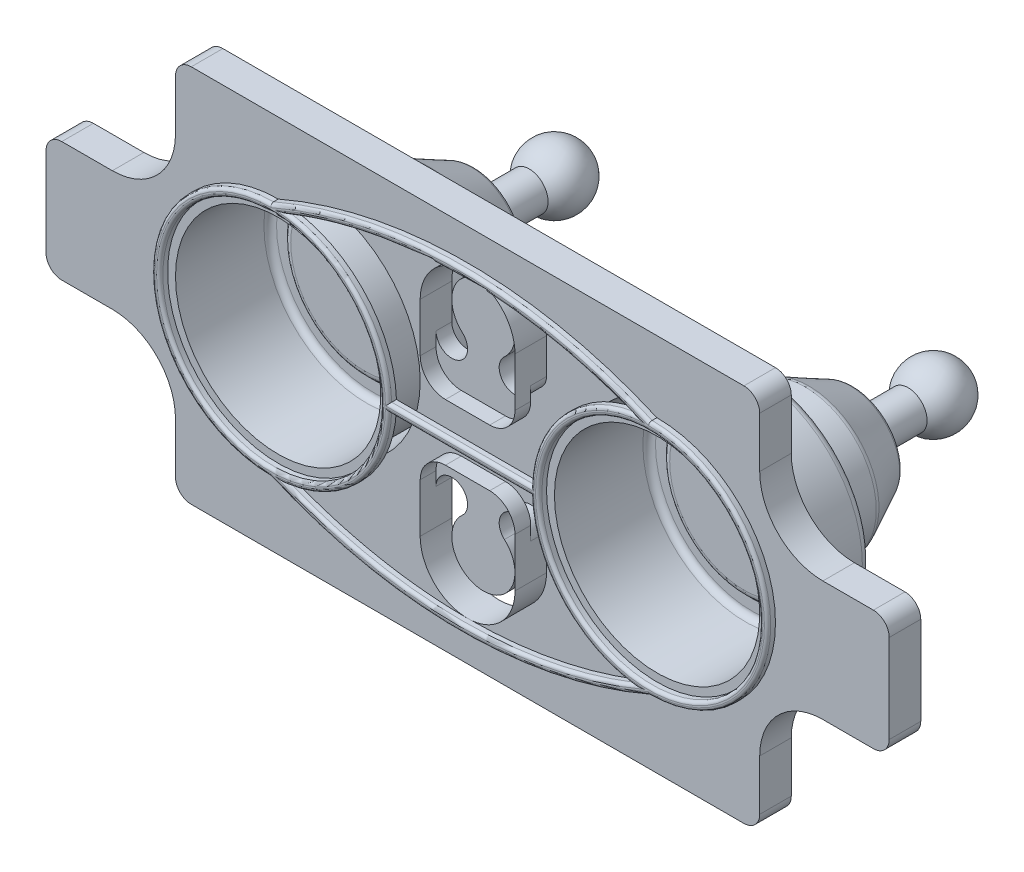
ISO-10303-21;
HEADER;
FILE_DESCRIPTION(('STEP AP214'),'2;1');
FILE_NAME('part.step','',(''),(''),'','','');
FILE_SCHEMA(('AUTOMOTIVE_DESIGN { 1 0 10303 214 1 1 1 1 }'));
ENDSEC;
DATA;
#1=APPLICATION_CONTEXT('core data for automotive mechanical design processes');
#2=APPLICATION_PROTOCOL_DEFINITION('international standard','automotive_design',2000,#1);
#3=PRODUCT_CONTEXT('',#1,'mechanical');
#4=PRODUCT('Part','Part','',(#3));
#5=PRODUCT_RELATED_PRODUCT_CATEGORY('part','',(#4));
#6=PRODUCT_DEFINITION_FORMATION('','',#4);
#7=PRODUCT_DEFINITION_CONTEXT('part definition',#1,'design');
#8=PRODUCT_DEFINITION('design','',#6,#7);
#9=PRODUCT_DEFINITION_SHAPE('','',#8);
#10=(LENGTH_UNIT() NAMED_UNIT(*) SI_UNIT(.MILLI.,.METRE.));
#11=(NAMED_UNIT(*) PLANE_ANGLE_UNIT() SI_UNIT($,.RADIAN.));
#12=(NAMED_UNIT(*) SI_UNIT($,.STERADIAN.) SOLID_ANGLE_UNIT());
#13=UNCERTAINTY_MEASURE_WITH_UNIT(LENGTH_MEASURE(1.E-05),#10,'distance_accuracy_value','');
#14=(GEOMETRIC_REPRESENTATION_CONTEXT(3) GLOBAL_UNCERTAINTY_ASSIGNED_CONTEXT((#13)) GLOBAL_UNIT_ASSIGNED_CONTEXT((#10,
#11,#12)) REPRESENTATION_CONTEXT('',''));
#15=CARTESIAN_POINT('',(0.,0.,0.));
#16=DIRECTION('',(0.,0.,1.));
#17=DIRECTION('',(1.,0.,0.));
#18=AXIS2_PLACEMENT_3D('',#15,#16,#17);
#19=CARTESIAN_POINT('',(-6.,0.,-2.25));
#20=DIRECTION('',(0.,0.,-1.));
#21=DIRECTION('',(-1.,0.,0.));
#22=AXIS2_PLACEMENT_3D('',#19,#20,#21);
#23=PLANE('',#22);
#24=CARTESIAN_POINT('',(-6.,0.,-2.25));
#25=DIRECTION('',(0.,0.,-1.));
#26=DIRECTION('',(-1.,0.,0.));
#27=AXIS2_PLACEMENT_3D('',#24,#25,#26);
#28=CIRCLE('',#27,2.5);
#29=CARTESIAN_POINT('',(-8.5,0.,-2.25));
#30=VERTEX_POINT('',#29);
#31=EDGE_CURVE('E11',#30,#30,#28,.F.);
#32=ORIENTED_EDGE('',*,*,#31,.T.);
#33=EDGE_LOOP('',(#32));
#34=FACE_BOUND('',#33,.T.);
#35=CARTESIAN_POINT('',(-6.,0.,-2.25));
#36=DIRECTION('',(0.,0.,-1.));
#37=DIRECTION('',(-1.,0.,0.));
#38=AXIS2_PLACEMENT_3D('',#35,#36,#37);
#39=CIRCLE('',#38,3.25);
#40=CARTESIAN_POINT('',(-9.25,0.,-2.25));
#41=VERTEX_POINT('',#40);
#42=EDGE_CURVE('E952',#41,#41,#39,.T.);
#43=ORIENTED_EDGE('',*,*,#42,.T.);
#44=EDGE_LOOP('',(#43));
#45=FACE_BOUND('',#44,.T.);
#46=ADVANCED_FACE('F33',(#34,#45),#23,.T.);
#47=CARTESIAN_POINT('',(6.,0.,-2.25));
#48=DIRECTION('',(0.,0.,-1.));
#49=DIRECTION('',(-1.,0.,0.));
#50=AXIS2_PLACEMENT_3D('',#47,#48,#49);
#51=PLANE('',#50);
#52=CARTESIAN_POINT('',(6.,0.,-2.25));
#53=DIRECTION('',(0.,0.,-1.));
#54=DIRECTION('',(-1.,0.,0.));
#55=AXIS2_PLACEMENT_3D('',#52,#53,#54);
#56=CIRCLE('',#55,2.5);
#57=CARTESIAN_POINT('',(3.5,0.,-2.25));
#58=VERTEX_POINT('',#57);
#59=EDGE_CURVE('E1030',#58,#58,#56,.F.);
#60=ORIENTED_EDGE('',*,*,#59,.T.);
#61=EDGE_LOOP('',(#60));
#62=FACE_BOUND('',#61,.T.);
#63=CARTESIAN_POINT('',(6.,0.,-2.25));
#64=DIRECTION('',(0.,0.,-1.));
#65=DIRECTION('',(-1.,0.,0.));
#66=AXIS2_PLACEMENT_3D('',#63,#64,#65);
#67=CIRCLE('',#66,3.25);
#68=CARTESIAN_POINT('',(2.75,0.,-2.25));
#69=VERTEX_POINT('',#68);
#70=EDGE_CURVE('E958',#69,#69,#67,.T.);
#71=ORIENTED_EDGE('',*,*,#70,.T.);
#72=EDGE_LOOP('',(#71));
#73=FACE_BOUND('',#72,.T.);
#74=ADVANCED_FACE('F1058',(#62,#73),#51,.T.);
#75=CARTESIAN_POINT('',(6.,0.,-2.));
#76=DIRECTION('',(0.,0.,-1.));
#77=DIRECTION('',(-1.,0.,0.));
#78=AXIS2_PLACEMENT_3D('',#75,#76,#77);
#79=PLANE('',#78);
#80=CARTESIAN_POINT('',(6.,0.,-2.));
#81=DIRECTION('',(0.,0.,-1.));
#82=DIRECTION('',(-1.,0.,0.));
#83=AXIS2_PLACEMENT_3D('',#80,#81,#82);
#84=CIRCLE('',#83,2.7);
#85=CARTESIAN_POINT('',(3.3,0.,-2.));
#86=VERTEX_POINT('',#85);
#87=EDGE_CURVE('E979',#86,#86,#84,.T.);
#88=ORIENTED_EDGE('',*,*,#87,.T.);
#89=EDGE_LOOP('',(#88));
#90=FACE_BOUND('',#89,.T.);
#91=CARTESIAN_POINT('',(6.,0.,-2.));
#92=DIRECTION('',(0.,0.,-1.));
#93=DIRECTION('',(-1.,0.,0.));
#94=AXIS2_PLACEMENT_3D('',#91,#92,#93);
#95=CIRCLE('',#94,3.05);
#96=CARTESIAN_POINT('',(2.95,0.,-2.));
#97=VERTEX_POINT('',#96);
#98=EDGE_CURVE('E967',#97,#97,#95,.F.);
#99=ORIENTED_EDGE('',*,*,#98,.T.);
#100=EDGE_LOOP('',(#99));
#101=FACE_BOUND('',#100,.T.);
#102=ADVANCED_FACE('F1064',(#90,#101),#79,.F.);
#103=CARTESIAN_POINT('',(-6.,0.,-2.));
#104=DIRECTION('',(0.,0.,-1.));
#105=DIRECTION('',(-1.,0.,0.));
#106=AXIS2_PLACEMENT_3D('',#103,#104,#105);
#107=PLANE('',#106);
#108=CARTESIAN_POINT('',(-6.,0.,-2.));
#109=DIRECTION('',(0.,0.,-1.));
#110=DIRECTION('',(-1.,0.,0.));
#111=AXIS2_PLACEMENT_3D('',#108,#109,#110);
#112=CIRCLE('',#111,2.7);
#113=CARTESIAN_POINT('',(-8.7,0.,-2.));
#114=VERTEX_POINT('',#113);
#115=EDGE_CURVE('E985',#114,#114,#112,.T.);
#116=ORIENTED_EDGE('',*,*,#115,.T.);
#117=EDGE_LOOP('',(#116));
#118=FACE_BOUND('',#117,.T.);
#119=CARTESIAN_POINT('',(-6.,0.,-2.));
#120=DIRECTION('',(0.,0.,-1.));
#121=DIRECTION('',(-1.,0.,0.));
#122=AXIS2_PLACEMENT_3D('',#119,#120,#121);
#123=CIRCLE('',#122,3.05);
#124=CARTESIAN_POINT('',(-9.05,0.,-2.));
#125=VERTEX_POINT('',#124);
#126=EDGE_CURVE('E973',#125,#125,#123,.F.);
#127=ORIENTED_EDGE('',*,*,#126,.T.);
#128=EDGE_LOOP('',(#127));
#129=FACE_BOUND('',#128,.T.);
#130=ADVANCED_FACE('F1070',(#118,#129),#107,.F.);
#131=CARTESIAN_POINT('',(-11.25,3.9,0.));
#132=DIRECTION('',(0.,0.,1.));
#133=DIRECTION('',(1.,0.,0.));
#134=AXIS2_PLACEMENT_3D('',#131,#132,#133);
#135=PLANE('',#134);
#136=CARTESIAN_POINT('',(6.,0.,0.));
#137=DIRECTION('',(0.,0.,1.));
#138=DIRECTION('',(1.,0.,0.));
#139=AXIS2_PLACEMENT_3D('',#136,#137,#138);
#140=CIRCLE('',#139,3.5);
#141=CARTESIAN_POINT('',(9.5,0.,0.));
#142=VERTEX_POINT('',#141);
#143=EDGE_CURVE('E946',#142,#142,#140,.F.);
#144=ORIENTED_EDGE('',*,*,#143,.F.);
#145=EDGE_LOOP('',(#144));
#146=FACE_BOUND('',#145,.T.);
#147=CARTESIAN_POINT('',(-1.,-2.1319660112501,0.));
#148=DIRECTION('',(0.,0.,1.));
#149=DIRECTION('',(1.,0.,0.));
#150=AXIS2_PLACEMENT_3D('',#147,#148,#149);
#151=CIRCLE('',#150,0.5);
#152=CARTESIAN_POINT('',(-0.666666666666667,-2.50464400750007,0.));
#153=VERTEX_POINT('',#152);
#154=CARTESIAN_POINT('',(-1.5,-2.1319660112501,0.));
#155=VERTEX_POINT('',#154);
#156=EDGE_CURVE('E526',#153,#155,#151,.T.);
#157=ORIENTED_EDGE('',*,*,#156,.T.);
#158=DIRECTION('',(0.,-1.,0.));
#159=VECTOR('',#158,1.);
#160=CARTESIAN_POINT('',(-1.5,-3.25,0.));
#161=LINE('',#160,#159);
#162=CARTESIAN_POINT('',(-1.5,-3.25,0.));
#163=VERTEX_POINT('',#162);
#164=EDGE_CURVE('E727',#155,#163,#161,.T.);
#165=ORIENTED_EDGE('',*,*,#164,.T.);
#166=CARTESIAN_POINT('',(0.,-3.25,0.));
#167=DIRECTION('',(0.,0.,1.));
#168=DIRECTION('',(1.,0.,0.));
#169=AXIS2_PLACEMENT_3D('',#166,#167,#168);
#170=CIRCLE('',#169,1.5);
#171=CARTESIAN_POINT('',(1.5,-3.25,0.));
#172=VERTEX_POINT('',#171);
#173=EDGE_CURVE('E737',#163,#172,#170,.T.);
#174=ORIENTED_EDGE('',*,*,#173,.T.);
#175=DIRECTION('',(0.,1.,0.));
#176=VECTOR('',#175,1.);
#177=CARTESIAN_POINT('',(1.5,-1.7,0.));
#178=LINE('',#177,#176);
#179=CARTESIAN_POINT('',(1.5,-2.1319660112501,0.));
#180=VERTEX_POINT('',#179);
#181=EDGE_CURVE('E733',#172,#180,#178,.T.);
#182=ORIENTED_EDGE('',*,*,#181,.T.);
#183=CARTESIAN_POINT('',(1.,-2.1319660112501,0.));
#184=DIRECTION('',(0.,0.,1.));
#185=DIRECTION('',(-1.,0.,0.));
#186=AXIS2_PLACEMENT_3D('',#183,#184,#185);
#187=CIRCLE('',#186,0.5);
#188=CARTESIAN_POINT('',(0.666666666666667,-2.50464400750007,0.));
#189=VERTEX_POINT('',#188);
#190=EDGE_CURVE('E520',#180,#189,#187,.T.);
#191=ORIENTED_EDGE('',*,*,#190,.T.);
#192=CARTESIAN_POINT('',(0.,-3.25,0.));
#193=DIRECTION('',(0.,0.,-1.));
#194=DIRECTION('',(-1.,0.,0.));
#195=AXIS2_PLACEMENT_3D('',#192,#193,#194);
#196=CIRCLE('',#195,1.);
#197=EDGE_CURVE('E523',#189,#153,#196,.T.);
#198=ORIENTED_EDGE('',*,*,#197,.T.);
#199=EDGE_LOOP('',(#157,#165,#174,#182,#191,#198));
#200=FACE_BOUND('',#199,.T.);
#201=DIRECTION('',(0.,-1.,0.));
#202=VECTOR('',#201,1.);
#203=CARTESIAN_POINT('',(-1.5,3.25,0.));
#204=LINE('',#203,#202);
#205=CARTESIAN_POINT('',(-1.5,3.25,0.));
#206=VERTEX_POINT('',#205);
#207=CARTESIAN_POINT('',(-1.5,2.1319660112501,0.));
#208=VERTEX_POINT('',#207);
#209=EDGE_CURVE('E728',#206,#208,#204,.T.);
#210=ORIENTED_EDGE('',*,*,#209,.T.);
#211=CARTESIAN_POINT('',(-1.,2.1319660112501,0.));
#212=DIRECTION('',(0.,0.,1.));
#213=DIRECTION('',(-1.,0.,0.));
#214=AXIS2_PLACEMENT_3D('',#211,#212,#213);
#215=CIRCLE('',#214,0.5);
#216=CARTESIAN_POINT('',(-0.666666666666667,2.50464400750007,0.));
#217=VERTEX_POINT('',#216);
#218=EDGE_CURVE('E564',#208,#217,#215,.T.);
#219=ORIENTED_EDGE('',*,*,#218,.T.);
#220=CARTESIAN_POINT('',(0.,3.25,0.));
#221=DIRECTION('',(0.,0.,-1.));
#222=DIRECTION('',(1.,0.,0.));
#223=AXIS2_PLACEMENT_3D('',#220,#221,#222);
#224=CIRCLE('',#223,1.);
#225=CARTESIAN_POINT('',(0.666666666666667,2.50464400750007,0.));
#226=VERTEX_POINT('',#225);
#227=EDGE_CURVE('E567',#217,#226,#224,.T.);
#228=ORIENTED_EDGE('',*,*,#227,.T.);
#229=CARTESIAN_POINT('',(1.,2.1319660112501,0.));
#230=DIRECTION('',(0.,0.,1.));
#231=DIRECTION('',(1.,0.,0.));
#232=AXIS2_PLACEMENT_3D('',#229,#230,#231);
#233=CIRCLE('',#232,0.5);
#234=CARTESIAN_POINT('',(1.5,2.1319660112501,0.));
#235=VERTEX_POINT('',#234);
#236=EDGE_CURVE('E556',#226,#235,#233,.T.);
#237=ORIENTED_EDGE('',*,*,#236,.T.);
#238=DIRECTION('',(0.,1.,0.));
#239=VECTOR('',#238,1.);
#240=CARTESIAN_POINT('',(1.5,1.7,0.));
#241=LINE('',#240,#239);
#242=CARTESIAN_POINT('',(1.5,3.25,0.));
#243=VERTEX_POINT('',#242);
#244=EDGE_CURVE('E725',#235,#243,#241,.T.);
#245=ORIENTED_EDGE('',*,*,#244,.T.);
#246=CARTESIAN_POINT('',(0.,3.25,0.));
#247=DIRECTION('',(0.,0.,1.));
#248=DIRECTION('',(-1.,0.,0.));
#249=AXIS2_PLACEMENT_3D('',#246,#247,#248);
#250=CIRCLE('',#249,1.5);
#251=EDGE_CURVE('E597',#243,#206,#250,.T.);
#252=ORIENTED_EDGE('',*,*,#251,.T.);
#253=EDGE_LOOP('',(#210,#219,#228,#237,#245,#252));
#254=FACE_BOUND('',#253,.T.);
#255=CARTESIAN_POINT('',(-11.25,3.9,0.));
#256=DIRECTION('',(0.,0.,-1.));
#257=DIRECTION('',(1.,0.,0.));
#258=AXIS2_PLACEMENT_3D('',#255,#256,#257);
#259=CIRCLE('',#258,2.);
#260=CARTESIAN_POINT('',(-9.25,3.90000000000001,0.));
#261=VERTEX_POINT('',#260);
#262=CARTESIAN_POINT('',(-11.25,1.9,0.));
#263=VERTEX_POINT('',#262);
#264=EDGE_CURVE('E720',#261,#263,#259,.T.);
#265=ORIENTED_EDGE('',*,*,#264,.F.);
#266=DIRECTION('',(0.,-1.,0.));
#267=VECTOR('',#266,1.);
#268=CARTESIAN_POINT('',(-9.25,5.5,0.));
#269=LINE('',#268,#267);
#270=CARTESIAN_POINT('',(-9.25,5.5,0.));
#271=VERTEX_POINT('',#270);
#272=EDGE_CURVE('E605',#271,#261,#269,.T.);
#273=ORIENTED_EDGE('',*,*,#272,.F.);
#274=CARTESIAN_POINT('',(-8.75,5.5,0.));
#275=DIRECTION('',(0.,0.,1.));
#276=DIRECTION('',(1.,0.,0.));
#277=AXIS2_PLACEMENT_3D('',#274,#275,#276);
#278=CIRCLE('',#277,0.5);
#279=CARTESIAN_POINT('',(-8.75,6.,0.));
#280=VERTEX_POINT('',#279);
#281=EDGE_CURVE('E610',#280,#271,#278,.T.);
#282=ORIENTED_EDGE('',*,*,#281,.F.);
#283=DIRECTION('',(-1.,0.,0.));
#284=VECTOR('',#283,1.);
#285=CARTESIAN_POINT('',(-8.75,6.,0.));
#286=LINE('',#285,#284);
#287=CARTESIAN_POINT('',(8.75,6.,0.));
#288=VERTEX_POINT('',#287);
#289=EDGE_CURVE('E615',#288,#280,#286,.T.);
#290=ORIENTED_EDGE('',*,*,#289,.F.);
#291=CARTESIAN_POINT('',(8.75,5.5,0.));
#292=DIRECTION('',(0.,0.,1.));
#293=DIRECTION('',(-1.,0.,0.));
#294=AXIS2_PLACEMENT_3D('',#291,#292,#293);
#295=CIRCLE('',#294,0.5);
#296=CARTESIAN_POINT('',(9.25,5.5,0.));
#297=VERTEX_POINT('',#296);
#298=EDGE_CURVE('E620',#297,#288,#295,.T.);
#299=ORIENTED_EDGE('',*,*,#298,.F.);
#300=DIRECTION('',(0.,1.,0.));
#301=VECTOR('',#300,1.);
#302=CARTESIAN_POINT('',(9.25,3.90000000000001,0.));
#303=LINE('',#302,#301);
#304=CARTESIAN_POINT('',(9.25,3.90000000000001,0.));
#305=VERTEX_POINT('',#304);
#306=EDGE_CURVE('E625',#305,#297,#303,.T.);
#307=ORIENTED_EDGE('',*,*,#306,.F.);
#308=CARTESIAN_POINT('',(11.25,3.9,0.));
#309=DIRECTION('',(0.,0.,-1.));
#310=DIRECTION('',(1.,0.,0.));
#311=AXIS2_PLACEMENT_3D('',#308,#309,#310);
#312=CIRCLE('',#311,2.);
#313=CARTESIAN_POINT('',(11.25,1.9,0.));
#314=VERTEX_POINT('',#313);
#315=EDGE_CURVE('E630',#314,#305,#312,.T.);
#316=ORIENTED_EDGE('',*,*,#315,.F.);
#317=DIRECTION('',(-1.,0.,0.));
#318=VECTOR('',#317,1.);
#319=CARTESIAN_POINT('',(12.85,1.9,0.));
#320=LINE('',#319,#318);
#321=CARTESIAN_POINT('',(12.85,1.9,0.));
#322=VERTEX_POINT('',#321);
#323=EDGE_CURVE('E635',#322,#314,#320,.T.);
#324=ORIENTED_EDGE('',*,*,#323,.F.);
#325=CARTESIAN_POINT('',(12.85,1.4,0.));
#326=DIRECTION('',(0.,0.,1.));
#327=DIRECTION('',(-1.,0.,0.));
#328=AXIS2_PLACEMENT_3D('',#325,#326,#327);
#329=CIRCLE('',#328,0.499999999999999);
#330=CARTESIAN_POINT('',(13.35,1.4,0.));
#331=VERTEX_POINT('',#330);
#332=EDGE_CURVE('E640',#331,#322,#329,.T.);
#333=ORIENTED_EDGE('',*,*,#332,.F.);
#334=DIRECTION('',(0.,1.,0.));
#335=VECTOR('',#334,1.);
#336=CARTESIAN_POINT('',(13.35,-1.4,0.));
#337=LINE('',#336,#335);
#338=CARTESIAN_POINT('',(13.35,-1.4,0.));
#339=VERTEX_POINT('',#338);
#340=EDGE_CURVE('E645',#339,#331,#337,.T.);
#341=ORIENTED_EDGE('',*,*,#340,.F.);
#342=CARTESIAN_POINT('',(12.85,-1.4,0.));
#343=DIRECTION('',(0.,0.,1.));
#344=DIRECTION('',(-1.,0.,0.));
#345=AXIS2_PLACEMENT_3D('',#342,#343,#344);
#346=CIRCLE('',#345,0.499999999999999);
#347=CARTESIAN_POINT('',(12.85,-1.9,0.));
#348=VERTEX_POINT('',#347);
#349=EDGE_CURVE('E650',#348,#339,#346,.T.);
#350=ORIENTED_EDGE('',*,*,#349,.F.);
#351=DIRECTION('',(1.,0.,0.));
#352=VECTOR('',#351,1.);
#353=CARTESIAN_POINT('',(11.25,-1.9,0.));
#354=LINE('',#353,#352);
#355=CARTESIAN_POINT('',(11.25,-1.9,0.));
#356=VERTEX_POINT('',#355);
#357=EDGE_CURVE('E655',#356,#348,#354,.T.);
#358=ORIENTED_EDGE('',*,*,#357,.F.);
#359=CARTESIAN_POINT('',(11.25,-3.9,0.));
#360=DIRECTION('',(0.,0.,-1.));
#361=DIRECTION('',(1.,0.,0.));
#362=AXIS2_PLACEMENT_3D('',#359,#360,#361);
#363=CIRCLE('',#362,2.);
#364=CARTESIAN_POINT('',(9.25,-3.90000000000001,0.));
#365=VERTEX_POINT('',#364);
#366=EDGE_CURVE('E660',#365,#356,#363,.T.);
#367=ORIENTED_EDGE('',*,*,#366,.F.);
#368=DIRECTION('',(0.,1.,0.));
#369=VECTOR('',#368,1.);
#370=CARTESIAN_POINT('',(9.25,-5.49999999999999,0.));
#371=LINE('',#370,#369);
#372=CARTESIAN_POINT('',(9.25,-5.49999999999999,0.));
#373=VERTEX_POINT('',#372);
#374=EDGE_CURVE('E665',#373,#365,#371,.T.);
#375=ORIENTED_EDGE('',*,*,#374,.F.);
#376=CARTESIAN_POINT('',(8.75,-5.49999999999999,0.));
#377=DIRECTION('',(0.,0.,1.));
#378=DIRECTION('',(-1.,0.,0.));
#379=AXIS2_PLACEMENT_3D('',#376,#377,#378);
#380=CIRCLE('',#379,0.5);
#381=CARTESIAN_POINT('',(8.75,-5.99999999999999,0.));
#382=VERTEX_POINT('',#381);
#383=EDGE_CURVE('E670',#382,#373,#380,.T.);
#384=ORIENTED_EDGE('',*,*,#383,.F.);
#385=DIRECTION('',(1.,0.,0.));
#386=VECTOR('',#385,1.);
#387=CARTESIAN_POINT('',(8.75,-5.99999999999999,0.));
#388=LINE('',#387,#386);
#389=CARTESIAN_POINT('',(-8.74999999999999,-5.99999999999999,0.));
#390=VERTEX_POINT('',#389);
#391=EDGE_CURVE('E675',#390,#382,#388,.T.);
#392=ORIENTED_EDGE('',*,*,#391,.F.);
#393=CARTESIAN_POINT('',(-8.75,-5.49999999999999,0.));
#394=DIRECTION('',(0.,0.,1.));
#395=DIRECTION('',(-1.,0.,0.));
#396=AXIS2_PLACEMENT_3D('',#393,#394,#395);
#397=CIRCLE('',#396,0.499999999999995);
#398=CARTESIAN_POINT('',(-9.24999999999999,-5.5,0.));
#399=VERTEX_POINT('',#398);
#400=EDGE_CURVE('E680',#399,#390,#397,.T.);
#401=ORIENTED_EDGE('',*,*,#400,.F.);
#402=DIRECTION('',(0.,-1.,0.));
#403=VECTOR('',#402,1.);
#404=CARTESIAN_POINT('',(-9.25,-3.90000000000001,0.));
#405=LINE('',#404,#403);
#406=CARTESIAN_POINT('',(-9.25,-3.90000000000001,0.));
#407=VERTEX_POINT('',#406);
#408=EDGE_CURVE('E685',#407,#399,#405,.T.);
#409=ORIENTED_EDGE('',*,*,#408,.F.);
#410=CARTESIAN_POINT('',(-11.25,-3.9,0.));
#411=DIRECTION('',(0.,0.,-1.));
#412=DIRECTION('',(1.,0.,0.));
#413=AXIS2_PLACEMENT_3D('',#410,#411,#412);
#414=CIRCLE('',#413,2.);
#415=CARTESIAN_POINT('',(-11.25,-1.9,0.));
#416=VERTEX_POINT('',#415);
#417=EDGE_CURVE('E690',#416,#407,#414,.T.);
#418=ORIENTED_EDGE('',*,*,#417,.F.);
#419=DIRECTION('',(1.,0.,0.));
#420=VECTOR('',#419,1.);
#421=CARTESIAN_POINT('',(-12.85,-1.9,0.));
#422=LINE('',#421,#420);
#423=CARTESIAN_POINT('',(-12.85,-1.9,0.));
#424=VERTEX_POINT('',#423);
#425=EDGE_CURVE('E695',#424,#416,#422,.T.);
#426=ORIENTED_EDGE('',*,*,#425,.F.);
#427=CARTESIAN_POINT('',(-12.85,-1.4,0.));
#428=DIRECTION('',(0.,0.,1.));
#429=DIRECTION('',(-1.,0.,0.));
#430=AXIS2_PLACEMENT_3D('',#427,#428,#429);
#431=CIRCLE('',#430,0.5);
#432=CARTESIAN_POINT('',(-13.35,-1.4,0.));
#433=VERTEX_POINT('',#432);
#434=EDGE_CURVE('E700',#433,#424,#431,.T.);
#435=ORIENTED_EDGE('',*,*,#434,.F.);
#436=DIRECTION('',(0.,-1.,0.));
#437=VECTOR('',#436,1.);
#438=CARTESIAN_POINT('',(-13.35,1.4,0.));
#439=LINE('',#438,#437);
#440=CARTESIAN_POINT('',(-13.35,1.4,0.));
#441=VERTEX_POINT('',#440);
#442=EDGE_CURVE('E705',#441,#433,#439,.T.);
#443=ORIENTED_EDGE('',*,*,#442,.F.);
#444=CARTESIAN_POINT('',(-12.85,1.4,0.));
#445=DIRECTION('',(0.,0.,1.));
#446=DIRECTION('',(1.,0.,0.));
#447=AXIS2_PLACEMENT_3D('',#444,#445,#446);
#448=CIRCLE('',#447,0.5);
#449=CARTESIAN_POINT('',(-12.85,1.9,0.));
#450=VERTEX_POINT('',#449);
#451=EDGE_CURVE('E710',#450,#441,#448,.T.);
#452=ORIENTED_EDGE('',*,*,#451,.F.);
#453=DIRECTION('',(-1.,0.,0.));
#454=VECTOR('',#453,1.);
#455=CARTESIAN_POINT('',(-11.25,1.9,0.));
#456=LINE('',#455,#454);
#457=EDGE_CURVE('E715',#263,#450,#456,.T.);
#458=ORIENTED_EDGE('',*,*,#457,.F.);
#459=EDGE_LOOP('',(#265,#273,#282,#290,#299,#307,#316,#324,#333,#341,#350,#358,#367,#375,#384,
#392,#401,#409,#418,#426,#435,#443,#452,#458));
#460=FACE_BOUND('',#459,.T.);
#461=CARTESIAN_POINT('',(-6.,0.,0.));
#462=DIRECTION('',(0.,0.,1.));
#463=DIRECTION('',(1.,0.,0.));
#464=AXIS2_PLACEMENT_3D('',#461,#462,#463);
#465=CIRCLE('',#464,3.5);
#466=CARTESIAN_POINT('',(-2.5,0.,0.));
#467=VERTEX_POINT('',#466);
#468=EDGE_CURVE('E949',#467,#467,#465,.F.);
#469=ORIENTED_EDGE('',*,*,#468,.F.);
#470=EDGE_LOOP('',(#469));
#471=FACE_BOUND('',#470,.T.);
#472=ADVANCED_FACE('F1282',(#146,#200,#254,#460,#471),#135,.F.);
#473=CARTESIAN_POINT('',(-11.35,4.,1.));
#474=DIRECTION('',(0.,0.,-1.));
#475=DIRECTION('',(-1.,0.,0.));
#476=AXIS2_PLACEMENT_3D('',#473,#474,#475);
#477=PLANE('',#476);
#478=DIRECTION('',(1.,0.,0.));
#479=VECTOR('',#478,1.);
#480=CARTESIAN_POINT('',(-11.25,1.9,1.));
#481=LINE('',#480,#479);
#482=CARTESIAN_POINT('',(-12.85,1.9,1.));
#483=VERTEX_POINT('',#482);
#484=CARTESIAN_POINT('',(-11.25,1.9,1.));
#485=VERTEX_POINT('',#484);
#486=EDGE_CURVE('E723',#483,#485,#481,.T.);
#487=ORIENTED_EDGE('',*,*,#486,.F.);
#488=CARTESIAN_POINT('',(-12.85,1.4,1.));
#489=DIRECTION('',(0.,0.,-1.));
#490=DIRECTION('',(-1.,0.,0.));
#491=AXIS2_PLACEMENT_3D('',#488,#489,#490);
#492=CIRCLE('',#491,0.5);
#493=CARTESIAN_POINT('',(-13.35,1.4,1.));
#494=VERTEX_POINT('',#493);
#495=EDGE_CURVE('E718',#494,#483,#492,.T.);
#496=ORIENTED_EDGE('',*,*,#495,.F.);
#497=DIRECTION('',(0.,1.,0.));
#498=VECTOR('',#497,1.);
#499=CARTESIAN_POINT('',(-13.35,1.4,1.));
#500=LINE('',#499,#498);
#501=CARTESIAN_POINT('',(-13.35,-1.4,1.));
#502=VERTEX_POINT('',#501);
#503=EDGE_CURVE('E713',#502,#494,#500,.T.);
#504=ORIENTED_EDGE('',*,*,#503,.F.);
#505=CARTESIAN_POINT('',(-12.85,-1.4,1.));
#506=DIRECTION('',(0.,0.,-1.));
#507=DIRECTION('',(-1.,0.,0.));
#508=AXIS2_PLACEMENT_3D('',#505,#506,#507);
#509=CIRCLE('',#508,0.5);
#510=CARTESIAN_POINT('',(-12.85,-1.9,1.));
#511=VERTEX_POINT('',#510);
#512=EDGE_CURVE('E708',#511,#502,#509,.T.);
#513=ORIENTED_EDGE('',*,*,#512,.F.);
#514=DIRECTION('',(-1.,0.,0.));
#515=VECTOR('',#514,1.);
#516=CARTESIAN_POINT('',(-12.85,-1.9,1.));
#517=LINE('',#516,#515);
#518=CARTESIAN_POINT('',(-11.25,-1.9,1.));
#519=VERTEX_POINT('',#518);
#520=EDGE_CURVE('E703',#519,#511,#517,.T.);
#521=ORIENTED_EDGE('',*,*,#520,.F.);
#522=CARTESIAN_POINT('',(-11.25,-3.9,1.));
#523=DIRECTION('',(0.,0.,-1.));
#524=DIRECTION('',(-1.,0.,0.));
#525=AXIS2_PLACEMENT_3D('',#522,#523,#524);
#526=CIRCLE('',#525,2.);
#527=CARTESIAN_POINT('',(-9.25,-3.90000000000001,1.));
#528=VERTEX_POINT('',#527);
#529=EDGE_CURVE('E698',#528,#519,#526,.F.);
#530=ORIENTED_EDGE('',*,*,#529,.F.);
#531=DIRECTION('',(0.,1.,0.));
#532=VECTOR('',#531,1.);
#533=CARTESIAN_POINT('',(-9.25,-3.90000000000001,1.));
#534=LINE('',#533,#532);
#535=CARTESIAN_POINT('',(-9.25,-5.49999999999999,1.));
#536=VERTEX_POINT('',#535);
#537=EDGE_CURVE('E693',#536,#528,#534,.T.);
#538=ORIENTED_EDGE('',*,*,#537,.F.);
#539=CARTESIAN_POINT('',(-8.75,-5.49999999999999,1.));
#540=DIRECTION('',(0.,0.,-1.));
#541=DIRECTION('',(-1.,0.,0.));
#542=AXIS2_PLACEMENT_3D('',#539,#540,#541);
#543=CIRCLE('',#542,0.499999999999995);
#544=CARTESIAN_POINT('',(-8.74999999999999,-6.,1.));
#545=VERTEX_POINT('',#544);
#546=EDGE_CURVE('E688',#545,#536,#543,.T.);
#547=ORIENTED_EDGE('',*,*,#546,.F.);
#548=DIRECTION('',(-1.,0.,0.));
#549=VECTOR('',#548,1.);
#550=CARTESIAN_POINT('',(8.75,-5.99999999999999,1.));
#551=LINE('',#550,#549);
#552=CARTESIAN_POINT('',(8.75,-5.99999999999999,1.));
#553=VERTEX_POINT('',#552);
#554=EDGE_CURVE('E683',#553,#545,#551,.T.);
#555=ORIENTED_EDGE('',*,*,#554,.F.);
#556=CARTESIAN_POINT('',(8.75,-5.49999999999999,1.));
#557=DIRECTION('',(0.,0.,-1.));
#558=DIRECTION('',(-1.,0.,0.));
#559=AXIS2_PLACEMENT_3D('',#556,#557,#558);
#560=CIRCLE('',#559,0.5);
#561=CARTESIAN_POINT('',(9.25,-5.49999999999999,1.));
#562=VERTEX_POINT('',#561);
#563=EDGE_CURVE('E678',#562,#553,#560,.T.);
#564=ORIENTED_EDGE('',*,*,#563,.F.);
#565=DIRECTION('',(0.,-1.,0.));
#566=VECTOR('',#565,1.);
#567=CARTESIAN_POINT('',(9.25,-5.49999999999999,1.));
#568=LINE('',#567,#566);
#569=CARTESIAN_POINT('',(9.25,-3.9,1.));
#570=VERTEX_POINT('',#569);
#571=EDGE_CURVE('E673',#570,#562,#568,.T.);
#572=ORIENTED_EDGE('',*,*,#571,.F.);
#573=CARTESIAN_POINT('',(11.25,-3.9,1.));
#574=DIRECTION('',(0.,0.,-1.));
#575=DIRECTION('',(-1.,0.,0.));
#576=AXIS2_PLACEMENT_3D('',#573,#574,#575);
#577=CIRCLE('',#576,2.);
#578=CARTESIAN_POINT('',(11.25,-1.9,1.));
#579=VERTEX_POINT('',#578);
#580=EDGE_CURVE('E668',#579,#570,#577,.F.);
#581=ORIENTED_EDGE('',*,*,#580,.F.);
#582=DIRECTION('',(-1.,0.,0.));
#583=VECTOR('',#582,1.);
#584=CARTESIAN_POINT('',(11.25,-1.9,1.));
#585=LINE('',#584,#583);
#586=CARTESIAN_POINT('',(12.85,-1.9,1.));
#587=VERTEX_POINT('',#586);
#588=EDGE_CURVE('E663',#587,#579,#585,.T.);
#589=ORIENTED_EDGE('',*,*,#588,.F.);
#590=CARTESIAN_POINT('',(12.85,-1.4,1.));
#591=DIRECTION('',(0.,0.,-1.));
#592=DIRECTION('',(-1.,0.,0.));
#593=AXIS2_PLACEMENT_3D('',#590,#591,#592);
#594=CIRCLE('',#593,0.499999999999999);
#595=CARTESIAN_POINT('',(13.35,-1.4,1.));
#596=VERTEX_POINT('',#595);
#597=EDGE_CURVE('E658',#596,#587,#594,.T.);
#598=ORIENTED_EDGE('',*,*,#597,.F.);
#599=DIRECTION('',(0.,-1.,0.));
#600=VECTOR('',#599,1.);
#601=CARTESIAN_POINT('',(13.35,-1.4,1.));
#602=LINE('',#601,#600);
#603=CARTESIAN_POINT('',(13.35,1.4,1.));
#604=VERTEX_POINT('',#603);
#605=EDGE_CURVE('E653',#604,#596,#602,.T.);
#606=ORIENTED_EDGE('',*,*,#605,.F.);
#607=CARTESIAN_POINT('',(12.85,1.4,1.));
#608=DIRECTION('',(0.,0.,-1.));
#609=DIRECTION('',(-1.,0.,0.));
#610=AXIS2_PLACEMENT_3D('',#607,#608,#609);
#611=CIRCLE('',#610,0.499999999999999);
#612=CARTESIAN_POINT('',(12.85,1.9,1.));
#613=VERTEX_POINT('',#612);
#614=EDGE_CURVE('E648',#613,#604,#611,.T.);
#615=ORIENTED_EDGE('',*,*,#614,.F.);
#616=DIRECTION('',(1.,0.,0.));
#617=VECTOR('',#616,1.);
#618=CARTESIAN_POINT('',(12.85,1.9,1.));
#619=LINE('',#618,#617);
#620=CARTESIAN_POINT('',(11.25,1.9,1.));
#621=VERTEX_POINT('',#620);
#622=EDGE_CURVE('E643',#621,#613,#619,.T.);
#623=ORIENTED_EDGE('',*,*,#622,.F.);
#624=CARTESIAN_POINT('',(11.25,3.9,1.));
#625=DIRECTION('',(0.,0.,-1.));
#626=DIRECTION('',(-1.,0.,0.));
#627=AXIS2_PLACEMENT_3D('',#624,#625,#626);
#628=CIRCLE('',#627,2.);
#629=CARTESIAN_POINT('',(9.25,3.90000000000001,1.));
#630=VERTEX_POINT('',#629);
#631=EDGE_CURVE('E638',#630,#621,#628,.F.);
#632=ORIENTED_EDGE('',*,*,#631,.F.);
#633=DIRECTION('',(0.,-1.,0.));
#634=VECTOR('',#633,1.);
#635=CARTESIAN_POINT('',(9.25,3.90000000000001,1.));
#636=LINE('',#635,#634);
#637=CARTESIAN_POINT('',(9.25,5.5,1.));
#638=VERTEX_POINT('',#637);
#639=EDGE_CURVE('E633',#638,#630,#636,.T.);
#640=ORIENTED_EDGE('',*,*,#639,.F.);
#641=CARTESIAN_POINT('',(8.75,5.5,1.));
#642=DIRECTION('',(0.,0.,-1.));
#643=DIRECTION('',(-1.,0.,0.));
#644=AXIS2_PLACEMENT_3D('',#641,#642,#643);
#645=CIRCLE('',#644,0.5);
#646=CARTESIAN_POINT('',(8.74999999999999,6.,1.));
#647=VERTEX_POINT('',#646);
#648=EDGE_CURVE('E628',#647,#638,#645,.T.);
#649=ORIENTED_EDGE('',*,*,#648,.F.);
#650=DIRECTION('',(1.,0.,0.));
#651=VECTOR('',#650,1.);
#652=CARTESIAN_POINT('',(-8.75,6.,1.));
#653=LINE('',#652,#651);
#654=CARTESIAN_POINT('',(-8.75,6.,1.));
#655=VERTEX_POINT('',#654);
#656=EDGE_CURVE('E623',#655,#647,#653,.T.);
#657=ORIENTED_EDGE('',*,*,#656,.F.);
#658=CARTESIAN_POINT('',(-8.75,5.5,1.));
#659=DIRECTION('',(0.,0.,-1.));
#660=DIRECTION('',(-1.,0.,0.));
#661=AXIS2_PLACEMENT_3D('',#658,#659,#660);
#662=CIRCLE('',#661,0.5);
#663=CARTESIAN_POINT('',(-9.25,5.5,1.));
#664=VERTEX_POINT('',#663);
#665=EDGE_CURVE('E618',#664,#655,#662,.T.);
#666=ORIENTED_EDGE('',*,*,#665,.F.);
#667=DIRECTION('',(0.,1.,0.));
#668=VECTOR('',#667,1.);
#669=CARTESIAN_POINT('',(-9.25,5.5,1.));
#670=LINE('',#669,#668);
#671=CARTESIAN_POINT('',(-9.25,3.90000000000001,1.));
#672=VERTEX_POINT('',#671);
#673=EDGE_CURVE('E613',#672,#664,#670,.T.);
#674=ORIENTED_EDGE('',*,*,#673,.F.);
#675=CARTESIAN_POINT('',(-11.25,3.9,1.));
#676=DIRECTION('',(0.,0.,-1.));
#677=DIRECTION('',(-1.,0.,0.));
#678=AXIS2_PLACEMENT_3D('',#675,#676,#677);
#679=CIRCLE('',#678,2.);
#680=EDGE_CURVE('E736',#485,#672,#679,.F.);
#681=ORIENTED_EDGE('',*,*,#680,.F.);
#682=EDGE_LOOP('',(#487,#496,#504,#513,#521,#530,#538,#547,#555,#564,#572,#581,#589,#598,#606,
#615,#623,#632,#640,#649,#657,#666,#674,#681));
#683=FACE_BOUND('',#682,.T.);
#684=CARTESIAN_POINT('',(-6.,0.,1.));
#685=DIRECTION('',(0.,0.,1.));
#686=DIRECTION('',(1.,0.,0.));
#687=AXIS2_PLACEMENT_3D('',#684,#685,#686);
#688=CIRCLE('',#687,3.75);
#689=CARTESIAN_POINT('',(-5.9947976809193,3.74999639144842,1.));
#690=VERTEX_POINT('',#689);
#691=CARTESIAN_POINT('',(-5.99479768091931,-3.74999639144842,1.));
#692=VERTEX_POINT('',#691);
#693=EDGE_CURVE('E500',#690,#692,#688,.T.);
#694=ORIENTED_EDGE('',*,*,#693,.F.);
#695=CARTESIAN_POINT('',(0.,-10.,1.));
#696=DIRECTION('',(0.,0.,1.));
#697=DIRECTION('',(-1.,0.,0.));
#698=AXIS2_PLACEMENT_3D('',#695,#696,#697);
#699=CIRCLE('',#698,15.);
#700=CARTESIAN_POINT('',(5.9947976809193,3.74999639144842,1.));
#701=VERTEX_POINT('',#700);
#702=EDGE_CURVE('E509',#701,#690,#699,.T.);
#703=ORIENTED_EDGE('',*,*,#702,.F.);
#704=CARTESIAN_POINT('',(6.,0.,1.));
#705=DIRECTION('',(0.,0.,1.));
#706=DIRECTION('',(-1.,0.,0.));
#707=AXIS2_PLACEMENT_3D('',#704,#705,#706);
#708=CIRCLE('',#707,3.75);
#709=CARTESIAN_POINT('',(5.9947976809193,-3.74999639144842,1.));
#710=VERTEX_POINT('',#709);
#711=EDGE_CURVE('E506',#710,#701,#708,.T.);
#712=ORIENTED_EDGE('',*,*,#711,.F.);
#713=CARTESIAN_POINT('',(0.,10.,1.));
#714=DIRECTION('',(0.,0.,1.));
#715=DIRECTION('',(1.,0.,0.));
#716=AXIS2_PLACEMENT_3D('',#713,#714,#715);
#717=CIRCLE('',#716,15.);
#718=EDGE_CURVE('E503',#692,#710,#717,.T.);
#719=ORIENTED_EDGE('',*,*,#718,.F.);
#720=EDGE_LOOP('',(#694,#703,#712,#719));
#721=FACE_BOUND('',#720,.T.);
#722=ADVANCED_FACE('F1285',(#683,#721),#477,.F.);
#723=CARTESIAN_POINT('',(-6.,0.,1.));
#724=DIRECTION('',(0.,0.,1.));
#725=DIRECTION('',(1.,0.,0.));
#726=AXIS2_PLACEMENT_3D('',#723,#724,#725);
#727=CIRCLE('',#726,3.5);
#728=CARTESIAN_POINT('',(-2.5,0.,1.));
#729=VERTEX_POINT('',#728);
#730=EDGE_CURVE('E497',#729,#729,#727,.T.);
#731=ORIENTED_EDGE('',*,*,#730,.T.);
#732=EDGE_LOOP('',(#731));
#733=FACE_BOUND('',#732,.T.);
#734=CARTESIAN_POINT('',(-6.,0.,1.));
#735=DIRECTION('',(0.,0.,-1.));
#736=DIRECTION('',(-1.,0.,0.));
#737=AXIS2_PLACEMENT_3D('',#734,#735,#736);
#738=CIRCLE('',#737,3.25);
#739=CARTESIAN_POINT('',(-9.25,0.,1.));
#740=VERTEX_POINT('',#739);
#741=EDGE_CURVE('E850',#740,#740,#738,.T.);
#742=ORIENTED_EDGE('',*,*,#741,.T.);
#743=EDGE_LOOP('',(#742));
#744=FACE_BOUND('',#743,.T.);
#745=ADVANCED_FACE('F1521',(#733,#744),#477,.F.);
#746=CARTESIAN_POINT('',(6.,0.,1.));
#747=DIRECTION('',(0.,0.,1.));
#748=DIRECTION('',(-1.,0.,0.));
#749=AXIS2_PLACEMENT_3D('',#746,#747,#748);
#750=CIRCLE('',#749,3.5);
#751=CARTESIAN_POINT('',(2.5,0.,1.));
#752=VERTEX_POINT('',#751);
#753=EDGE_CURVE('E494',#752,#752,#750,.T.);
#754=ORIENTED_EDGE('',*,*,#753,.T.);
#755=EDGE_LOOP('',(#754));
#756=FACE_BOUND('',#755,.T.);
#757=CARTESIAN_POINT('',(6.,0.,1.));
#758=DIRECTION('',(0.,0.,-1.));
#759=DIRECTION('',(-1.,0.,0.));
#760=AXIS2_PLACEMENT_3D('',#757,#758,#759);
#761=CIRCLE('',#760,3.25);
#762=CARTESIAN_POINT('',(2.75,0.,1.));
#763=VERTEX_POINT('',#762);
#764=EDGE_CURVE('E867',#763,#763,#761,.T.);
#765=ORIENTED_EDGE('',*,*,#764,.T.);
#766=EDGE_LOOP('',(#765));
#767=FACE_BOUND('',#766,.T.);
#768=ADVANCED_FACE('F1869',(#756,#767),#477,.F.);
#769=CARTESIAN_POINT('',(0.,-10.,1.));
#770=DIRECTION('',(0.,0.,-1.));
#771=DIRECTION('',(-1.,0.,0.));
#772=AXIS2_PLACEMENT_3D('',#769,#770,#771);
#773=CIRCLE('',#772,14.75);
#774=CARTESIAN_POINT('',(0.,4.75,1.));
#775=VERTEX_POINT('',#774);
#776=CARTESIAN_POINT('',(-5.44406291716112,3.70856224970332,1.));
#777=VERTEX_POINT('',#776);
#778=EDGE_CURVE('E880',#775,#777,#773,.F.);
#779=ORIENTED_EDGE('',*,*,#778,.T.);
#780=CARTESIAN_POINT('',(-6.,0.,1.));
#781=DIRECTION('',(0.,0.,-1.));
#782=DIRECTION('',(1.,0.,0.));
#783=AXIS2_PLACEMENT_3D('',#780,#781,#782);
#784=CIRCLE('',#783,3.75);
#785=CARTESIAN_POINT('',(-2.25208391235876,0.124999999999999,1.));
#786=VERTEX_POINT('',#785);
#787=EDGE_CURVE('E440',#777,#786,#784,.T.);
#788=ORIENTED_EDGE('',*,*,#787,.T.);
#789=DIRECTION('',(1.,0.,0.));
#790=VECTOR('',#789,1.);
#791=CARTESIAN_POINT('',(-2.25208391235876,0.124999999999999,1.));
#792=LINE('',#791,#790);
#793=CARTESIAN_POINT('',(2.25208391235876,0.125,1.));
#794=VERTEX_POINT('',#793);
#795=EDGE_CURVE('E477',#786,#794,#792,.T.);
#796=ORIENTED_EDGE('',*,*,#795,.T.);
#797=CARTESIAN_POINT('',(6.,0.,1.));
#798=DIRECTION('',(0.,0.,-1.));
#799=DIRECTION('',(-1.,0.,0.));
#800=AXIS2_PLACEMENT_3D('',#797,#798,#799);
#801=CIRCLE('',#800,3.75);
#802=CARTESIAN_POINT('',(5.44406291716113,3.70856224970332,1.));
#803=VERTEX_POINT('',#802);
#804=EDGE_CURVE('E480',#794,#803,#801,.T.);
#805=ORIENTED_EDGE('',*,*,#804,.T.);
#806=CARTESIAN_POINT('',(0.,-10.,1.));
#807=DIRECTION('',(0.,0.,1.));
#808=DIRECTION('',(-1.,0.,0.));
#809=AXIS2_PLACEMENT_3D('',#806,#807,#808);
#810=CIRCLE('',#809,14.75);
#811=EDGE_CURVE('E483',#803,#775,#810,.T.);
#812=ORIENTED_EDGE('',*,*,#811,.T.);
#813=CARTESIAN_POINT('',(0.,3.25,1.));
#814=DIRECTION('',(0.,0.,-1.));
#815=DIRECTION('',(-1.,0.,0.));
#816=AXIS2_PLACEMENT_3D('',#813,#814,#815);
#817=CIRCLE('',#816,1.5);
#818=CARTESIAN_POINT('',(1.5,3.25,1.));
#819=VERTEX_POINT('',#818);
#820=EDGE_CURVE('E858',#775,#819,#817,.T.);
#821=ORIENTED_EDGE('',*,*,#820,.T.);
#822=DIRECTION('',(0.,-1.,0.));
#823=VECTOR('',#822,1.);
#824=CARTESIAN_POINT('',(1.5,1.7,1.));
#825=LINE('',#824,#823);
#826=CARTESIAN_POINT('',(1.5,1.7,1.));
#827=VERTEX_POINT('',#826);
#828=EDGE_CURVE('E857',#819,#827,#825,.T.);
#829=ORIENTED_EDGE('',*,*,#828,.T.);
#830=CARTESIAN_POINT('',(0.7,1.7,1.));
#831=DIRECTION('',(0.,0.,-1.));
#832=DIRECTION('',(-1.,0.,0.));
#833=AXIS2_PLACEMENT_3D('',#830,#831,#832);
#834=CIRCLE('',#833,0.8);
#835=CARTESIAN_POINT('',(0.7,0.899999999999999,1.));
#836=VERTEX_POINT('',#835);
#837=EDGE_CURVE('E864',#827,#836,#834,.T.);
#838=ORIENTED_EDGE('',*,*,#837,.T.);
#839=DIRECTION('',(-1.,0.,0.));
#840=VECTOR('',#839,1.);
#841=CARTESIAN_POINT('',(-0.7,0.899999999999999,1.));
#842=LINE('',#841,#840);
#843=CARTESIAN_POINT('',(-0.7,0.899999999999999,1.));
#844=VERTEX_POINT('',#843);
#845=EDGE_CURVE('E862',#836,#844,#842,.T.);
#846=ORIENTED_EDGE('',*,*,#845,.T.);
#847=CARTESIAN_POINT('',(-0.7,1.7,1.));
#848=DIRECTION('',(0.,0.,-1.));
#849=DIRECTION('',(-1.,0.,0.));
#850=AXIS2_PLACEMENT_3D('',#847,#848,#849);
#851=CIRCLE('',#850,0.8);
#852=CARTESIAN_POINT('',(-1.5,1.7,1.));
#853=VERTEX_POINT('',#852);
#854=EDGE_CURVE('E860',#844,#853,#851,.T.);
#855=ORIENTED_EDGE('',*,*,#854,.T.);
#856=DIRECTION('',(0.,1.,0.));
#857=VECTOR('',#856,1.);
#858=CARTESIAN_POINT('',(-1.5,3.25,1.));
#859=LINE('',#858,#857);
#860=CARTESIAN_POINT('',(-1.5,3.25,1.));
#861=VERTEX_POINT('',#860);
#862=EDGE_CURVE('E853',#853,#861,#859,.T.);
#863=ORIENTED_EDGE('',*,*,#862,.T.);
#864=EDGE_CURVE('E854',#861,#775,#817,.T.);
#865=ORIENTED_EDGE('',*,*,#864,.T.);
#866=EDGE_LOOP('',(#779,#788,#796,#805,#812,#821,#829,#838,#846,#855,#863,#865));
#867=FACE_BOUND('',#866,.T.);
#868=ADVANCED_FACE('F1428',(#867),#477,.F.);
#869=CARTESIAN_POINT('',(-1.5,-3.25,30.2726835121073));
#870=DIRECTION('',(1.,0.,0.));
#871=DIRECTION('',(0.,1.,0.));
#872=AXIS2_PLACEMENT_3D('',#869,#870,#871);
#873=PLANE('',#872);
#874=ORIENTED_EDGE('',*,*,#164,.F.);
#875=DIRECTION('',(0.,0.,-1.));
#876=VECTOR('',#875,1.);
#877=CARTESIAN_POINT('',(-1.5,-2.1319660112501,0.5));
#878=LINE('',#877,#876);
#879=CARTESIAN_POINT('',(-1.5,-2.1319660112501,0.5));
#880=VERTEX_POINT('',#879);
#881=EDGE_CURVE('E554',#880,#155,#878,.T.);
#882=ORIENTED_EDGE('',*,*,#881,.F.);
#883=DIRECTION('',(0.,1.,0.));
#884=VECTOR('',#883,1.);
#885=CARTESIAN_POINT('',(-1.5,-2.1319660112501,0.5));
#886=LINE('',#885,#884);
#887=CARTESIAN_POINT('',(-1.5,-1.7,0.5));
#888=VERTEX_POINT('',#887);
#889=EDGE_CURVE('E544',#880,#888,#886,.T.);
#890=ORIENTED_EDGE('',*,*,#889,.T.);
#891=DIRECTION('',(0.,0.,-1.));
#892=VECTOR('',#891,1.);
#893=CARTESIAN_POINT('',(-1.5,-1.7,30.2726835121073));
#894=LINE('',#893,#892);
#895=CARTESIAN_POINT('',(-1.5,-1.7,1.));
#896=VERTEX_POINT('',#895);
#897=EDGE_CURVE('E791',#896,#888,#894,.T.);
#898=ORIENTED_EDGE('',*,*,#897,.F.);
#899=DIRECTION('',(0.,1.,0.));
#900=VECTOR('',#899,1.);
#901=CARTESIAN_POINT('',(-1.5,-3.25,1.));
#902=LINE('',#901,#900);
#903=CARTESIAN_POINT('',(-1.5,-3.25,1.));
#904=VERTEX_POINT('',#903);
#905=EDGE_CURVE('E875',#904,#896,#902,.T.);
#906=ORIENTED_EDGE('',*,*,#905,.F.);
#907=DIRECTION('',(0.,0.,-1.));
#908=VECTOR('',#907,1.);
#909=CARTESIAN_POINT('',(-1.5,-3.25,30.2726835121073));
#910=LINE('',#909,#908);
#911=EDGE_CURVE('E794',#904,#163,#910,.T.);
#912=ORIENTED_EDGE('',*,*,#911,.T.);
#913=EDGE_LOOP('',(#874,#882,#890,#898,#906,#912));
#914=FACE_BOUND('',#913,.T.);
#915=ADVANCED_FACE('F1291',(#914),#873,.T.);
#916=CARTESIAN_POINT('',(1.5,1.7,30.2726835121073));
#917=DIRECTION('',(-1.,0.,0.));
#918=DIRECTION('',(0.,-1.,0.));
#919=AXIS2_PLACEMENT_3D('',#916,#917,#918);
#920=PLANE('',#919);
#921=ORIENTED_EDGE('',*,*,#244,.F.);
#922=DIRECTION('',(0.,0.,-1.));
#923=VECTOR('',#922,1.);
#924=CARTESIAN_POINT('',(1.5,2.1319660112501,0.5));
#925=LINE('',#924,#923);
#926=CARTESIAN_POINT('',(1.5,2.1319660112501,0.5));
#927=VERTEX_POINT('',#926);
#928=EDGE_CURVE('E594',#927,#235,#925,.T.);
#929=ORIENTED_EDGE('',*,*,#928,.F.);
#930=DIRECTION('',(0.,-1.,0.));
#931=VECTOR('',#930,1.);
#932=CARTESIAN_POINT('',(1.5,1.7,0.5));
#933=LINE('',#932,#931);
#934=CARTESIAN_POINT('',(1.5,1.7,0.5));
#935=VERTEX_POINT('',#934);
#936=EDGE_CURVE('E573',#927,#935,#933,.T.);
#937=ORIENTED_EDGE('',*,*,#936,.T.);
#938=DIRECTION('',(0.,0.,-1.));
#939=VECTOR('',#938,1.);
#940=CARTESIAN_POINT('',(1.5,1.7,30.2726835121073));
#941=LINE('',#940,#939);
#942=EDGE_CURVE('E779',#827,#935,#941,.T.);
#943=ORIENTED_EDGE('',*,*,#942,.F.);
#944=ORIENTED_EDGE('',*,*,#828,.F.);
#945=DIRECTION('',(0.,0.,-1.));
#946=VECTOR('',#945,1.);
#947=CARTESIAN_POINT('',(1.5,3.25,30.2726835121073));
#948=LINE('',#947,#946);
#949=EDGE_CURVE('E782',#819,#243,#948,.T.);
#950=ORIENTED_EDGE('',*,*,#949,.T.);
#951=EDGE_LOOP('',(#921,#929,#937,#943,#944,#950));
#952=FACE_BOUND('',#951,.T.);
#953=ADVANCED_FACE('F1287',(#952),#920,.T.);
#954=CARTESIAN_POINT('',(-11.25,3.9,30.2726835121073));
#955=DIRECTION('',(0.,0.,-1.));
#956=DIRECTION('',(-1.,0.,0.));
#957=AXIS2_PLACEMENT_3D('',#954,#955,#956);
#958=CYLINDRICAL_SURFACE('',#957,2.);
#959=DIRECTION('',(0.,0.,-1.));
#960=VECTOR('',#959,1.);
#961=CARTESIAN_POINT('',(-11.25,1.9,30.2726835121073));
#962=LINE('',#961,#960);
#963=EDGE_CURVE('E719',#485,#263,#962,.T.);
#964=ORIENTED_EDGE('',*,*,#963,.F.);
#965=ORIENTED_EDGE('',*,*,#680,.T.);
#966=DIRECTION('',(0.,0.,-1.));
#967=VECTOR('',#966,1.);
#968=CARTESIAN_POINT('',(-9.25,3.90000000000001,30.2726835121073));
#969=LINE('',#968,#967);
#970=EDGE_CURVE('E724',#672,#261,#969,.T.);
#971=ORIENTED_EDGE('',*,*,#970,.T.);
#972=ORIENTED_EDGE('',*,*,#264,.T.);
#973=EDGE_LOOP('',(#964,#965,#971,#972));
#974=FACE_BOUND('',#973,.T.);
#975=ADVANCED_FACE('F1290',(#974),#958,.F.);
#976=CARTESIAN_POINT('',(-11.25,1.9,30.2726835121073));
#977=DIRECTION('',(0.,-1.,0.));
#978=DIRECTION('',(1.,0.,0.));
#979=AXIS2_PLACEMENT_3D('',#976,#977,#978);
#980=PLANE('',#979);
#981=DIRECTION('',(0.,0.,-1.));
#982=VECTOR('',#981,1.);
#983=CARTESIAN_POINT('',(-12.85,1.9,30.2726835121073));
#984=LINE('',#983,#982);
#985=EDGE_CURVE('E714',#483,#450,#984,.T.);
#986=ORIENTED_EDGE('',*,*,#985,.F.);
#987=ORIENTED_EDGE('',*,*,#486,.T.);
#988=ORIENTED_EDGE('',*,*,#963,.T.);
#989=ORIENTED_EDGE('',*,*,#457,.T.);
#990=EDGE_LOOP('',(#986,#987,#988,#989));
#991=FACE_BOUND('',#990,.T.);
#992=ADVANCED_FACE('F1402',(#991),#980,.F.);
#993=CARTESIAN_POINT('',(-12.85,1.4,30.2726835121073));
#994=DIRECTION('',(0.,0.,-1.));
#995=DIRECTION('',(-1.,0.,0.));
#996=AXIS2_PLACEMENT_3D('',#993,#994,#995);
#997=CYLINDRICAL_SURFACE('',#996,0.5);
#998=DIRECTION('',(0.,0.,-1.));
#999=VECTOR('',#998,1.);
#1000=CARTESIAN_POINT('',(-13.35,1.4,30.2726835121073));
#1001=LINE('',#1000,#999);
#1002=EDGE_CURVE('E709',#494,#441,#1001,.T.);
#1003=ORIENTED_EDGE('',*,*,#1002,.F.);
#1004=ORIENTED_EDGE('',*,*,#495,.T.);
#1005=ORIENTED_EDGE('',*,*,#985,.T.);
#1006=ORIENTED_EDGE('',*,*,#451,.T.);
#1007=EDGE_LOOP('',(#1003,#1004,#1005,#1006));
#1008=FACE_BOUND('',#1007,.T.);
#1009=ADVANCED_FACE('F1398',(#1008),#997,.T.);
#1010=CARTESIAN_POINT('',(-13.35,1.4,30.2726835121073));
#1011=DIRECTION('',(1.,0.,0.));
#1012=DIRECTION('',(0.,0.,-1.));
#1013=AXIS2_PLACEMENT_3D('',#1010,#1011,#1012);
#1014=PLANE('',#1013);
#1015=DIRECTION('',(0.,0.,-1.));
#1016=VECTOR('',#1015,1.);
#1017=CARTESIAN_POINT('',(-13.35,-1.4,30.2726835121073));
#1018=LINE('',#1017,#1016);
#1019=EDGE_CURVE('E704',#502,#433,#1018,.T.);
#1020=ORIENTED_EDGE('',*,*,#1019,.F.);
#1021=ORIENTED_EDGE('',*,*,#503,.T.);
#1022=ORIENTED_EDGE('',*,*,#1002,.T.);
#1023=ORIENTED_EDGE('',*,*,#442,.T.);
#1024=EDGE_LOOP('',(#1020,#1021,#1022,#1023));
#1025=FACE_BOUND('',#1024,.T.);
#1026=ADVANCED_FACE('F1394',(#1025),#1014,.F.);
#1027=CARTESIAN_POINT('',(-12.85,-1.4,30.2726835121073));
#1028=DIRECTION('',(0.,0.,-1.));
#1029=DIRECTION('',(-1.,0.,0.));
#1030=AXIS2_PLACEMENT_3D('',#1027,#1028,#1029);
#1031=CYLINDRICAL_SURFACE('',#1030,0.5);
#1032=DIRECTION('',(0.,0.,-1.));
#1033=VECTOR('',#1032,1.);
#1034=CARTESIAN_POINT('',(-12.85,-1.9,30.2726835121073));
#1035=LINE('',#1034,#1033);
#1036=EDGE_CURVE('E699',#511,#424,#1035,.T.);
#1037=ORIENTED_EDGE('',*,*,#1036,.F.);
#1038=ORIENTED_EDGE('',*,*,#512,.T.);
#1039=ORIENTED_EDGE('',*,*,#1019,.T.);
#1040=ORIENTED_EDGE('',*,*,#434,.T.);
#1041=EDGE_LOOP('',(#1037,#1038,#1039,#1040));
#1042=FACE_BOUND('',#1041,.T.);
#1043=ADVANCED_FACE('F1390',(#1042),#1031,.T.);
#1044=CARTESIAN_POINT('',(-12.85,-1.9,30.2726835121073));
#1045=DIRECTION('',(0.,1.,0.));
#1046=DIRECTION('',(0.,0.,1.));
#1047=AXIS2_PLACEMENT_3D('',#1044,#1045,#1046);
#1048=PLANE('',#1047);
#1049=DIRECTION('',(0.,0.,-1.));
#1050=VECTOR('',#1049,1.);
#1051=CARTESIAN_POINT('',(-11.25,-1.9,30.2726835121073));
#1052=LINE('',#1051,#1050);
#1053=EDGE_CURVE('E694',#519,#416,#1052,.T.);
#1054=ORIENTED_EDGE('',*,*,#1053,.F.);
#1055=ORIENTED_EDGE('',*,*,#520,.T.);
#1056=ORIENTED_EDGE('',*,*,#1036,.T.);
#1057=ORIENTED_EDGE('',*,*,#425,.T.);
#1058=EDGE_LOOP('',(#1054,#1055,#1056,#1057));
#1059=FACE_BOUND('',#1058,.T.);
#1060=ADVANCED_FACE('F1386',(#1059),#1048,.F.);
#1061=CARTESIAN_POINT('',(-11.25,-3.9,30.2726835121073));
#1062=DIRECTION('',(0.,0.,-1.));
#1063=DIRECTION('',(-1.,0.,0.));
#1064=AXIS2_PLACEMENT_3D('',#1061,#1062,#1063);
#1065=CYLINDRICAL_SURFACE('',#1064,2.);
#1066=DIRECTION('',(0.,0.,-1.));
#1067=VECTOR('',#1066,1.);
#1068=CARTESIAN_POINT('',(-9.25,-3.90000000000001,30.2726835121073));
#1069=LINE('',#1068,#1067);
#1070=EDGE_CURVE('E689',#528,#407,#1069,.T.);
#1071=ORIENTED_EDGE('',*,*,#1070,.F.);
#1072=ORIENTED_EDGE('',*,*,#529,.T.);
#1073=ORIENTED_EDGE('',*,*,#1053,.T.);
#1074=ORIENTED_EDGE('',*,*,#417,.T.);
#1075=EDGE_LOOP('',(#1071,#1072,#1073,#1074));
#1076=FACE_BOUND('',#1075,.T.);
#1077=ADVANCED_FACE('F1382',(#1076),#1065,.F.);
#1078=CARTESIAN_POINT('',(-9.25,-3.90000000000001,30.2726835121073));
#1079=DIRECTION('',(1.,0.,0.));
#1080=DIRECTION('',(0.,1.,0.));
#1081=AXIS2_PLACEMENT_3D('',#1078,#1079,#1080);
#1082=PLANE('',#1081);
#1083=DIRECTION('',(0.,0.,-1.));
#1084=VECTOR('',#1083,1.);
#1085=CARTESIAN_POINT('',(-9.24999999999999,-5.5,30.2726835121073));
#1086=LINE('',#1085,#1084);
#1087=EDGE_CURVE('E684',#536,#399,#1086,.T.);
#1088=ORIENTED_EDGE('',*,*,#1087,.F.);
#1089=ORIENTED_EDGE('',*,*,#537,.T.);
#1090=ORIENTED_EDGE('',*,*,#1070,.T.);
#1091=ORIENTED_EDGE('',*,*,#408,.T.);
#1092=EDGE_LOOP('',(#1088,#1089,#1090,#1091));
#1093=FACE_BOUND('',#1092,.T.);
#1094=ADVANCED_FACE('F1378',(#1093),#1082,.F.);
#1095=CARTESIAN_POINT('',(-8.75,-5.49999999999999,30.2726835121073));
#1096=DIRECTION('',(0.,0.,-1.));
#1097=DIRECTION('',(-1.,0.,0.));
#1098=AXIS2_PLACEMENT_3D('',#1095,#1096,#1097);
#1099=CYLINDRICAL_SURFACE('',#1098,0.499999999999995);
#1100=DIRECTION('',(0.,0.,-1.));
#1101=VECTOR('',#1100,1.);
#1102=CARTESIAN_POINT('',(-8.74999999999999,-5.99999999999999,30.2726835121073));
#1103=LINE('',#1102,#1101);
#1104=EDGE_CURVE('E679',#545,#390,#1103,.T.);
#1105=ORIENTED_EDGE('',*,*,#1104,.F.);
#1106=ORIENTED_EDGE('',*,*,#546,.T.);
#1107=ORIENTED_EDGE('',*,*,#1087,.T.);
#1108=ORIENTED_EDGE('',*,*,#400,.T.);
#1109=EDGE_LOOP('',(#1105,#1106,#1107,#1108));
#1110=FACE_BOUND('',#1109,.T.);
#1111=ADVANCED_FACE('F1374',(#1110),#1099,.T.);
#1112=CARTESIAN_POINT('',(8.75,-5.99999999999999,30.2726835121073));
#1113=DIRECTION('',(0.,1.,0.));
#1114=DIRECTION('',(-1.,0.,0.));
#1115=AXIS2_PLACEMENT_3D('',#1112,#1113,#1114);
#1116=PLANE('',#1115);
#1117=DIRECTION('',(0.,0.,-1.));
#1118=VECTOR('',#1117,1.);
#1119=CARTESIAN_POINT('',(8.75,-5.99999999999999,30.2726835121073));
#1120=LINE('',#1119,#1118);
#1121=EDGE_CURVE('E674',#553,#382,#1120,.T.);
#1122=ORIENTED_EDGE('',*,*,#1121,.F.);
#1123=ORIENTED_EDGE('',*,*,#554,.T.);
#1124=ORIENTED_EDGE('',*,*,#1104,.T.);
#1125=ORIENTED_EDGE('',*,*,#391,.T.);
#1126=EDGE_LOOP('',(#1122,#1123,#1124,#1125));
#1127=FACE_BOUND('',#1126,.T.);
#1128=ADVANCED_FACE('F1370',(#1127),#1116,.F.);
#1129=CARTESIAN_POINT('',(8.75,-5.49999999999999,30.2726835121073));
#1130=DIRECTION('',(0.,0.,-1.));
#1131=DIRECTION('',(-1.,0.,0.));
#1132=AXIS2_PLACEMENT_3D('',#1129,#1130,#1131);
#1133=CYLINDRICAL_SURFACE('',#1132,0.5);
#1134=DIRECTION('',(0.,0.,-1.));
#1135=VECTOR('',#1134,1.);
#1136=CARTESIAN_POINT('',(9.25,-5.49999999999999,30.2726835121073));
#1137=LINE('',#1136,#1135);
#1138=EDGE_CURVE('E669',#562,#373,#1137,.T.);
#1139=ORIENTED_EDGE('',*,*,#1138,.F.);
#1140=ORIENTED_EDGE('',*,*,#563,.T.);
#1141=ORIENTED_EDGE('',*,*,#1121,.T.);
#1142=ORIENTED_EDGE('',*,*,#383,.T.);
#1143=EDGE_LOOP('',(#1139,#1140,#1141,#1142));
#1144=FACE_BOUND('',#1143,.T.);
#1145=ADVANCED_FACE('F1366',(#1144),#1133,.T.);
#1146=CARTESIAN_POINT('',(9.25,-5.49999999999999,30.2726835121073));
#1147=DIRECTION('',(-1.,0.,0.));
#1148=DIRECTION('',(0.,0.,1.));
#1149=AXIS2_PLACEMENT_3D('',#1146,#1147,#1148);
#1150=PLANE('',#1149);
#1151=DIRECTION('',(0.,0.,-1.));
#1152=VECTOR('',#1151,1.);
#1153=CARTESIAN_POINT('',(9.25,-3.90000000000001,30.2726835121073));
#1154=LINE('',#1153,#1152);
#1155=EDGE_CURVE('E664',#570,#365,#1154,.T.);
#1156=ORIENTED_EDGE('',*,*,#1155,.F.);
#1157=ORIENTED_EDGE('',*,*,#571,.T.);
#1158=ORIENTED_EDGE('',*,*,#1138,.T.);
#1159=ORIENTED_EDGE('',*,*,#374,.T.);
#1160=EDGE_LOOP('',(#1156,#1157,#1158,#1159));
#1161=FACE_BOUND('',#1160,.T.);
#1162=ADVANCED_FACE('F1362',(#1161),#1150,.F.);
#1163=CARTESIAN_POINT('',(11.25,-3.9,30.2726835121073));
#1164=DIRECTION('',(0.,0.,-1.));
#1165=DIRECTION('',(-1.,0.,0.));
#1166=AXIS2_PLACEMENT_3D('',#1163,#1164,#1165);
#1167=CYLINDRICAL_SURFACE('',#1166,2.);
#1168=DIRECTION('',(0.,0.,-1.));
#1169=VECTOR('',#1168,1.);
#1170=CARTESIAN_POINT('',(11.25,-1.9,30.2726835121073));
#1171=LINE('',#1170,#1169);
#1172=EDGE_CURVE('E659',#579,#356,#1171,.T.);
#1173=ORIENTED_EDGE('',*,*,#1172,.F.);
#1174=ORIENTED_EDGE('',*,*,#580,.T.);
#1175=ORIENTED_EDGE('',*,*,#1155,.T.);
#1176=ORIENTED_EDGE('',*,*,#366,.T.);
#1177=EDGE_LOOP('',(#1173,#1174,#1175,#1176));
#1178=FACE_BOUND('',#1177,.T.);
#1179=ADVANCED_FACE('F1358',(#1178),#1167,.F.);
#1180=CARTESIAN_POINT('',(11.25,-1.9,30.2726835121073));
#1181=DIRECTION('',(0.,1.,0.));
#1182=DIRECTION('',(-1.,0.,0.));
#1183=AXIS2_PLACEMENT_3D('',#1180,#1181,#1182);
#1184=PLANE('',#1183);
#1185=DIRECTION('',(0.,0.,-1.));
#1186=VECTOR('',#1185,1.);
#1187=CARTESIAN_POINT('',(12.85,-1.9,30.2726835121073));
#1188=LINE('',#1187,#1186);
#1189=EDGE_CURVE('E654',#587,#348,#1188,.T.);
#1190=ORIENTED_EDGE('',*,*,#1189,.F.);
#1191=ORIENTED_EDGE('',*,*,#588,.T.);
#1192=ORIENTED_EDGE('',*,*,#1172,.T.);
#1193=ORIENTED_EDGE('',*,*,#357,.T.);
#1194=EDGE_LOOP('',(#1190,#1191,#1192,#1193));
#1195=FACE_BOUND('',#1194,.T.);
#1196=ADVANCED_FACE('F1354',(#1195),#1184,.F.);
#1197=CARTESIAN_POINT('',(12.85,-1.4,30.2726835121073));
#1198=DIRECTION('',(0.,0.,-1.));
#1199=DIRECTION('',(-1.,0.,0.));
#1200=AXIS2_PLACEMENT_3D('',#1197,#1198,#1199);
#1201=CYLINDRICAL_SURFACE('',#1200,0.499999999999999);
#1202=DIRECTION('',(0.,0.,-1.));
#1203=VECTOR('',#1202,1.);
#1204=CARTESIAN_POINT('',(13.35,-1.4,30.2726835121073));
#1205=LINE('',#1204,#1203);
#1206=EDGE_CURVE('E649',#596,#339,#1205,.T.);
#1207=ORIENTED_EDGE('',*,*,#1206,.F.);
#1208=ORIENTED_EDGE('',*,*,#597,.T.);
#1209=ORIENTED_EDGE('',*,*,#1189,.T.);
#1210=ORIENTED_EDGE('',*,*,#349,.T.);
#1211=EDGE_LOOP('',(#1207,#1208,#1209,#1210));
#1212=FACE_BOUND('',#1211,.T.);
#1213=ADVANCED_FACE('F1350',(#1212),#1201,.T.);
#1214=CARTESIAN_POINT('',(13.35,-1.4,30.2726835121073));
#1215=DIRECTION('',(-1.,0.,0.));
#1216=DIRECTION('',(0.,-1.,0.));
#1217=AXIS2_PLACEMENT_3D('',#1214,#1215,#1216);
#1218=PLANE('',#1217);
#1219=DIRECTION('',(0.,0.,-1.));
#1220=VECTOR('',#1219,1.);
#1221=CARTESIAN_POINT('',(13.35,1.4,30.2726835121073));
#1222=LINE('',#1221,#1220);
#1223=EDGE_CURVE('E644',#604,#331,#1222,.T.);
#1224=ORIENTED_EDGE('',*,*,#1223,.F.);
#1225=ORIENTED_EDGE('',*,*,#605,.T.);
#1226=ORIENTED_EDGE('',*,*,#1206,.T.);
#1227=ORIENTED_EDGE('',*,*,#340,.T.);
#1228=EDGE_LOOP('',(#1224,#1225,#1226,#1227));
#1229=FACE_BOUND('',#1228,.T.);
#1230=ADVANCED_FACE('F1346',(#1229),#1218,.F.);
#1231=CARTESIAN_POINT('',(12.85,1.4,30.2726835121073));
#1232=DIRECTION('',(0.,0.,-1.));
#1233=DIRECTION('',(-1.,0.,0.));
#1234=AXIS2_PLACEMENT_3D('',#1231,#1232,#1233);
#1235=CYLINDRICAL_SURFACE('',#1234,0.499999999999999);
#1236=DIRECTION('',(0.,0.,-1.));
#1237=VECTOR('',#1236,1.);
#1238=CARTESIAN_POINT('',(12.85,1.9,30.2726835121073));
#1239=LINE('',#1238,#1237);
#1240=EDGE_CURVE('E639',#613,#322,#1239,.T.);
#1241=ORIENTED_EDGE('',*,*,#1240,.F.);
#1242=ORIENTED_EDGE('',*,*,#614,.T.);
#1243=ORIENTED_EDGE('',*,*,#1223,.T.);
#1244=ORIENTED_EDGE('',*,*,#332,.T.);
#1245=EDGE_LOOP('',(#1241,#1242,#1243,#1244));
#1246=FACE_BOUND('',#1245,.T.);
#1247=ADVANCED_FACE('F1342',(#1246),#1235,.T.);
#1248=CARTESIAN_POINT('',(12.85,1.9,30.2726835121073));
#1249=DIRECTION('',(0.,-1.,0.));
#1250=DIRECTION('',(1.,0.,0.));
#1251=AXIS2_PLACEMENT_3D('',#1248,#1249,#1250);
#1252=PLANE('',#1251);
#1253=DIRECTION('',(0.,0.,-1.));
#1254=VECTOR('',#1253,1.);
#1255=CARTESIAN_POINT('',(11.25,1.9,30.2726835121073));
#1256=LINE('',#1255,#1254);
#1257=EDGE_CURVE('E634',#621,#314,#1256,.T.);
#1258=ORIENTED_EDGE('',*,*,#1257,.F.);
#1259=ORIENTED_EDGE('',*,*,#622,.T.);
#1260=ORIENTED_EDGE('',*,*,#1240,.T.);
#1261=ORIENTED_EDGE('',*,*,#323,.T.);
#1262=EDGE_LOOP('',(#1258,#1259,#1260,#1261));
#1263=FACE_BOUND('',#1262,.T.);
#1264=ADVANCED_FACE('F1338',(#1263),#1252,.F.);
#1265=CARTESIAN_POINT('',(11.25,3.9,30.2726835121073));
#1266=DIRECTION('',(0.,0.,-1.));
#1267=DIRECTION('',(-1.,0.,0.));
#1268=AXIS2_PLACEMENT_3D('',#1265,#1266,#1267);
#1269=CYLINDRICAL_SURFACE('',#1268,2.);
#1270=DIRECTION('',(0.,0.,-1.));
#1271=VECTOR('',#1270,1.);
#1272=CARTESIAN_POINT('',(9.25,3.90000000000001,30.2726835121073));
#1273=LINE('',#1272,#1271);
#1274=EDGE_CURVE('E629',#630,#305,#1273,.T.);
#1275=ORIENTED_EDGE('',*,*,#1274,.F.);
#1276=ORIENTED_EDGE('',*,*,#631,.T.);
#1277=ORIENTED_EDGE('',*,*,#1257,.T.);
#1278=ORIENTED_EDGE('',*,*,#315,.T.);
#1279=EDGE_LOOP('',(#1275,#1276,#1277,#1278));
#1280=FACE_BOUND('',#1279,.T.);
#1281=ADVANCED_FACE('F1334',(#1280),#1269,.F.);
#1282=CARTESIAN_POINT('',(9.25,3.90000000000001,30.2726835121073));
#1283=DIRECTION('',(-1.,0.,0.));
#1284=DIRECTION('',(0.,0.,1.));
#1285=AXIS2_PLACEMENT_3D('',#1282,#1283,#1284);
#1286=PLANE('',#1285);
#1287=DIRECTION('',(0.,0.,-1.));
#1288=VECTOR('',#1287,1.);
#1289=CARTESIAN_POINT('',(9.25,5.5,30.2726835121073));
#1290=LINE('',#1289,#1288);
#1291=EDGE_CURVE('E624',#638,#297,#1290,.T.);
#1292=ORIENTED_EDGE('',*,*,#1291,.F.);
#1293=ORIENTED_EDGE('',*,*,#639,.T.);
#1294=ORIENTED_EDGE('',*,*,#1274,.T.);
#1295=ORIENTED_EDGE('',*,*,#306,.T.);
#1296=EDGE_LOOP('',(#1292,#1293,#1294,#1295));
#1297=FACE_BOUND('',#1296,.T.);
#1298=ADVANCED_FACE('F1330',(#1297),#1286,.F.);
#1299=CARTESIAN_POINT('',(8.75,5.5,30.2726835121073));
#1300=DIRECTION('',(0.,0.,-1.));
#1301=DIRECTION('',(-1.,0.,0.));
#1302=AXIS2_PLACEMENT_3D('',#1299,#1300,#1301);
#1303=CYLINDRICAL_SURFACE('',#1302,0.5);
#1304=DIRECTION('',(0.,0.,-1.));
#1305=VECTOR('',#1304,1.);
#1306=CARTESIAN_POINT('',(8.75,6.,30.2726835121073));
#1307=LINE('',#1306,#1305);
#1308=EDGE_CURVE('E619',#647,#288,#1307,.T.);
#1309=ORIENTED_EDGE('',*,*,#1308,.F.);
#1310=ORIENTED_EDGE('',*,*,#648,.T.);
#1311=ORIENTED_EDGE('',*,*,#1291,.T.);
#1312=ORIENTED_EDGE('',*,*,#298,.T.);
#1313=EDGE_LOOP('',(#1309,#1310,#1311,#1312));
#1314=FACE_BOUND('',#1313,.T.);
#1315=ADVANCED_FACE('F1326',(#1314),#1303,.T.);
#1316=CARTESIAN_POINT('',(-8.75,6.,30.2726835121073));
#1317=DIRECTION('',(0.,-1.,0.));
#1318=DIRECTION('',(0.,0.,-1.));
#1319=AXIS2_PLACEMENT_3D('',#1316,#1317,#1318);
#1320=PLANE('',#1319);
#1321=DIRECTION('',(0.,0.,-1.));
#1322=VECTOR('',#1321,1.);
#1323=CARTESIAN_POINT('',(-8.75,6.,30.2726835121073));
#1324=LINE('',#1323,#1322);
#1325=EDGE_CURVE('E614',#655,#280,#1324,.T.);
#1326=ORIENTED_EDGE('',*,*,#1325,.F.);
#1327=ORIENTED_EDGE('',*,*,#656,.T.);
#1328=ORIENTED_EDGE('',*,*,#1308,.T.);
#1329=ORIENTED_EDGE('',*,*,#289,.T.);
#1330=EDGE_LOOP('',(#1326,#1327,#1328,#1329));
#1331=FACE_BOUND('',#1330,.T.);
#1332=ADVANCED_FACE('F1322',(#1331),#1320,.F.);
#1333=CARTESIAN_POINT('',(-8.75,5.5,30.2726835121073));
#1334=DIRECTION('',(0.,0.,-1.));
#1335=DIRECTION('',(-1.,0.,0.));
#1336=AXIS2_PLACEMENT_3D('',#1333,#1334,#1335);
#1337=CYLINDRICAL_SURFACE('',#1336,0.5);
#1338=DIRECTION('',(0.,0.,-1.));
#1339=VECTOR('',#1338,1.);
#1340=CARTESIAN_POINT('',(-9.25,5.5,30.2726835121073));
#1341=LINE('',#1340,#1339);
#1342=EDGE_CURVE('E609',#664,#271,#1341,.T.);
#1343=ORIENTED_EDGE('',*,*,#1342,.F.);
#1344=ORIENTED_EDGE('',*,*,#665,.T.);
#1345=ORIENTED_EDGE('',*,*,#1325,.T.);
#1346=ORIENTED_EDGE('',*,*,#281,.T.);
#1347=EDGE_LOOP('',(#1343,#1344,#1345,#1346));
#1348=FACE_BOUND('',#1347,.T.);
#1349=ADVANCED_FACE('F1318',(#1348),#1337,.T.);
#1350=CARTESIAN_POINT('',(-9.25,5.5,30.2726835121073));
#1351=DIRECTION('',(1.,0.,0.));
#1352=DIRECTION('',(0.,0.,-1.));
#1353=AXIS2_PLACEMENT_3D('',#1350,#1351,#1352);
#1354=PLANE('',#1353);
#1355=ORIENTED_EDGE('',*,*,#970,.F.);
#1356=ORIENTED_EDGE('',*,*,#673,.T.);
#1357=ORIENTED_EDGE('',*,*,#1342,.T.);
#1358=ORIENTED_EDGE('',*,*,#272,.T.);
#1359=EDGE_LOOP('',(#1355,#1356,#1357,#1358));
#1360=FACE_BOUND('',#1359,.T.);
#1361=ADVANCED_FACE('F1315',(#1360),#1354,.F.);
#1362=CARTESIAN_POINT('',(-6.,0.,30.2726835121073));
#1363=DIRECTION('',(0.,0.,-1.));
#1364=DIRECTION('',(-1.,0.,0.));
#1365=AXIS2_PLACEMENT_3D('',#1362,#1363,#1364);
#1366=CYLINDRICAL_SURFACE('',#1365,3.25);
#1367=CARTESIAN_POINT('',(-6.,0.,-1.8));
#1368=DIRECTION('',(0.,0.,-1.));
#1369=DIRECTION('',(-1.,0.,0.));
#1370=AXIS2_PLACEMENT_3D('',#1367,#1368,#1369);
#1371=CIRCLE('',#1370,3.25);
#1372=CARTESIAN_POINT('',(-9.25,0.,-1.8));
#1373=VERTEX_POINT('',#1372);
#1374=EDGE_CURVE('E970',#1373,#1373,#1371,.T.);
#1375=ORIENTED_EDGE('',*,*,#1374,.T.);
#1376=EDGE_LOOP('',(#1375));
#1377=FACE_BOUND('',#1376,.T.);
#1378=ORIENTED_EDGE('',*,*,#741,.F.);
#1379=EDGE_LOOP('',(#1378));
#1380=FACE_BOUND('',#1379,.T.);
#1381=ADVANCED_FACE('F1313',(#1377,#1380),#1366,.F.);
#1382=CARTESIAN_POINT('',(0.,3.25,30.2726835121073));
#1383=DIRECTION('',(0.,0.,-1.));
#1384=DIRECTION('',(-1.,0.,0.));
#1385=AXIS2_PLACEMENT_3D('',#1382,#1383,#1384);
#1386=CYLINDRICAL_SURFACE('',#1385,1.5);
#1387=ORIENTED_EDGE('',*,*,#864,.F.);
#1388=DIRECTION('',(0.,0.,-1.));
#1389=VECTOR('',#1388,1.);
#1390=CARTESIAN_POINT('',(-1.5,3.25,30.2726835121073));
#1391=LINE('',#1390,#1389);
#1392=EDGE_CURVE('E608',#861,#206,#1391,.T.);
#1393=ORIENTED_EDGE('',*,*,#1392,.T.);
#1394=ORIENTED_EDGE('',*,*,#251,.F.);
#1395=ORIENTED_EDGE('',*,*,#949,.F.);
#1396=ORIENTED_EDGE('',*,*,#820,.F.);
#1397=EDGE_LOOP('',(#1387,#1393,#1394,#1395,#1396));
#1398=FACE_BOUND('',#1397,.T.);
#1399=ADVANCED_FACE('F1309',(#1398),#1386,.F.);
#1400=CARTESIAN_POINT('',(-1.5,3.25,30.2726835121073));
#1401=DIRECTION('',(1.,0.,0.));
#1402=DIRECTION('',(0.,1.,0.));
#1403=AXIS2_PLACEMENT_3D('',#1400,#1401,#1402);
#1404=PLANE('',#1403);
#1405=DIRECTION('',(0.,0.,-1.));
#1406=VECTOR('',#1405,1.);
#1407=CARTESIAN_POINT('',(-1.5,2.1319660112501,0.5));
#1408=LINE('',#1407,#1406);
#1409=CARTESIAN_POINT('',(-1.5,2.1319660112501,0.5));
#1410=VERTEX_POINT('',#1409);
#1411=EDGE_CURVE('E600',#1410,#208,#1408,.T.);
#1412=ORIENTED_EDGE('',*,*,#1411,.T.);
#1413=ORIENTED_EDGE('',*,*,#209,.F.);
#1414=ORIENTED_EDGE('',*,*,#1392,.F.);
#1415=ORIENTED_EDGE('',*,*,#862,.F.);
#1416=DIRECTION('',(0.,0.,-1.));
#1417=VECTOR('',#1416,1.);
#1418=CARTESIAN_POINT('',(-1.5,1.7,30.2726835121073));
#1419=LINE('',#1418,#1417);
#1420=CARTESIAN_POINT('',(-1.5,1.7,0.5));
#1421=VERTEX_POINT('',#1420);
#1422=EDGE_CURVE('E770',#853,#1421,#1419,.T.);
#1423=ORIENTED_EDGE('',*,*,#1422,.T.);
#1424=DIRECTION('',(0.,1.,0.));
#1425=VECTOR('',#1424,1.);
#1426=CARTESIAN_POINT('',(-1.5,2.1319660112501,0.5));
#1427=LINE('',#1426,#1425);
#1428=EDGE_CURVE('E585',#1421,#1410,#1427,.T.);
#1429=ORIENTED_EDGE('',*,*,#1428,.T.);
#1430=EDGE_LOOP('',(#1412,#1413,#1414,#1415,#1423,#1429));
#1431=FACE_BOUND('',#1430,.T.);
#1432=ADVANCED_FACE('F1305',(#1431),#1404,.T.);
#1433=CARTESIAN_POINT('',(-0.7,1.7,30.2726835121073));
#1434=DIRECTION('',(0.,0.,-1.));
#1435=DIRECTION('',(-1.,0.,0.));
#1436=AXIS2_PLACEMENT_3D('',#1433,#1434,#1435);
#1437=CYLINDRICAL_SURFACE('',#1436,0.8);
#1438=CARTESIAN_POINT('',(-0.7,1.7,0.5));
#1439=DIRECTION('',(0.,0.,-1.));
#1440=DIRECTION('',(-1.,0.,0.));
#1441=AXIS2_PLACEMENT_3D('',#1438,#1439,#1440);
#1442=CIRCLE('',#1441,0.8);
#1443=CARTESIAN_POINT('',(-0.7,0.899999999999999,0.5));
#1444=VERTEX_POINT('',#1443);
#1445=EDGE_CURVE('E582',#1444,#1421,#1442,.T.);
#1446=ORIENTED_EDGE('',*,*,#1445,.T.);
#1447=ORIENTED_EDGE('',*,*,#1422,.F.);
#1448=ORIENTED_EDGE('',*,*,#854,.F.);
#1449=DIRECTION('',(0.,0.,-1.));
#1450=VECTOR('',#1449,1.);
#1451=CARTESIAN_POINT('',(-0.7,0.899999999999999,30.2726835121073));
#1452=LINE('',#1451,#1450);
#1453=EDGE_CURVE('E773',#844,#1444,#1452,.T.);
#1454=ORIENTED_EDGE('',*,*,#1453,.T.);
#1455=EDGE_LOOP('',(#1446,#1447,#1448,#1454));
#1456=FACE_BOUND('',#1455,.T.);
#1457=ADVANCED_FACE('F1301',(#1456),#1437,.F.);
#1458=CARTESIAN_POINT('',(-0.7,0.899999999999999,30.2726835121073));
#1459=DIRECTION('',(0.,1.,0.));
#1460=DIRECTION('',(0.,0.,1.));
#1461=AXIS2_PLACEMENT_3D('',#1458,#1459,#1460);
#1462=PLANE('',#1461);
#1463=DIRECTION('',(-1.,0.,0.));
#1464=VECTOR('',#1463,1.);
#1465=CARTESIAN_POINT('',(-0.7,0.899999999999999,0.5));
#1466=LINE('',#1465,#1464);
#1467=CARTESIAN_POINT('',(0.7,0.899999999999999,0.5));
#1468=VERTEX_POINT('',#1467);
#1469=EDGE_CURVE('E579',#1468,#1444,#1466,.T.);
#1470=ORIENTED_EDGE('',*,*,#1469,.T.);
#1471=ORIENTED_EDGE('',*,*,#1453,.F.);
#1472=ORIENTED_EDGE('',*,*,#845,.F.);
#1473=DIRECTION('',(0.,0.,-1.));
#1474=VECTOR('',#1473,1.);
#1475=CARTESIAN_POINT('',(0.7,0.899999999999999,30.2726835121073));
#1476=LINE('',#1475,#1474);
#1477=EDGE_CURVE('E776',#836,#1468,#1476,.T.);
#1478=ORIENTED_EDGE('',*,*,#1477,.T.);
#1479=EDGE_LOOP('',(#1470,#1471,#1472,#1478));
#1480=FACE_BOUND('',#1479,.T.);
#1481=ADVANCED_FACE('F1297',(#1480),#1462,.T.);
#1482=CARTESIAN_POINT('',(0.7,1.7,30.2726835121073));
#1483=DIRECTION('',(0.,0.,-1.));
#1484=DIRECTION('',(-1.,0.,0.));
#1485=AXIS2_PLACEMENT_3D('',#1482,#1483,#1484);
#1486=CYLINDRICAL_SURFACE('',#1485,0.8);
#1487=CARTESIAN_POINT('',(0.7,1.7,0.5));
#1488=DIRECTION('',(0.,0.,-1.));
#1489=DIRECTION('',(-1.,0.,0.));
#1490=AXIS2_PLACEMENT_3D('',#1487,#1488,#1489);
#1491=CIRCLE('',#1490,0.8);
#1492=EDGE_CURVE('E576',#935,#1468,#1491,.T.);
#1493=ORIENTED_EDGE('',*,*,#1492,.T.);
#1494=ORIENTED_EDGE('',*,*,#1477,.F.);
#1495=ORIENTED_EDGE('',*,*,#837,.F.);
#1496=ORIENTED_EDGE('',*,*,#942,.T.);
#1497=EDGE_LOOP('',(#1493,#1494,#1495,#1496));
#1498=FACE_BOUND('',#1497,.T.);
#1499=ADVANCED_FACE('F1293',(#1498),#1486,.F.);
#1500=CARTESIAN_POINT('',(6.,0.,30.2726835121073));
#1501=DIRECTION('',(0.,0.,-1.));
#1502=DIRECTION('',(-1.,0.,0.));
#1503=AXIS2_PLACEMENT_3D('',#1500,#1501,#1502);
#1504=CYLINDRICAL_SURFACE('',#1503,3.25);
#1505=CARTESIAN_POINT('',(6.,0.,-1.8));
#1506=DIRECTION('',(0.,0.,-1.));
#1507=DIRECTION('',(-1.,0.,0.));
#1508=AXIS2_PLACEMENT_3D('',#1505,#1506,#1507);
#1509=CIRCLE('',#1508,3.25);
#1510=CARTESIAN_POINT('',(2.75,0.,-1.8));
#1511=VERTEX_POINT('',#1510);
#1512=EDGE_CURVE('E964',#1511,#1511,#1509,.T.);
#1513=ORIENTED_EDGE('',*,*,#1512,.T.);
#1514=EDGE_LOOP('',(#1513));
#1515=FACE_BOUND('',#1514,.T.);
#1516=ORIENTED_EDGE('',*,*,#764,.F.);
#1517=EDGE_LOOP('',(#1516));
#1518=FACE_BOUND('',#1517,.T.);
#1519=ADVANCED_FACE('F1296',(#1515,#1518),#1504,.F.);
#1520=CARTESIAN_POINT('',(0.7,-1.7,30.2726835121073));
#1521=DIRECTION('',(0.,0.,-1.));
#1522=DIRECTION('',(-1.,0.,0.));
#1523=AXIS2_PLACEMENT_3D('',#1520,#1521,#1522);
#1524=CYLINDRICAL_SURFACE('',#1523,0.8);
#1525=CARTESIAN_POINT('',(0.7,-1.7,0.5));
#1526=DIRECTION('',(0.,0.,-1.));
#1527=DIRECTION('',(1.,0.,0.));
#1528=AXIS2_PLACEMENT_3D('',#1525,#1526,#1527);
#1529=CIRCLE('',#1528,0.8);
#1530=CARTESIAN_POINT('',(0.7,-0.899999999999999,0.5));
#1531=VERTEX_POINT('',#1530);
#1532=CARTESIAN_POINT('',(1.5,-1.7,0.5));
#1533=VERTEX_POINT('',#1532);
#1534=EDGE_CURVE('E529',#1531,#1533,#1529,.T.);
#1535=ORIENTED_EDGE('',*,*,#1534,.T.);
#1536=DIRECTION('',(0.,0.,-1.));
#1537=VECTOR('',#1536,1.);
#1538=CARTESIAN_POINT('',(1.5,-1.7,30.2726835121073));
#1539=LINE('',#1538,#1537);
#1540=CARTESIAN_POINT('',(1.5,-1.7,1.));
#1541=VERTEX_POINT('',#1540);
#1542=EDGE_CURVE('E799',#1541,#1533,#1539,.T.);
#1543=ORIENTED_EDGE('',*,*,#1542,.F.);
#1544=CARTESIAN_POINT('',(0.7,-1.7,1.));
#1545=DIRECTION('',(0.,0.,-1.));
#1546=DIRECTION('',(-1.,0.,0.));
#1547=AXIS2_PLACEMENT_3D('',#1544,#1545,#1546);
#1548=CIRCLE('',#1547,0.8);
#1549=CARTESIAN_POINT('',(0.7,-0.900000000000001,1.));
#1550=VERTEX_POINT('',#1549);
#1551=EDGE_CURVE('E744',#1550,#1541,#1548,.T.);
#1552=ORIENTED_EDGE('',*,*,#1551,.F.);
#1553=DIRECTION('',(0.,0.,-1.));
#1554=VECTOR('',#1553,1.);
#1555=CARTESIAN_POINT('',(0.7,-0.900000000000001,30.2726835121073));
#1556=LINE('',#1555,#1554);
#1557=EDGE_CURVE('E785',#1550,#1531,#1556,.T.);
#1558=ORIENTED_EDGE('',*,*,#1557,.T.);
#1559=EDGE_LOOP('',(#1535,#1543,#1552,#1558));
#1560=FACE_BOUND('',#1559,.T.);
#1561=ADVANCED_FACE('F1415',(#1560),#1524,.F.);
#1562=CARTESIAN_POINT('',(-0.7,-0.900000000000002,30.2726835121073));
#1563=DIRECTION('',(0.,-1.,0.));
#1564=DIRECTION('',(1.,0.,0.));
#1565=AXIS2_PLACEMENT_3D('',#1562,#1563,#1564);
#1566=PLANE('',#1565);
#1567=DIRECTION('',(1.,0.,0.));
#1568=VECTOR('',#1567,1.);
#1569=CARTESIAN_POINT('',(-0.7,-0.899999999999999,0.5));
#1570=LINE('',#1569,#1568);
#1571=CARTESIAN_POINT('',(-0.7,-0.899999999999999,0.5));
#1572=VERTEX_POINT('',#1571);
#1573=EDGE_CURVE('E550',#1572,#1531,#1570,.T.);
#1574=ORIENTED_EDGE('',*,*,#1573,.T.);
#1575=ORIENTED_EDGE('',*,*,#1557,.F.);
#1576=DIRECTION('',(1.,0.,0.));
#1577=VECTOR('',#1576,1.);
#1578=CARTESIAN_POINT('',(-0.7,-0.900000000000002,1.));
#1579=LINE('',#1578,#1577);
#1580=CARTESIAN_POINT('',(-0.7,-0.900000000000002,1.));
#1581=VERTEX_POINT('',#1580);
#1582=EDGE_CURVE('E870',#1581,#1550,#1579,.T.);
#1583=ORIENTED_EDGE('',*,*,#1582,.F.);
#1584=DIRECTION('',(0.,0.,-1.));
#1585=VECTOR('',#1584,1.);
#1586=CARTESIAN_POINT('',(-0.7,-0.900000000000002,30.2726835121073));
#1587=LINE('',#1586,#1585);
#1588=EDGE_CURVE('E788',#1581,#1572,#1587,.T.);
#1589=ORIENTED_EDGE('',*,*,#1588,.T.);
#1590=EDGE_LOOP('',(#1574,#1575,#1583,#1589));
#1591=FACE_BOUND('',#1590,.T.);
#1592=ADVANCED_FACE('F1432',(#1591),#1566,.T.);
#1593=CARTESIAN_POINT('',(-0.7,-1.7,30.2726835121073));
#1594=DIRECTION('',(0.,0.,-1.));
#1595=DIRECTION('',(-1.,0.,0.));
#1596=AXIS2_PLACEMENT_3D('',#1593,#1594,#1595);
#1597=CYLINDRICAL_SURFACE('',#1596,0.8);
#1598=CARTESIAN_POINT('',(-0.7,-1.7,0.5));
#1599=DIRECTION('',(0.,0.,-1.));
#1600=DIRECTION('',(1.,0.,0.));
#1601=AXIS2_PLACEMENT_3D('',#1598,#1599,#1600);
#1602=CIRCLE('',#1601,0.8);
#1603=EDGE_CURVE('E547',#888,#1572,#1602,.T.);
#1604=ORIENTED_EDGE('',*,*,#1603,.T.);
#1605=ORIENTED_EDGE('',*,*,#1588,.F.);
#1606=CARTESIAN_POINT('',(-0.7,-1.7,1.));
#1607=DIRECTION('',(0.,0.,-1.));
#1608=DIRECTION('',(-1.,0.,0.));
#1609=AXIS2_PLACEMENT_3D('',#1606,#1607,#1608);
#1610=CIRCLE('',#1609,0.8);
#1611=EDGE_CURVE('E873',#896,#1581,#1610,.T.);
#1612=ORIENTED_EDGE('',*,*,#1611,.F.);
#1613=ORIENTED_EDGE('',*,*,#897,.T.);
#1614=EDGE_LOOP('',(#1604,#1605,#1612,#1613));
#1615=FACE_BOUND('',#1614,.T.);
#1616=ADVANCED_FACE('F1424',(#1615),#1597,.F.);
#1617=CARTESIAN_POINT('',(0.,-3.25,30.2726835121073));
#1618=DIRECTION('',(0.,0.,-1.));
#1619=DIRECTION('',(-1.,0.,0.));
#1620=AXIS2_PLACEMENT_3D('',#1617,#1618,#1619);
#1621=CYLINDRICAL_SURFACE('',#1620,1.5);
#1622=CARTESIAN_POINT('',(0.,-3.25,1.));
#1623=DIRECTION('',(0.,0.,-1.));
#1624=DIRECTION('',(-1.,0.,0.));
#1625=AXIS2_PLACEMENT_3D('',#1622,#1623,#1624);
#1626=CIRCLE('',#1625,1.5);
#1627=CARTESIAN_POINT('',(1.5,-3.25,1.));
#1628=VERTEX_POINT('',#1627);
#1629=CARTESIAN_POINT('',(0.,-4.75,1.));
#1630=VERTEX_POINT('',#1629);
#1631=EDGE_CURVE('E877',#1628,#1630,#1626,.T.);
#1632=ORIENTED_EDGE('',*,*,#1631,.F.);
#1633=DIRECTION('',(0.,0.,-1.));
#1634=VECTOR('',#1633,1.);
#1635=CARTESIAN_POINT('',(1.5,-3.25,30.2726835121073));
#1636=LINE('',#1635,#1634);
#1637=EDGE_CURVE('E797',#1628,#172,#1636,.T.);
#1638=ORIENTED_EDGE('',*,*,#1637,.T.);
#1639=ORIENTED_EDGE('',*,*,#173,.F.);
#1640=ORIENTED_EDGE('',*,*,#911,.F.);
#1641=EDGE_CURVE('E743',#1630,#904,#1626,.T.);
#1642=ORIENTED_EDGE('',*,*,#1641,.F.);
#1643=EDGE_LOOP('',(#1632,#1638,#1639,#1640,#1642));
#1644=FACE_BOUND('',#1643,.T.);
#1645=ADVANCED_FACE('F1420',(#1644),#1621,.F.);
#1646=CARTESIAN_POINT('',(1.5,-1.7,30.2726835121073));
#1647=DIRECTION('',(-1.,0.,0.));
#1648=DIRECTION('',(0.,-1.,0.));
#1649=AXIS2_PLACEMENT_3D('',#1646,#1647,#1648);
#1650=PLANE('',#1649);
#1651=DIRECTION('',(0.,0.,-1.));
#1652=VECTOR('',#1651,1.);
#1653=CARTESIAN_POINT('',(1.5,-2.1319660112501,0.5));
#1654=LINE('',#1653,#1652);
#1655=CARTESIAN_POINT('',(1.5,-2.1319660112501,0.5));
#1656=VERTEX_POINT('',#1655);
#1657=EDGE_CURVE('E553',#1656,#180,#1654,.T.);
#1658=ORIENTED_EDGE('',*,*,#1657,.T.);
#1659=ORIENTED_EDGE('',*,*,#181,.F.);
#1660=ORIENTED_EDGE('',*,*,#1637,.F.);
#1661=DIRECTION('',(0.,-1.,0.));
#1662=VECTOR('',#1661,1.);
#1663=CARTESIAN_POINT('',(1.5,-1.7,1.));
#1664=LINE('',#1663,#1662);
#1665=EDGE_CURVE('E741',#1541,#1628,#1664,.T.);
#1666=ORIENTED_EDGE('',*,*,#1665,.F.);
#1667=ORIENTED_EDGE('',*,*,#1542,.T.);
#1668=DIRECTION('',(0.,-1.,0.));
#1669=VECTOR('',#1668,1.);
#1670=CARTESIAN_POINT('',(1.5,-1.7,0.5));
#1671=LINE('',#1670,#1669);
#1672=EDGE_CURVE('E532',#1533,#1656,#1671,.T.);
#1673=ORIENTED_EDGE('',*,*,#1672,.T.);
#1674=EDGE_LOOP('',(#1658,#1659,#1660,#1666,#1667,#1673));
#1675=FACE_BOUND('',#1674,.T.);
#1676=ADVANCED_FACE('F1417',(#1675),#1650,.T.);
#1677=CARTESIAN_POINT('',(0.,10.,1.));
#1678=DIRECTION('',(0.,0.,-1.));
#1679=DIRECTION('',(-1.,0.,0.));
#1680=AXIS2_PLACEMENT_3D('',#1677,#1678,#1679);
#1681=CIRCLE('',#1680,14.75);
#1682=CARTESIAN_POINT('',(5.44406291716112,-3.70856224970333,1.));
#1683=VERTEX_POINT('',#1682);
#1684=EDGE_CURVE('E453',#1630,#1683,#1681,.F.);
#1685=ORIENTED_EDGE('',*,*,#1684,.T.);
#1686=CARTESIAN_POINT('',(6.,0.,1.));
#1687=DIRECTION('',(0.,0.,-1.));
#1688=DIRECTION('',(-1.,0.,0.));
#1689=AXIS2_PLACEMENT_3D('',#1686,#1687,#1688);
#1690=CIRCLE('',#1689,3.75);
#1691=CARTESIAN_POINT('',(2.25208391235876,-0.125,1.));
#1692=VERTEX_POINT('',#1691);
#1693=EDGE_CURVE('E434',#1683,#1692,#1690,.T.);
#1694=ORIENTED_EDGE('',*,*,#1693,.T.);
#1695=DIRECTION('',(-1.,0.,0.));
#1696=VECTOR('',#1695,1.);
#1697=CARTESIAN_POINT('',(2.25208391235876,-0.125,1.));
#1698=LINE('',#1697,#1696);
#1699=CARTESIAN_POINT('',(-2.25208391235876,-0.125000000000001,1.));
#1700=VERTEX_POINT('',#1699);
#1701=EDGE_CURVE('E444',#1692,#1700,#1698,.T.);
#1702=ORIENTED_EDGE('',*,*,#1701,.T.);
#1703=CARTESIAN_POINT('',(-6.,0.,1.));
#1704=DIRECTION('',(0.,0.,-1.));
#1705=DIRECTION('',(1.,0.,0.));
#1706=AXIS2_PLACEMENT_3D('',#1703,#1704,#1705);
#1707=CIRCLE('',#1706,3.75);
#1708=CARTESIAN_POINT('',(-5.44406291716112,-3.70856224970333,1.));
#1709=VERTEX_POINT('',#1708);
#1710=EDGE_CURVE('E450',#1700,#1709,#1707,.T.);
#1711=ORIENTED_EDGE('',*,*,#1710,.T.);
#1712=CARTESIAN_POINT('',(0.,10.,1.));
#1713=DIRECTION('',(0.,0.,1.));
#1714=DIRECTION('',(1.,0.,0.));
#1715=AXIS2_PLACEMENT_3D('',#1712,#1713,#1714);
#1716=CIRCLE('',#1715,14.75);
#1717=EDGE_CURVE('E467',#1709,#1630,#1716,.T.);
#1718=ORIENTED_EDGE('',*,*,#1717,.T.);
#1719=ORIENTED_EDGE('',*,*,#1641,.T.);
#1720=ORIENTED_EDGE('',*,*,#905,.T.);
#1721=ORIENTED_EDGE('',*,*,#1611,.T.);
#1722=ORIENTED_EDGE('',*,*,#1582,.T.);
#1723=ORIENTED_EDGE('',*,*,#1551,.T.);
#1724=ORIENTED_EDGE('',*,*,#1665,.T.);
#1725=ORIENTED_EDGE('',*,*,#1631,.T.);
#1726=EDGE_LOOP('',(#1685,#1694,#1702,#1711,#1718,#1719,#1720,#1721,#1722,#1723,#1724,#1725));
#1727=FACE_BOUND('',#1726,.T.);
#1728=ADVANCED_FACE('F35',(#1727),#477,.F.);
#1729=CARTESIAN_POINT('',(1.,2.1319660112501,0.5));
#1730=DIRECTION('',(0.,0.,-1.));
#1731=DIRECTION('',(-1.,0.,0.));
#1732=AXIS2_PLACEMENT_3D('',#1729,#1730,#1731);
#1733=CYLINDRICAL_SURFACE('',#1732,0.5);
#1734=ORIENTED_EDGE('',*,*,#236,.F.);
#1735=DIRECTION('',(0.,0.,-1.));
#1736=VECTOR('',#1735,1.);
#1737=CARTESIAN_POINT('',(0.666666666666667,2.50464400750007,0.5));
#1738=LINE('',#1737,#1736);
#1739=CARTESIAN_POINT('',(0.666666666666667,2.50464400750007,0.5));
#1740=VERTEX_POINT('',#1739);
#1741=EDGE_CURVE('E595',#1740,#226,#1738,.T.);
#1742=ORIENTED_EDGE('',*,*,#1741,.F.);
#1743=CARTESIAN_POINT('',(1.,2.1319660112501,0.5));
#1744=DIRECTION('',(0.,0.,1.));
#1745=DIRECTION('',(1.,0.,0.));
#1746=AXIS2_PLACEMENT_3D('',#1743,#1744,#1745);
#1747=CIRCLE('',#1746,0.5);
#1748=EDGE_CURVE('E570',#1740,#927,#1747,.T.);
#1749=ORIENTED_EDGE('',*,*,#1748,.T.);
#1750=ORIENTED_EDGE('',*,*,#928,.T.);
#1751=EDGE_LOOP('',(#1734,#1742,#1749,#1750));
#1752=FACE_BOUND('',#1751,.T.);
#1753=ADVANCED_FACE('F1274',(#1752),#1733,.F.);
#1754=CARTESIAN_POINT('',(0.,3.25,0.5));
#1755=DIRECTION('',(0.,0.,-1.));
#1756=DIRECTION('',(-1.,0.,0.));
#1757=AXIS2_PLACEMENT_3D('',#1754,#1755,#1756);
#1758=CYLINDRICAL_SURFACE('',#1757,1.);
#1759=ORIENTED_EDGE('',*,*,#227,.F.);
#1760=DIRECTION('',(0.,0.,-1.));
#1761=VECTOR('',#1760,1.);
#1762=CARTESIAN_POINT('',(-0.666666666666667,2.50464400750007,0.5));
#1763=LINE('',#1762,#1761);
#1764=CARTESIAN_POINT('',(-0.666666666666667,2.50464400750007,0.5));
#1765=VERTEX_POINT('',#1764);
#1766=EDGE_CURVE('E598',#1765,#217,#1763,.T.);
#1767=ORIENTED_EDGE('',*,*,#1766,.F.);
#1768=CARTESIAN_POINT('',(0.,3.25,0.5));
#1769=DIRECTION('',(0.,0.,-1.));
#1770=DIRECTION('',(1.,0.,0.));
#1771=AXIS2_PLACEMENT_3D('',#1768,#1769,#1770);
#1772=CIRCLE('',#1771,1.);
#1773=EDGE_CURVE('E591',#1765,#1740,#1772,.T.);
#1774=ORIENTED_EDGE('',*,*,#1773,.T.);
#1775=ORIENTED_EDGE('',*,*,#1741,.T.);
#1776=EDGE_LOOP('',(#1759,#1767,#1774,#1775));
#1777=FACE_BOUND('',#1776,.T.);
#1778=ADVANCED_FACE('F1271',(#1777),#1758,.T.);
#1779=CARTESIAN_POINT('',(-1.,2.1319660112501,0.5));
#1780=DIRECTION('',(0.,0.,-1.));
#1781=DIRECTION('',(-1.,0.,0.));
#1782=AXIS2_PLACEMENT_3D('',#1779,#1780,#1781);
#1783=CYLINDRICAL_SURFACE('',#1782,0.5);
#1784=ORIENTED_EDGE('',*,*,#218,.F.);
#1785=ORIENTED_EDGE('',*,*,#1411,.F.);
#1786=CARTESIAN_POINT('',(-1.,2.1319660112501,0.5));
#1787=DIRECTION('',(0.,0.,1.));
#1788=DIRECTION('',(-1.,0.,0.));
#1789=AXIS2_PLACEMENT_3D('',#1786,#1787,#1788);
#1790=CIRCLE('',#1789,0.5);
#1791=EDGE_CURVE('E588',#1410,#1765,#1790,.T.);
#1792=ORIENTED_EDGE('',*,*,#1791,.T.);
#1793=ORIENTED_EDGE('',*,*,#1766,.T.);
#1794=EDGE_LOOP('',(#1784,#1785,#1792,#1793));
#1795=FACE_BOUND('',#1794,.T.);
#1796=ADVANCED_FACE('F1269',(#1795),#1783,.F.);
#1797=CARTESIAN_POINT('',(1.,2.1319660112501,0.5));
#1798=DIRECTION('',(0.,0.,1.));
#1799=DIRECTION('',(1.,0.,0.));
#1800=AXIS2_PLACEMENT_3D('',#1797,#1798,#1799);
#1801=PLANE('',#1800);
#1802=ORIENTED_EDGE('',*,*,#1748,.F.);
#1803=ORIENTED_EDGE('',*,*,#1773,.F.);
#1804=ORIENTED_EDGE('',*,*,#1791,.F.);
#1805=ORIENTED_EDGE('',*,*,#1428,.F.);
#1806=ORIENTED_EDGE('',*,*,#1445,.F.);
#1807=ORIENTED_EDGE('',*,*,#1469,.F.);
#1808=ORIENTED_EDGE('',*,*,#1492,.F.);
#1809=ORIENTED_EDGE('',*,*,#936,.F.);
#1810=EDGE_LOOP('',(#1802,#1803,#1804,#1805,#1806,#1807,#1808,#1809));
#1811=FACE_BOUND('',#1810,.T.);
#1812=ADVANCED_FACE('F1259',(#1811),#1801,.T.);
#1813=CARTESIAN_POINT('',(-1.,-2.1319660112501,0.5));
#1814=DIRECTION('',(0.,0.,-1.));
#1815=DIRECTION('',(-1.,0.,0.));
#1816=AXIS2_PLACEMENT_3D('',#1813,#1814,#1815);
#1817=CYLINDRICAL_SURFACE('',#1816,0.5);
#1818=ORIENTED_EDGE('',*,*,#156,.F.);
#1819=DIRECTION('',(0.,0.,-1.));
#1820=VECTOR('',#1819,1.);
#1821=CARTESIAN_POINT('',(-0.666666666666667,-2.50464400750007,0.5));
#1822=LINE('',#1821,#1820);
#1823=CARTESIAN_POINT('',(-0.666666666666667,-2.50464400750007,0.5));
#1824=VERTEX_POINT('',#1823);
#1825=EDGE_CURVE('E557',#1824,#153,#1822,.T.);
#1826=ORIENTED_EDGE('',*,*,#1825,.F.);
#1827=CARTESIAN_POINT('',(-1.,-2.1319660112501,0.5));
#1828=DIRECTION('',(0.,0.,1.));
#1829=DIRECTION('',(1.,0.,0.));
#1830=AXIS2_PLACEMENT_3D('',#1827,#1828,#1829);
#1831=CIRCLE('',#1830,0.5);
#1832=EDGE_CURVE('E541',#1824,#880,#1831,.T.);
#1833=ORIENTED_EDGE('',*,*,#1832,.T.);
#1834=ORIENTED_EDGE('',*,*,#881,.T.);
#1835=EDGE_LOOP('',(#1818,#1826,#1833,#1834));
#1836=FACE_BOUND('',#1835,.T.);
#1837=ADVANCED_FACE('F1255',(#1836),#1817,.F.);
#1838=CARTESIAN_POINT('',(0.,-3.25,0.5));
#1839=DIRECTION('',(0.,0.,-1.));
#1840=DIRECTION('',(-1.,0.,0.));
#1841=AXIS2_PLACEMENT_3D('',#1838,#1839,#1840);
#1842=CYLINDRICAL_SURFACE('',#1841,1.);
#1843=ORIENTED_EDGE('',*,*,#197,.F.);
#1844=DIRECTION('',(0.,0.,-1.));
#1845=VECTOR('',#1844,1.);
#1846=CARTESIAN_POINT('',(0.666666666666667,-2.50464400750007,0.5));
#1847=LINE('',#1846,#1845);
#1848=CARTESIAN_POINT('',(0.666666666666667,-2.50464400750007,0.5));
#1849=VERTEX_POINT('',#1848);
#1850=EDGE_CURVE('E559',#1849,#189,#1847,.T.);
#1851=ORIENTED_EDGE('',*,*,#1850,.F.);
#1852=CARTESIAN_POINT('',(0.,-3.25,0.5));
#1853=DIRECTION('',(0.,0.,-1.));
#1854=DIRECTION('',(-1.,0.,0.));
#1855=AXIS2_PLACEMENT_3D('',#1852,#1853,#1854);
#1856=CIRCLE('',#1855,1.);
#1857=EDGE_CURVE('E538',#1849,#1824,#1856,.T.);
#1858=ORIENTED_EDGE('',*,*,#1857,.T.);
#1859=ORIENTED_EDGE('',*,*,#1825,.T.);
#1860=EDGE_LOOP('',(#1843,#1851,#1858,#1859));
#1861=FACE_BOUND('',#1860,.T.);
#1862=ADVANCED_FACE('F1258',(#1861),#1842,.T.);
#1863=CARTESIAN_POINT('',(1.,-2.1319660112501,0.5));
#1864=DIRECTION('',(0.,0.,-1.));
#1865=DIRECTION('',(-1.,0.,0.));
#1866=AXIS2_PLACEMENT_3D('',#1863,#1864,#1865);
#1867=CYLINDRICAL_SURFACE('',#1866,0.5);
#1868=ORIENTED_EDGE('',*,*,#190,.F.);
#1869=ORIENTED_EDGE('',*,*,#1657,.F.);
#1870=CARTESIAN_POINT('',(1.,-2.1319660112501,0.5));
#1871=DIRECTION('',(0.,0.,1.));
#1872=DIRECTION('',(-1.,0.,0.));
#1873=AXIS2_PLACEMENT_3D('',#1870,#1871,#1872);
#1874=CIRCLE('',#1873,0.5);
#1875=EDGE_CURVE('E535',#1656,#1849,#1874,.T.);
#1876=ORIENTED_EDGE('',*,*,#1875,.T.);
#1877=ORIENTED_EDGE('',*,*,#1850,.T.);
#1878=EDGE_LOOP('',(#1868,#1869,#1876,#1877));
#1879=FACE_BOUND('',#1878,.T.);
#1880=ADVANCED_FACE('F1253',(#1879),#1867,.F.);
#1881=CARTESIAN_POINT('',(0.7,-1.7,0.5));
#1882=DIRECTION('',(0.,0.,1.));
#1883=DIRECTION('',(1.,0.,0.));
#1884=AXIS2_PLACEMENT_3D('',#1881,#1882,#1883);
#1885=PLANE('',#1884);
#1886=ORIENTED_EDGE('',*,*,#1534,.F.);
#1887=ORIENTED_EDGE('',*,*,#1573,.F.);
#1888=ORIENTED_EDGE('',*,*,#1603,.F.);
#1889=ORIENTED_EDGE('',*,*,#889,.F.);
#1890=ORIENTED_EDGE('',*,*,#1832,.F.);
#1891=ORIENTED_EDGE('',*,*,#1857,.F.);
#1892=ORIENTED_EDGE('',*,*,#1875,.F.);
#1893=ORIENTED_EDGE('',*,*,#1672,.F.);
#1894=EDGE_LOOP('',(#1886,#1887,#1888,#1889,#1890,#1891,#1892,#1893));
#1895=FACE_BOUND('',#1894,.T.);
#1896=ADVANCED_FACE('F1235',(#1895),#1885,.T.);
#1897=CARTESIAN_POINT('',(-3.,5.,1.25));
#1898=DIRECTION('',(0.,0.,1.));
#1899=DIRECTION('',(1.,0.,0.));
#1900=AXIS2_PLACEMENT_3D('',#1897,#1898,#1899);
#1901=PLANE('',#1900);
#1902=CARTESIAN_POINT('',(0.,10.,1.25));
#1903=DIRECTION('',(0.,0.,1.));
#1904=DIRECTION('',(1.,0.,0.));
#1905=AXIS2_PLACEMENT_3D('',#1902,#1903,#1904);
#1906=CIRCLE('',#1905,14.85);
#1907=CARTESIAN_POINT('',(5.85481442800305,-3.64711134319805,1.25));
#1908=VERTEX_POINT('',#1907);
#1909=CARTESIAN_POINT('',(-5.85481442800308,-3.64711134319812,1.25));
#1910=VERTEX_POINT('',#1909);
#1911=EDGE_CURVE('E914',#1908,#1910,#1906,.F.);
#1912=ORIENTED_EDGE('',*,*,#1911,.T.);
#1913=CARTESIAN_POINT('',(-6.,0.,1.25));
#1914=DIRECTION('',(0.,0.,1.));
#1915=DIRECTION('',(1.,0.,0.));
#1916=AXIS2_PLACEMENT_3D('',#1913,#1914,#1915);
#1917=CIRCLE('',#1916,3.65);
#1918=CARTESIAN_POINT('',(-2.35008561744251,-0.025000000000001,1.25));
#1919=VERTEX_POINT('',#1918);
#1920=EDGE_CURVE('E916',#1910,#1919,#1917,.T.);
#1921=ORIENTED_EDGE('',*,*,#1920,.T.);
#1922=DIRECTION('',(-1.,0.,0.));
#1923=VECTOR('',#1922,1.);
#1924=CARTESIAN_POINT('',(-3.,-0.0250000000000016,1.25));
#1925=LINE('',#1924,#1923);
#1926=CARTESIAN_POINT('',(2.35008561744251,-0.0250000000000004,1.25));
#1927=VERTEX_POINT('',#1926);
#1928=EDGE_CURVE('E910',#1919,#1927,#1925,.F.);
#1929=ORIENTED_EDGE('',*,*,#1928,.T.);
#1930=CARTESIAN_POINT('',(6.,0.,1.25));
#1931=DIRECTION('',(0.,0.,1.));
#1932=DIRECTION('',(1.,0.,0.));
#1933=AXIS2_PLACEMENT_3D('',#1930,#1931,#1932);
#1934=CIRCLE('',#1933,3.65);
#1935=EDGE_CURVE('E912',#1927,#1908,#1934,.T.);
#1936=ORIENTED_EDGE('',*,*,#1935,.T.);
#1937=EDGE_LOOP('',(#1912,#1921,#1929,#1936));
#1938=FACE_BOUND('',#1937,.T.);
#1939=CARTESIAN_POINT('',(6.,0.,1.25));
#1940=DIRECTION('',(0.,0.,1.));
#1941=DIRECTION('',(1.,0.,0.));
#1942=AXIS2_PLACEMENT_3D('',#1939,#1940,#1941);
#1943=CIRCLE('',#1942,3.6);
#1944=CARTESIAN_POINT('',(9.6,0.,1.25));
#1945=VERTEX_POINT('',#1944);
#1946=EDGE_CURVE('E907',#1945,#1945,#1943,.F.);
#1947=ORIENTED_EDGE('',*,*,#1946,.T.);
#1948=EDGE_LOOP('',(#1947));
#1949=FACE_BOUND('',#1948,.T.);
#1950=CARTESIAN_POINT('',(6.,0.,1.25));
#1951=DIRECTION('',(0.,0.,1.));
#1952=DIRECTION('',(1.,0.,0.));
#1953=AXIS2_PLACEMENT_3D('',#1950,#1951,#1952);
#1954=CIRCLE('',#1953,3.65);
#1955=CARTESIAN_POINT('',(5.97411135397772,-3.64990818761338,1.25));
#1956=VERTEX_POINT('',#1955);
#1957=CARTESIAN_POINT('',(5.97411135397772,3.64990818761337,1.25));
#1958=VERTEX_POINT('',#1957);
#1959=EDGE_CURVE('E902',#1956,#1958,#1954,.T.);
#1960=ORIENTED_EDGE('',*,*,#1959,.T.);
#1961=CARTESIAN_POINT('',(0.,-10.,1.25));
#1962=DIRECTION('',(0.,0.,1.));
#1963=DIRECTION('',(1.,0.,0.));
#1964=AXIS2_PLACEMENT_3D('',#1961,#1962,#1963);
#1965=CIRCLE('',#1964,14.9);
#1966=CARTESIAN_POINT('',(-5.97411135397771,3.64990818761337,1.25));
#1967=VERTEX_POINT('',#1966);
#1968=EDGE_CURVE('E904',#1958,#1967,#1965,.T.);
#1969=ORIENTED_EDGE('',*,*,#1968,.T.);
#1970=CARTESIAN_POINT('',(-6.,0.,1.25));
#1971=DIRECTION('',(0.,0.,1.));
#1972=DIRECTION('',(1.,0.,0.));
#1973=AXIS2_PLACEMENT_3D('',#1970,#1971,#1972);
#1974=CIRCLE('',#1973,3.65);
#1975=CARTESIAN_POINT('',(-5.97411135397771,-3.64990818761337,1.25));
#1976=VERTEX_POINT('',#1975);
#1977=EDGE_CURVE('E898',#1967,#1976,#1974,.T.);
#1978=ORIENTED_EDGE('',*,*,#1977,.T.);
#1979=CARTESIAN_POINT('',(0.,10.,1.25));
#1980=DIRECTION('',(0.,0.,1.));
#1981=DIRECTION('',(1.,0.,0.));
#1982=AXIS2_PLACEMENT_3D('',#1979,#1980,#1981);
#1983=CIRCLE('',#1982,14.9);
#1984=EDGE_CURVE('E900',#1976,#1956,#1983,.T.);
#1985=ORIENTED_EDGE('',*,*,#1984,.T.);
#1986=EDGE_LOOP('',(#1960,#1969,#1978,#1985));
#1987=FACE_BOUND('',#1986,.T.);
#1988=CARTESIAN_POINT('',(-6.,0.,1.25));
#1989=DIRECTION('',(0.,0.,1.));
#1990=DIRECTION('',(1.,0.,0.));
#1991=AXIS2_PLACEMENT_3D('',#1988,#1989,#1990);
#1992=CIRCLE('',#1991,3.6);
#1993=CARTESIAN_POINT('',(-2.4,0.,1.25));
#1994=VERTEX_POINT('',#1993);
#1995=EDGE_CURVE('E895',#1994,#1994,#1992,.F.);
#1996=ORIENTED_EDGE('',*,*,#1995,.T.);
#1997=EDGE_LOOP('',(#1996));
#1998=FACE_BOUND('',#1997,.T.);
#1999=CARTESIAN_POINT('',(0.,-10.,1.25));
#2000=DIRECTION('',(0.,0.,1.));
#2001=DIRECTION('',(1.,0.,0.));
#2002=AXIS2_PLACEMENT_3D('',#1999,#2000,#2001);
#2003=CIRCLE('',#2002,14.85);
#2004=CARTESIAN_POINT('',(-5.85481442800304,3.64711134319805,1.25));
#2005=VERTEX_POINT('',#2004);
#2006=CARTESIAN_POINT('',(5.8548144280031,3.64711134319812,1.25));
#2007=VERTEX_POINT('',#2006);
#2008=EDGE_CURVE('E890',#2005,#2007,#2003,.F.);
#2009=ORIENTED_EDGE('',*,*,#2008,.T.);
#2010=CARTESIAN_POINT('',(6.,0.,1.25));
#2011=DIRECTION('',(0.,0.,1.));
#2012=DIRECTION('',(1.,0.,0.));
#2013=AXIS2_PLACEMENT_3D('',#2010,#2011,#2012);
#2014=CIRCLE('',#2013,3.65);
#2015=CARTESIAN_POINT('',(2.35008561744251,0.0249999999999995,1.25));
#2016=VERTEX_POINT('',#2015);
#2017=EDGE_CURVE('E892',#2007,#2016,#2014,.T.);
#2018=ORIENTED_EDGE('',*,*,#2017,.T.);
#2019=DIRECTION('',(1.,0.,0.));
#2020=VECTOR('',#2019,1.);
#2021=CARTESIAN_POINT('',(-3.,0.024999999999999,1.25));
#2022=LINE('',#2021,#2020);
#2023=CARTESIAN_POINT('',(-2.35008561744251,0.024999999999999,1.25));
#2024=VERTEX_POINT('',#2023);
#2025=EDGE_CURVE('E886',#2016,#2024,#2022,.F.);
#2026=ORIENTED_EDGE('',*,*,#2025,.T.);
#2027=CARTESIAN_POINT('',(-6.,0.,1.25));
#2028=DIRECTION('',(0.,0.,1.));
#2029=DIRECTION('',(1.,0.,0.));
#2030=AXIS2_PLACEMENT_3D('',#2027,#2028,#2029);
#2031=CIRCLE('',#2030,3.65);
#2032=EDGE_CURVE('E888',#2024,#2005,#2031,.T.);
#2033=ORIENTED_EDGE('',*,*,#2032,.T.);
#2034=EDGE_LOOP('',(#2009,#2018,#2026,#2033));
#2035=FACE_BOUND('',#2034,.T.);
#2036=ADVANCED_FACE('F1231',(#1938,#1949,#1987,#1998,#2035),#1901,.T.);
#2037=CARTESIAN_POINT('',(-6.,0.,1.25));
#2038=DIRECTION('',(0.,0.,-1.));
#2039=DIRECTION('',(-1.,0.,0.));
#2040=AXIS2_PLACEMENT_3D('',#2037,#2038,#2039);
#2041=CYLINDRICAL_SURFACE('',#2040,3.75);
#2042=DIRECTION('',(0.,0.,-1.));
#2043=VECTOR('',#2042,1.);
#2044=CARTESIAN_POINT('',(-5.99479768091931,-3.74999639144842,1.25));
#2045=LINE('',#2044,#2043);
#2046=CARTESIAN_POINT('',(-5.99479768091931,-3.74999639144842,1.15));
#2047=VERTEX_POINT('',#2046);
#2048=EDGE_CURVE('E518',#2047,#692,#2045,.T.);
#2049=ORIENTED_EDGE('',*,*,#2048,.F.);
#2050=CARTESIAN_POINT('',(-6.,0.,1.15));
#2051=DIRECTION('',(0.,0.,1.));
#2052=DIRECTION('',(1.,0.,0.));
#2053=AXIS2_PLACEMENT_3D('',#2050,#2051,#2052);
#2054=CIRCLE('',#2053,3.75);
#2055=CARTESIAN_POINT('',(-5.9947976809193,3.74999639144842,1.15));
#2056=VERTEX_POINT('',#2055);
#2057=EDGE_CURVE('E934',#2047,#2056,#2054,.F.);
#2058=ORIENTED_EDGE('',*,*,#2057,.T.);
#2059=DIRECTION('',(0.,0.,-1.));
#2060=VECTOR('',#2059,1.);
#2061=CARTESIAN_POINT('',(-5.9947976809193,3.74999639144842,1.25));
#2062=LINE('',#2061,#2060);
#2063=EDGE_CURVE('E512',#2056,#690,#2062,.T.);
#2064=ORIENTED_EDGE('',*,*,#2063,.T.);
#2065=ORIENTED_EDGE('',*,*,#693,.T.);
#2066=EDGE_LOOP('',(#2049,#2058,#2064,#2065));
#2067=FACE_BOUND('',#2066,.T.);
#2068=ADVANCED_FACE('F1234',(#2067),#2041,.T.);
#2069=CARTESIAN_POINT('',(0.,10.,1.25));
#2070=DIRECTION('',(0.,0.,-1.));
#2071=DIRECTION('',(-1.,0.,0.));
#2072=AXIS2_PLACEMENT_3D('',#2069,#2070,#2071);
#2073=CYLINDRICAL_SURFACE('',#2072,15.);
#2074=DIRECTION('',(0.,0.,-1.));
#2075=VECTOR('',#2074,1.);
#2076=CARTESIAN_POINT('',(5.9947976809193,-3.74999639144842,1.25));
#2077=LINE('',#2076,#2075);
#2078=CARTESIAN_POINT('',(5.9947976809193,-3.74999639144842,1.15));
#2079=VERTEX_POINT('',#2078);
#2080=EDGE_CURVE('E516',#2079,#710,#2077,.T.);
#2081=ORIENTED_EDGE('',*,*,#2080,.F.);
#2082=CARTESIAN_POINT('',(0.,10.,1.15));
#2083=DIRECTION('',(0.,0.,1.));
#2084=DIRECTION('',(1.,0.,0.));
#2085=AXIS2_PLACEMENT_3D('',#2082,#2083,#2084);
#2086=CIRCLE('',#2085,15.);
#2087=EDGE_CURVE('E932',#2079,#2047,#2086,.F.);
#2088=ORIENTED_EDGE('',*,*,#2087,.T.);
#2089=ORIENTED_EDGE('',*,*,#2048,.T.);
#2090=ORIENTED_EDGE('',*,*,#718,.T.);
#2091=EDGE_LOOP('',(#2081,#2088,#2089,#2090));
#2092=FACE_BOUND('',#2091,.T.);
#2093=ADVANCED_FACE('F1243',(#2092),#2073,.T.);
#2094=CARTESIAN_POINT('',(6.,0.,1.25));
#2095=DIRECTION('',(0.,0.,-1.));
#2096=DIRECTION('',(-1.,0.,0.));
#2097=AXIS2_PLACEMENT_3D('',#2094,#2095,#2096);
#2098=CYLINDRICAL_SURFACE('',#2097,3.75);
#2099=DIRECTION('',(0.,0.,-1.));
#2100=VECTOR('',#2099,1.);
#2101=CARTESIAN_POINT('',(5.9947976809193,3.74999639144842,1.25));
#2102=LINE('',#2101,#2100);
#2103=CARTESIAN_POINT('',(5.9947976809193,3.74999639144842,1.15));
#2104=VERTEX_POINT('',#2103);
#2105=EDGE_CURVE('E514',#2104,#701,#2102,.T.);
#2106=ORIENTED_EDGE('',*,*,#2105,.F.);
#2107=CARTESIAN_POINT('',(6.,0.,1.15));
#2108=DIRECTION('',(0.,0.,1.));
#2109=DIRECTION('',(1.,0.,0.));
#2110=AXIS2_PLACEMENT_3D('',#2107,#2108,#2109);
#2111=CIRCLE('',#2110,3.75);
#2112=EDGE_CURVE('E930',#2104,#2079,#2111,.F.);
#2113=ORIENTED_EDGE('',*,*,#2112,.T.);
#2114=ORIENTED_EDGE('',*,*,#2080,.T.);
#2115=ORIENTED_EDGE('',*,*,#711,.T.);
#2116=EDGE_LOOP('',(#2106,#2113,#2114,#2115));
#2117=FACE_BOUND('',#2116,.T.);
#2118=ADVANCED_FACE('F1239',(#2117),#2098,.T.);
#2119=CARTESIAN_POINT('',(0.,-10.,1.25));
#2120=DIRECTION('',(0.,0.,-1.));
#2121=DIRECTION('',(-1.,0.,0.));
#2122=AXIS2_PLACEMENT_3D('',#2119,#2120,#2121);
#2123=CYLINDRICAL_SURFACE('',#2122,15.);
#2124=ORIENTED_EDGE('',*,*,#2063,.F.);
#2125=CARTESIAN_POINT('',(0.,-10.,1.15));
#2126=DIRECTION('',(0.,0.,1.));
#2127=DIRECTION('',(1.,0.,0.));
#2128=AXIS2_PLACEMENT_3D('',#2125,#2126,#2127);
#2129=CIRCLE('',#2128,15.);
#2130=EDGE_CURVE('E927',#2056,#2104,#2129,.F.);
#2131=ORIENTED_EDGE('',*,*,#2130,.T.);
#2132=ORIENTED_EDGE('',*,*,#2105,.T.);
#2133=ORIENTED_EDGE('',*,*,#702,.T.);
#2134=EDGE_LOOP('',(#2124,#2131,#2132,#2133));
#2135=FACE_BOUND('',#2134,.T.);
#2136=ADVANCED_FACE('F1229',(#2135),#2123,.T.);
#2137=CARTESIAN_POINT('',(-6.,0.,1.25));
#2138=DIRECTION('',(0.,0.,-1.));
#2139=DIRECTION('',(-1.,0.,0.));
#2140=AXIS2_PLACEMENT_3D('',#2137,#2138,#2139);
#2141=CYLINDRICAL_SURFACE('',#2140,3.5);
#2142=CARTESIAN_POINT('',(-6.,0.,1.15));
#2143=DIRECTION('',(0.,0.,1.));
#2144=DIRECTION('',(1.,0.,0.));
#2145=AXIS2_PLACEMENT_3D('',#2142,#2143,#2144);
#2146=CIRCLE('',#2145,3.5);
#2147=CARTESIAN_POINT('',(-2.5,0.,1.15));
#2148=VERTEX_POINT('',#2147);
#2149=EDGE_CURVE('E936',#2148,#2148,#2146,.T.);
#2150=ORIENTED_EDGE('',*,*,#2149,.T.);
#2151=EDGE_LOOP('',(#2150));
#2152=FACE_BOUND('',#2151,.T.);
#2153=ORIENTED_EDGE('',*,*,#730,.F.);
#2154=EDGE_LOOP('',(#2153));
#2155=FACE_BOUND('',#2154,.T.);
#2156=ADVANCED_FACE('F1225',(#2152,#2155),#2141,.F.);
#2157=CARTESIAN_POINT('',(6.,0.,1.25));
#2158=DIRECTION('',(0.,0.,-1.));
#2159=DIRECTION('',(-1.,0.,0.));
#2160=AXIS2_PLACEMENT_3D('',#2157,#2158,#2159);
#2161=CYLINDRICAL_SURFACE('',#2160,3.5);
#2162=CARTESIAN_POINT('',(6.,0.,1.15));
#2163=DIRECTION('',(0.,0.,1.));
#2164=DIRECTION('',(1.,0.,0.));
#2165=AXIS2_PLACEMENT_3D('',#2162,#2163,#2164);
#2166=CIRCLE('',#2165,3.5);
#2167=CARTESIAN_POINT('',(9.5,0.,1.15));
#2168=VERTEX_POINT('',#2167);
#2169=EDGE_CURVE('E924',#2168,#2168,#2166,.T.);
#2170=ORIENTED_EDGE('',*,*,#2169,.T.);
#2171=EDGE_LOOP('',(#2170));
#2172=FACE_BOUND('',#2171,.T.);
#2173=ORIENTED_EDGE('',*,*,#753,.F.);
#2174=EDGE_LOOP('',(#2173));
#2175=FACE_BOUND('',#2174,.T.);
#2176=ADVANCED_FACE('F1222',(#2172,#2175),#2161,.F.);
#2177=CARTESIAN_POINT('',(-6.,0.,1.25));
#2178=DIRECTION('',(0.,0.,-1.));
#2179=DIRECTION('',(-1.,0.,0.));
#2180=AXIS2_PLACEMENT_3D('',#2177,#2178,#2179);
#2181=CYLINDRICAL_SURFACE('',#2180,3.75);
#2182=DIRECTION('',(0.,0.,-1.));
#2183=VECTOR('',#2182,1.);
#2184=CARTESIAN_POINT('',(-5.44406291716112,3.70856224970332,1.25));
#2185=LINE('',#2184,#2183);
#2186=CARTESIAN_POINT('',(-5.44406291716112,3.70856224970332,1.15));
#2187=VERTEX_POINT('',#2186);
#2188=EDGE_CURVE('E486',#2187,#777,#2185,.T.);
#2189=ORIENTED_EDGE('',*,*,#2188,.F.);
#2190=CARTESIAN_POINT('',(-6.,0.,1.15));
#2191=DIRECTION('',(0.,0.,1.));
#2192=DIRECTION('',(1.,0.,0.));
#2193=AXIS2_PLACEMENT_3D('',#2190,#2191,#2192);
#2194=CIRCLE('',#2193,3.75);
#2195=CARTESIAN_POINT('',(-2.25208391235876,0.124999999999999,1.15));
#2196=VERTEX_POINT('',#2195);
#2197=EDGE_CURVE('E48',#2187,#2196,#2194,.F.);
#2198=ORIENTED_EDGE('',*,*,#2197,.T.);
#2199=DIRECTION('',(0.,0.,-1.));
#2200=VECTOR('',#2199,1.);
#2201=CARTESIAN_POINT('',(-2.25208391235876,0.124999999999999,1.25));
#2202=LINE('',#2201,#2200);
#2203=EDGE_CURVE('E492',#2196,#786,#2202,.T.);
#2204=ORIENTED_EDGE('',*,*,#2203,.T.);
#2205=ORIENTED_EDGE('',*,*,#787,.F.);
#2206=EDGE_LOOP('',(#2189,#2198,#2204,#2205));
#2207=FACE_BOUND('',#2206,.T.);
#2208=ADVANCED_FACE('F1218',(#2207),#2181,.T.);
#2209=CARTESIAN_POINT('',(-2.25208391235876,0.124999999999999,1.25));
#2210=DIRECTION('',(0.,1.,0.));
#2211=DIRECTION('',(-1.,0.,0.));
#2212=AXIS2_PLACEMENT_3D('',#2209,#2210,#2211);
#2213=PLANE('',#2212);
#2214=ORIENTED_EDGE('',*,*,#2203,.F.);
#2215=DIRECTION('',(1.,0.,0.));
#2216=VECTOR('',#2215,1.);
#2217=CARTESIAN_POINT('',(-2.25208391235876,0.124999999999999,1.15));
#2218=LINE('',#2217,#2216);
#2219=CARTESIAN_POINT('',(2.25208391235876,0.125,1.15));
#2220=VERTEX_POINT('',#2219);
#2221=EDGE_CURVE('E944',#2196,#2220,#2218,.T.);
#2222=ORIENTED_EDGE('',*,*,#2221,.T.);
#2223=DIRECTION('',(0.,0.,-1.));
#2224=VECTOR('',#2223,1.);
#2225=CARTESIAN_POINT('',(2.25208391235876,0.125,1.25));
#2226=LINE('',#2225,#2224);
#2227=EDGE_CURVE('E490',#2220,#794,#2226,.T.);
#2228=ORIENTED_EDGE('',*,*,#2227,.T.);
#2229=ORIENTED_EDGE('',*,*,#795,.F.);
#2230=EDGE_LOOP('',(#2214,#2222,#2228,#2229));
#2231=FACE_BOUND('',#2230,.T.);
#2232=ADVANCED_FACE('F1214',(#2231),#2213,.T.);
#2233=CARTESIAN_POINT('',(6.,0.,1.25));
#2234=DIRECTION('',(0.,0.,-1.));
#2235=DIRECTION('',(-1.,0.,0.));
#2236=AXIS2_PLACEMENT_3D('',#2233,#2234,#2235);
#2237=CYLINDRICAL_SURFACE('',#2236,3.75);
#2238=ORIENTED_EDGE('',*,*,#2227,.F.);
#2239=CARTESIAN_POINT('',(6.,0.,1.15));
#2240=DIRECTION('',(0.,0.,1.));
#2241=DIRECTION('',(1.,0.,0.));
#2242=AXIS2_PLACEMENT_3D('',#2239,#2240,#2241);
#2243=CIRCLE('',#2242,3.75);
#2244=CARTESIAN_POINT('',(5.44406291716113,3.70856224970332,1.15));
#2245=VERTEX_POINT('',#2244);
#2246=EDGE_CURVE('E939',#2220,#2245,#2243,.F.);
#2247=ORIENTED_EDGE('',*,*,#2246,.T.);
#2248=DIRECTION('',(0.,0.,-1.));
#2249=VECTOR('',#2248,1.);
#2250=CARTESIAN_POINT('',(5.44406291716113,3.70856224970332,1.25));
#2251=LINE('',#2250,#2249);
#2252=EDGE_CURVE('E488',#2245,#803,#2251,.T.);
#2253=ORIENTED_EDGE('',*,*,#2252,.T.);
#2254=ORIENTED_EDGE('',*,*,#804,.F.);
#2255=EDGE_LOOP('',(#2238,#2247,#2253,#2254));
#2256=FACE_BOUND('',#2255,.T.);
#2257=ADVANCED_FACE('F1211',(#2256),#2237,.T.);
#2258=CARTESIAN_POINT('',(0.,-10.,1.25));
#2259=DIRECTION('',(0.,0.,-1.));
#2260=DIRECTION('',(-1.,0.,0.));
#2261=AXIS2_PLACEMENT_3D('',#2258,#2259,#2260);
#2262=CYLINDRICAL_SURFACE('',#2261,14.75);
#2263=ORIENTED_EDGE('',*,*,#2252,.F.);
#2264=CARTESIAN_POINT('',(0.,-10.,1.15));
#2265=DIRECTION('',(0.,0.,1.));
#2266=DIRECTION('',(1.,0.,0.));
#2267=AXIS2_PLACEMENT_3D('',#2264,#2265,#2266);
#2268=CIRCLE('',#2267,14.75);
#2269=EDGE_CURVE('E56',#2245,#2187,#2268,.T.);
#2270=ORIENTED_EDGE('',*,*,#2269,.T.);
#2271=ORIENTED_EDGE('',*,*,#2188,.T.);
#2272=ORIENTED_EDGE('',*,*,#778,.F.);
#2273=ORIENTED_EDGE('',*,*,#811,.F.);
#2274=EDGE_LOOP('',(#2263,#2270,#2271,#2272,#2273));
#2275=FACE_BOUND('',#2274,.T.);
#2276=ADVANCED_FACE('F1208',(#2275),#2262,.F.);
#2277=CARTESIAN_POINT('',(6.,0.,1.25));
#2278=DIRECTION('',(0.,0.,-1.));
#2279=DIRECTION('',(-1.,0.,0.));
#2280=AXIS2_PLACEMENT_3D('',#2277,#2278,#2279);
#2281=CYLINDRICAL_SURFACE('',#2280,3.75);
#2282=DIRECTION('',(0.,0.,-1.));
#2283=VECTOR('',#2282,1.);
#2284=CARTESIAN_POINT('',(5.44406291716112,-3.70856224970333,1.25));
#2285=LINE('',#2284,#2283);
#2286=CARTESIAN_POINT('',(5.44406291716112,-3.70856224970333,1.15));
#2287=VERTEX_POINT('',#2286);
#2288=EDGE_CURVE('E470',#2287,#1683,#2285,.T.);
#2289=ORIENTED_EDGE('',*,*,#2288,.F.);
#2290=CARTESIAN_POINT('',(6.,0.,1.15));
#2291=DIRECTION('',(0.,0.,1.));
#2292=DIRECTION('',(1.,0.,0.));
#2293=AXIS2_PLACEMENT_3D('',#2290,#2291,#2292);
#2294=CIRCLE('',#2293,3.75);
#2295=CARTESIAN_POINT('',(2.25208391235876,-0.125,1.15));
#2296=VERTEX_POINT('',#2295);
#2297=EDGE_CURVE('E437',#2287,#2296,#2294,.F.);
#2298=ORIENTED_EDGE('',*,*,#2297,.T.);
#2299=DIRECTION('',(0.,0.,-1.));
#2300=VECTOR('',#2299,1.);
#2301=CARTESIAN_POINT('',(2.25208391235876,-0.125,1.25));
#2302=LINE('',#2301,#2300);
#2303=EDGE_CURVE('E429',#2296,#1692,#2302,.T.);
#2304=ORIENTED_EDGE('',*,*,#2303,.T.);
#2305=ORIENTED_EDGE('',*,*,#1693,.F.);
#2306=EDGE_LOOP('',(#2289,#2298,#2304,#2305));
#2307=FACE_BOUND('',#2306,.T.);
#2308=ADVANCED_FACE('F432',(#2307),#2281,.T.);
#2309=CARTESIAN_POINT('',(2.25208391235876,-0.125,1.25));
#2310=DIRECTION('',(0.,-1.,0.));
#2311=DIRECTION('',(1.,0.,0.));
#2312=AXIS2_PLACEMENT_3D('',#2309,#2310,#2311);
#2313=PLANE('',#2312);
#2314=ORIENTED_EDGE('',*,*,#2303,.F.);
#2315=DIRECTION('',(-1.,0.,0.));
#2316=VECTOR('',#2315,1.);
#2317=CARTESIAN_POINT('',(2.25208391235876,-0.125,1.15));
#2318=LINE('',#2317,#2316);
#2319=CARTESIAN_POINT('',(-2.25208391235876,-0.125000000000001,1.15));
#2320=VERTEX_POINT('',#2319);
#2321=EDGE_CURVE('E922',#2296,#2320,#2318,.T.);
#2322=ORIENTED_EDGE('',*,*,#2321,.T.);
#2323=DIRECTION('',(0.,0.,-1.));
#2324=VECTOR('',#2323,1.);
#2325=CARTESIAN_POINT('',(-2.25208391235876,-0.125000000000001,1.25));
#2326=LINE('',#2325,#2324);
#2327=EDGE_CURVE('E441',#2320,#1700,#2326,.T.);
#2328=ORIENTED_EDGE('',*,*,#2327,.T.);
#2329=ORIENTED_EDGE('',*,*,#1701,.F.);
#2330=EDGE_LOOP('',(#2314,#2322,#2328,#2329));
#2331=FACE_BOUND('',#2330,.T.);
#2332=ADVANCED_FACE('F445',(#2331),#2313,.T.);
#2333=CARTESIAN_POINT('',(-6.,0.,1.25));
#2334=DIRECTION('',(0.,0.,-1.));
#2335=DIRECTION('',(-1.,0.,0.));
#2336=AXIS2_PLACEMENT_3D('',#2333,#2334,#2335);
#2337=CYLINDRICAL_SURFACE('',#2336,3.75);
#2338=ORIENTED_EDGE('',*,*,#2327,.F.);
#2339=CARTESIAN_POINT('',(-6.,0.,1.15));
#2340=DIRECTION('',(0.,0.,1.));
#2341=DIRECTION('',(1.,0.,0.));
#2342=AXIS2_PLACEMENT_3D('',#2339,#2340,#2341);
#2343=CIRCLE('',#2342,3.75);
#2344=CARTESIAN_POINT('',(-5.44406291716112,-3.70856224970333,1.15));
#2345=VERTEX_POINT('',#2344);
#2346=EDGE_CURVE('E883',#2320,#2345,#2343,.F.);
#2347=ORIENTED_EDGE('',*,*,#2346,.T.);
#2348=DIRECTION('',(0.,0.,-1.));
#2349=VECTOR('',#2348,1.);
#2350=CARTESIAN_POINT('',(-5.44406291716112,-3.70856224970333,1.25));
#2351=LINE('',#2350,#2349);
#2352=EDGE_CURVE('E472',#2345,#1709,#2351,.T.);
#2353=ORIENTED_EDGE('',*,*,#2352,.T.);
#2354=ORIENTED_EDGE('',*,*,#1710,.F.);
#2355=EDGE_LOOP('',(#2338,#2347,#2353,#2354));
#2356=FACE_BOUND('',#2355,.T.);
#2357=ADVANCED_FACE('F1199',(#2356),#2337,.T.);
#2358=CARTESIAN_POINT('',(0.,10.,1.25));
#2359=DIRECTION('',(0.,0.,-1.));
#2360=DIRECTION('',(-1.,0.,0.));
#2361=AXIS2_PLACEMENT_3D('',#2358,#2359,#2360);
#2362=CYLINDRICAL_SURFACE('',#2361,14.75);
#2363=ORIENTED_EDGE('',*,*,#2352,.F.);
#2364=CARTESIAN_POINT('',(0.,10.,1.15));
#2365=DIRECTION('',(0.,0.,1.));
#2366=DIRECTION('',(1.,0.,0.));
#2367=AXIS2_PLACEMENT_3D('',#2364,#2365,#2366);
#2368=CIRCLE('',#2367,14.75);
#2369=EDGE_CURVE('E919',#2345,#2287,#2368,.T.);
#2370=ORIENTED_EDGE('',*,*,#2369,.T.);
#2371=ORIENTED_EDGE('',*,*,#2288,.T.);
#2372=ORIENTED_EDGE('',*,*,#1684,.F.);
#2373=ORIENTED_EDGE('',*,*,#1717,.F.);
#2374=EDGE_LOOP('',(#2363,#2370,#2371,#2372,#2373));
#2375=FACE_BOUND('',#2374,.T.);
#2376=ADVANCED_FACE('F1194',(#2375),#2362,.F.);
#2377=CARTESIAN_POINT('',(6.,0.,1.15));
#2378=DIRECTION('',(0.,0.,1.));
#2379=DIRECTION('',(1.,0.,0.));
#2380=AXIS2_PLACEMENT_3D('',#2377,#2378,#2379);
#2381=TOROIDAL_SURFACE('',#2380,3.65,0.1);
#2382=CARTESIAN_POINT('',(5.44406291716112,-3.70856224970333,1.15));
#2383=CARTESIAN_POINT('',(5.44405643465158,-3.70856297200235,1.15179263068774));
#2384=CARTESIAN_POINT('',(5.44424650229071,-3.7085411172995,1.15357525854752));
#2385=CARTESIAN_POINT('',(5.44495587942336,-3.70845940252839,1.15704444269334));
#2386=CARTESIAN_POINT('',(5.44546983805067,-3.70840016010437,1.15873208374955));
#2387=CARTESIAN_POINT('',(5.4469208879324,-3.70823261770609,1.16238400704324));
#2388=CARTESIAN_POINT('',(5.44792952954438,-3.70811600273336,1.16431866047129));
#2389=CARTESIAN_POINT('',(5.4502407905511,-3.7078480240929,1.16801145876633));
#2390=CARTESIAN_POINT('',(5.45154532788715,-3.70769643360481,1.16976833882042));
#2391=CARTESIAN_POINT('',(5.4554494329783,-3.70724126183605,1.17441906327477));
#2392=CARTESIAN_POINT('',(5.45826379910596,-3.7069115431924,1.17712729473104));
#2393=CARTESIAN_POINT('',(5.46422473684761,-3.70620848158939,1.18212968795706));
#2394=CARTESIAN_POINT('',(5.46737194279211,-3.70583505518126,1.18442303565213));
#2395=CARTESIAN_POINT('',(5.48069106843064,-3.70424322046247,1.19325201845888));
#2396=CARTESIAN_POINT('',(5.49166441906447,-3.70290548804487,1.19852081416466));
#2397=CARTESIAN_POINT('',(5.51414623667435,-3.70009945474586,1.2076953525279));
#2398=CARTESIAN_POINT('',(5.52565793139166,-3.69863029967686,1.21159122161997));
#2399=CARTESIAN_POINT('',(5.55969383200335,-3.69418561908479,1.22170055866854));
#2400=CARTESIAN_POINT('',(5.58255718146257,-3.69107347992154,1.22672547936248));
#2401=CARTESIAN_POINT('',(5.62857072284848,-3.68453988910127,1.23498773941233));
#2402=CARTESIAN_POINT('',(5.65172151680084,-3.68111763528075,1.23822027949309));
#2403=CARTESIAN_POINT('',(5.69810239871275,-3.67398602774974,1.2433839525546));
#2404=CARTESIAN_POINT('',(5.72133238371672,-3.67027696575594,1.2453163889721));
#2405=CARTESIAN_POINT('',(5.76777752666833,-3.66258236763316,1.24816771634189));
#2406=CARTESIAN_POINT('',(5.79099267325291,-3.65859713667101,1.24908770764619));
#2407=CARTESIAN_POINT('',(5.82673886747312,-3.6522445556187,1.24984066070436));
#2408=CARTESIAN_POINT('',(5.83928154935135,-3.64997447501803,1.24997877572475));
#2409=CARTESIAN_POINT('',(5.85281609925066,-3.64748037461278,1.24999924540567));
#2410=CARTESIAN_POINT('',(5.853815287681,-3.64729598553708,1.24999999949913));
#2411=CARTESIAN_POINT('',(5.85481442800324,-3.64711134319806,1.25));
#2412=B_SPLINE_CURVE_WITH_KNOTS('',3,(#2382,#2383,#2384,#2385,#2386,#2387,#2388,#2389,#2390,
#2391,#2392,#2393,#2394,#2395,#2396,#2397,#2398,#2399,#2400,#2401,#2402,#2403,#2404,#2405,#2406,
#2407,#2408,#2409,#2410,#2411),.UNSPECIFIED.,.F.,.F.,(4,2,2,2,2,2,2,2,2,2,2,2,2,2,4),(0.,
0.00535172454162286,0.0106172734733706,0.0171347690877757,0.0236957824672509,0.0353889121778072,
0.0471047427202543,0.0835578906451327,0.1202680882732,0.190927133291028,0.261774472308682,
0.332550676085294,0.403249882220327,0.441488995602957,0.444537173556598),.UNSPECIFIED.);
#2413=EDGE_CURVE('E457',#1908,#2287,#2412,.F.);
#2414=ORIENTED_EDGE('',*,*,#2413,.F.);
#2415=ORIENTED_EDGE('',*,*,#1935,.F.);
#2416=CARTESIAN_POINT('',(2.25208391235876,-0.125,1.15));
#2417=CARTESIAN_POINT('',(2.25207674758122,-0.125007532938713,1.15452671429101));
#2418=CARTESIAN_POINT('',(2.25238068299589,-0.124693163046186,1.15904264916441));
#2419=CARTESIAN_POINT('',(2.25354865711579,-0.123485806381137,1.16788511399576));
#2420=CARTESIAN_POINT('',(2.2544080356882,-0.12259763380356,1.17221290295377));
#2421=CARTESIAN_POINT('',(2.25662379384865,-0.120308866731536,1.18057991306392));
#2422=CARTESIAN_POINT('',(2.25797890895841,-0.118909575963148,1.1846198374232));
#2423=CARTESIAN_POINT('',(2.26110602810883,-0.115682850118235,1.19235831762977));
#2424=CARTESIAN_POINT('',(2.26287891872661,-0.113854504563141,1.19605612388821));
#2425=CARTESIAN_POINT('',(2.26751835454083,-0.10907407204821,1.20443359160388));
#2426=CARTESIAN_POINT('',(2.27054191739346,-0.10596166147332,1.20893472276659));
#2427=CARTESIAN_POINT('',(2.27705777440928,-0.0992638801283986,1.21718042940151));
#2428=CARTESIAN_POINT('',(2.28055093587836,-0.0956776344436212,1.22092357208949));
#2429=CARTESIAN_POINT('',(2.28922729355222,-0.0867840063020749,1.22893444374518));
#2430=CARTESIAN_POINT('',(2.29455679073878,-0.0813315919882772,1.23288183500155));
#2431=CARTESIAN_POINT('',(2.30559692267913,-0.0700632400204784,1.23951041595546));
#2432=CARTESIAN_POINT('',(2.31130797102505,-0.064246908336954,1.2421902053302));
#2433=CARTESIAN_POINT('',(2.32227373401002,-0.0531060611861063,1.24612896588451));
#2434=CARTESIAN_POINT('',(2.3275048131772,-0.0478024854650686,1.24751643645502));
#2435=CARTESIAN_POINT('',(2.33804803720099,-0.03713647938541,1.24940808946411));
#2436=CARTESIAN_POINT('',(2.34336000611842,-0.0317741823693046,1.24991397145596));
#2437=CARTESIAN_POINT('',(2.34914609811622,-0.0259460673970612,1.2499966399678));
#2438=CARTESIAN_POINT('',(2.34961585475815,-0.0254729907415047,1.24999999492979));
#2439=CARTESIAN_POINT('',(2.35008561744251,-0.0250000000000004,1.25));
#2440=B_SPLINE_CURVE_WITH_KNOTS('',3,(#2416,#2417,#2418,#2419,#2420,#2421,#2422,#2423,#2424,
#2425,#2426,#2427,#2428,#2429,#2430,#2431,#2432,#2433,#2434,#2435,#2436,#2437,#2438,#2439),
.UNSPECIFIED.,.F.,.F.,(4,2,2,2,2,2,2,2,2,2,2,4),(0.,0.0135419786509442,0.0269717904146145,
0.0403675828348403,0.0537920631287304,0.0724451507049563,0.0911331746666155,0.11675237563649,
0.142399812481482,0.165080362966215,0.187717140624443,0.189717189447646),.UNSPECIFIED.);
#2441=EDGE_CURVE('E454',#2296,#1927,#2440,.T.);
#2442=ORIENTED_EDGE('',*,*,#2441,.F.);
#2443=ORIENTED_EDGE('',*,*,#2297,.F.);
#2444=EDGE_LOOP('',(#2414,#2415,#2442,#2443));
#2445=FACE_BOUND('',#2444,.T.);
#2446=ADVANCED_FACE('F1190',(#2445),#2381,.T.);
#2447=CARTESIAN_POINT('',(2.25208391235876,-0.0250000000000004,1.15));
#2448=DIRECTION('',(-1.,0.,0.));
#2449=DIRECTION('',(0.,-1.,0.));
#2450=AXIS2_PLACEMENT_3D('',#2447,#2448,#2449);
#2451=CYLINDRICAL_SURFACE('',#2450,0.1);
#2452=ORIENTED_EDGE('',*,*,#2441,.T.);
#2453=ORIENTED_EDGE('',*,*,#1928,.F.);
#2454=CARTESIAN_POINT('',(-2.25208391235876,-0.125000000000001,1.15));
#2455=CARTESIAN_POINT('',(-2.25207674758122,-0.125007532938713,1.15452671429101));
#2456=CARTESIAN_POINT('',(-2.25238068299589,-0.124693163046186,1.15904264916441));
#2457=CARTESIAN_POINT('',(-2.25354865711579,-0.123485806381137,1.16788511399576));
#2458=CARTESIAN_POINT('',(-2.2544080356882,-0.12259763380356,1.17221290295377));
#2459=CARTESIAN_POINT('',(-2.25662379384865,-0.120308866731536,1.18057991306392));
#2460=CARTESIAN_POINT('',(-2.2579789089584,-0.118909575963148,1.1846198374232));
#2461=CARTESIAN_POINT('',(-2.26110602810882,-0.115682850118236,1.19235831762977));
#2462=CARTESIAN_POINT('',(-2.26287891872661,-0.113854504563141,1.19605612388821));
#2463=CARTESIAN_POINT('',(-2.26751835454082,-0.109074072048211,1.20443359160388));
#2464=CARTESIAN_POINT('',(-2.27054191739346,-0.10596166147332,1.20893472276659));
#2465=CARTESIAN_POINT('',(-2.27705777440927,-0.0992638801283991,1.21718042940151));
#2466=CARTESIAN_POINT('',(-2.28055093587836,-0.0956776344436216,1.22092357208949));
#2467=CARTESIAN_POINT('',(-2.28922729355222,-0.0867840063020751,1.22893444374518));
#2468=CARTESIAN_POINT('',(-2.29455679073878,-0.0813315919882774,1.23288183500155));
#2469=CARTESIAN_POINT('',(-2.30559692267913,-0.0700632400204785,1.23951041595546));
#2470=CARTESIAN_POINT('',(-2.31130797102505,-0.0642469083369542,1.2421902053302));
#2471=CARTESIAN_POINT('',(-2.32227373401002,-0.0531060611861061,1.24612896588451));
#2472=CARTESIAN_POINT('',(-2.3275048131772,-0.0478024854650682,1.24751643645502));
#2473=CARTESIAN_POINT('',(-2.33804803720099,-0.0371364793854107,1.24940808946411));
#2474=CARTESIAN_POINT('',(-2.34336000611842,-0.0317741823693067,1.24991397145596));
#2475=CARTESIAN_POINT('',(-2.34914609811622,-0.0259460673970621,1.2499966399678));
#2476=CARTESIAN_POINT('',(-2.34961585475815,-0.0254729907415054,1.24999999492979));
#2477=CARTESIAN_POINT('',(-2.35008561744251,-0.025000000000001,1.25));
#2478=B_SPLINE_CURVE_WITH_KNOTS('',3,(#2454,#2455,#2456,#2457,#2458,#2459,#2460,#2461,#2462,
#2463,#2464,#2465,#2466,#2467,#2468,#2469,#2470,#2471,#2472,#2473,#2474,#2475,#2476,#2477),
.UNSPECIFIED.,.F.,.F.,(4,2,2,2,2,2,2,2,2,2,2,4),(0.,0.0135419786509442,0.0269717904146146,
0.0403675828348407,0.0537920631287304,0.0724451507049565,0.0911331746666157,0.116752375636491,
0.142399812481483,0.165080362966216,0.187717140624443,0.189717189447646),.UNSPECIFIED.);
#2479=EDGE_CURVE('E1173',#2320,#1919,#2478,.T.);
#2480=ORIENTED_EDGE('',*,*,#2479,.F.);
#2481=ORIENTED_EDGE('',*,*,#2321,.F.);
#2482=EDGE_LOOP('',(#2452,#2453,#2480,#2481));
#2483=FACE_BOUND('',#2482,.T.);
#2484=ADVANCED_FACE('F1182',(#2483),#2451,.T.);
#2485=CARTESIAN_POINT('',(0.,10.,1.15));
#2486=DIRECTION('',(0.,0.,1.));
#2487=DIRECTION('',(1.,0.,0.));
#2488=AXIS2_PLACEMENT_3D('',#2485,#2486,#2487);
#2489=TOROIDAL_SURFACE('',#2488,14.85,0.1);
#2490=ORIENTED_EDGE('',*,*,#2413,.T.);
#2491=ORIENTED_EDGE('',*,*,#2369,.F.);
#2492=CARTESIAN_POINT('',(-5.44406291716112,-3.70856224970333,1.15));
#2493=CARTESIAN_POINT('',(-5.44405643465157,-3.70856297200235,1.15179263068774));
#2494=CARTESIAN_POINT('',(-5.44424650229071,-3.7085411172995,1.15357525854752));
#2495=CARTESIAN_POINT('',(-5.44495587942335,-3.70845940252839,1.15704444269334));
#2496=CARTESIAN_POINT('',(-5.44546983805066,-3.70840016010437,1.15873208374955));
#2497=CARTESIAN_POINT('',(-5.4469208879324,-3.70823261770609,1.16238400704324));
#2498=CARTESIAN_POINT('',(-5.44792952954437,-3.70811600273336,1.16431866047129));
#2499=CARTESIAN_POINT('',(-5.45024079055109,-3.7078480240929,1.16801145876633));
#2500=CARTESIAN_POINT('',(-5.45154532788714,-3.70769643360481,1.16976833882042));
#2501=CARTESIAN_POINT('',(-5.45544943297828,-3.70724126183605,1.17441906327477));
#2502=CARTESIAN_POINT('',(-5.45826379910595,-3.7069115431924,1.17712729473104));
#2503=CARTESIAN_POINT('',(-5.46422473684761,-3.70620848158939,1.18212968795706));
#2504=CARTESIAN_POINT('',(-5.4673719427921,-3.70583505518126,1.18442303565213));
#2505=CARTESIAN_POINT('',(-5.48069106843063,-3.70424322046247,1.19325201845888));
#2506=CARTESIAN_POINT('',(-5.49166441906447,-3.70290548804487,1.19852081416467));
#2507=CARTESIAN_POINT('',(-5.51414623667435,-3.70009945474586,1.2076953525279));
#2508=CARTESIAN_POINT('',(-5.52565793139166,-3.69863029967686,1.21159122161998));
#2509=CARTESIAN_POINT('',(-5.55969383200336,-3.69418561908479,1.22170055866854));
#2510=CARTESIAN_POINT('',(-5.58255718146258,-3.69107347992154,1.22672547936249));
#2511=CARTESIAN_POINT('',(-5.6285707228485,-3.68453988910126,1.23498773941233));
#2512=CARTESIAN_POINT('',(-5.65172151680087,-3.68111763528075,1.2382202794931));
#2513=CARTESIAN_POINT('',(-5.69810239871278,-3.67398602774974,1.24338395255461));
#2514=CARTESIAN_POINT('',(-5.72133238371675,-3.67027696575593,1.24531638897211));
#2515=CARTESIAN_POINT('',(-5.76777752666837,-3.66258236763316,1.24816771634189));
#2516=CARTESIAN_POINT('',(-5.79099267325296,-3.65859713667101,1.24908770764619));
#2517=CARTESIAN_POINT('',(-5.82673886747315,-3.65224455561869,1.24984066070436));
#2518=CARTESIAN_POINT('',(-5.83928154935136,-3.64997447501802,1.24997877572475));
#2519=CARTESIAN_POINT('',(-5.85281609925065,-3.64748037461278,1.24999924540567));
#2520=CARTESIAN_POINT('',(-5.85381528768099,-3.64729598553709,1.24999999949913));
#2521=CARTESIAN_POINT('',(-5.85481442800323,-3.64711134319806,1.25));
#2522=B_SPLINE_CURVE_WITH_KNOTS('',3,(#2492,#2493,#2494,#2495,#2496,#2497,#2498,#2499,#2500,
#2501,#2502,#2503,#2504,#2505,#2506,#2507,#2508,#2509,#2510,#2511,#2512,#2513,#2514,#2515,#2516,
#2517,#2518,#2519,#2520,#2521),.UNSPECIFIED.,.F.,.F.,(4,2,2,2,2,2,2,2,2,2,2,2,2,2,4),(0.,
0.0053517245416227,0.01061727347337,0.0171347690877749,0.0236957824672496,0.035388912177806,
0.0471047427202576,0.0835578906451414,0.120268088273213,0.190927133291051,0.261774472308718,
0.332550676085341,0.403249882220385,0.441488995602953,0.444537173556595),.UNSPECIFIED.);
#2523=EDGE_CURVE('E1162',#1910,#2345,#2522,.F.);
#2524=ORIENTED_EDGE('',*,*,#2523,.F.);
#2525=ORIENTED_EDGE('',*,*,#1911,.F.);
#2526=EDGE_LOOP('',(#2490,#2491,#2524,#2525));
#2527=FACE_BOUND('',#2526,.T.);
#2528=ADVANCED_FACE('F1179',(#2527),#2489,.T.);
#2529=CARTESIAN_POINT('',(-6.,0.,1.15));
#2530=DIRECTION('',(0.,0.,1.));
#2531=DIRECTION('',(1.,0.,0.));
#2532=AXIS2_PLACEMENT_3D('',#2529,#2530,#2531);
#2533=TOROIDAL_SURFACE('',#2532,3.65,0.1);
#2534=ORIENTED_EDGE('',*,*,#2479,.T.);
#2535=ORIENTED_EDGE('',*,*,#1920,.F.);
#2536=ORIENTED_EDGE('',*,*,#2523,.T.);
#2537=ORIENTED_EDGE('',*,*,#2346,.F.);
#2538=EDGE_LOOP('',(#2534,#2535,#2536,#2537));
#2539=FACE_BOUND('',#2538,.T.);
#2540=ADVANCED_FACE('F1177',(#2539),#2533,.T.);
#2541=CARTESIAN_POINT('',(6.,0.,1.15));
#2542=DIRECTION('',(0.,0.,1.));
#2543=DIRECTION('',(1.,0.,0.));
#2544=AXIS2_PLACEMENT_3D('',#2541,#2542,#2543);
#2545=TOROIDAL_SURFACE('',#2544,3.6,0.1);
#2546=ORIENTED_EDGE('',*,*,#1946,.F.);
#2547=EDGE_LOOP('',(#2546));
#2548=FACE_BOUND('',#2547,.T.);
#2549=ORIENTED_EDGE('',*,*,#2169,.F.);
#2550=EDGE_LOOP('',(#2549));
#2551=FACE_BOUND('',#2550,.T.);
#2552=ADVANCED_FACE('F2104',(#2548,#2551),#2545,.T.);
#2553=CARTESIAN_POINT('',(0.,10.,1.15));
#2554=DIRECTION('',(0.,0.,1.));
#2555=DIRECTION('',(1.,0.,0.));
#2556=AXIS2_PLACEMENT_3D('',#2553,#2554,#2555);
#2557=TOROIDAL_SURFACE('',#2556,14.9,0.1);
#2558=CARTESIAN_POINT('',(-5.99479768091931,-3.74999639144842,1.15));
#2559=CARTESIAN_POINT('',(-5.99479877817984,-3.7500015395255,1.15553899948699));
#2560=CARTESIAN_POINT('',(-5.9947020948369,-3.74953637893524,1.16107587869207));
#2561=CARTESIAN_POINT('',(-5.99432142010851,-3.74770417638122,1.17198458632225));
#2562=CARTESIAN_POINT('',(-5.99403767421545,-3.74633831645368,1.17735662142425));
#2563=CARTESIAN_POINT('',(-5.99329098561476,-3.74274277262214,1.18779157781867));
#2564=CARTESIAN_POINT('',(-5.99282799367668,-3.74051285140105,1.19285441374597));
#2565=CARTESIAN_POINT('',(-5.99173794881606,-3.73526028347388,1.20253009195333));
#2566=CARTESIAN_POINT('',(-5.99111090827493,-3.73223769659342,1.20714296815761));
#2567=CARTESIAN_POINT('',(-5.98970556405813,-3.72545931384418,1.21583618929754));
#2568=CARTESIAN_POINT('',(-5.98892594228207,-3.72169712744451,1.21991133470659));
#2569=CARTESIAN_POINT('',(-5.98724225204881,-3.71356646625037,1.22737555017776));
#2570=CARTESIAN_POINT('',(-5.98633813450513,-3.70919775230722,1.23076434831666));
#2571=CARTESIAN_POINT('',(-5.98441230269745,-3.69988472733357,1.23683167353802));
#2572=CARTESIAN_POINT('',(-5.98338856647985,-3.69493049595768,1.23949430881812));
#2573=CARTESIAN_POINT('',(-5.98126859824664,-3.68466220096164,1.24394920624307));
#2574=CARTESIAN_POINT('',(-5.98017242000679,-3.67934840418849,1.24574210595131));
#2575=CARTESIAN_POINT('',(-5.97834809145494,-3.67049674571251,1.24792745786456));
#2576=CARTESIAN_POINT('',(-5.97763211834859,-3.66702088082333,1.24859231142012));
#2577=CARTESIAN_POINT('',(-5.97619164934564,-3.66002367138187,1.2495508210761));
#2578=CARTESIAN_POINT('',(-5.97546716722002,-3.65650239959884,1.24984501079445));
#2579=CARTESIAN_POINT('',(-5.9745319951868,-3.65195440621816,1.24998437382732));
#2580=CARTESIAN_POINT('',(-5.97432163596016,-3.65093119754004,1.25000004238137));
#2581=CARTESIAN_POINT('',(-5.97411135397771,-3.64990818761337,1.25));
#2582=B_SPLINE_CURVE_WITH_KNOTS('',3,(#2558,#2559,#2560,#2561,#2562,#2563,#2564,#2565,#2566,
#2567,#2568,#2569,#2570,#2571,#2572,#2573,#2574,#2575,#2576,#2577,#2578,#2579,#2580,#2581),
.UNSPECIFIED.,.F.,.F.,(4,2,2,2,2,2,2,2,2,2,2,4),(0.,0.016593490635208,0.0331652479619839,
0.0497415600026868,0.0663166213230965,0.0830417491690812,0.0997734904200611,0.116846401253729,
0.133906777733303,0.144721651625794,0.155520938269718,0.158654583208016),.UNSPECIFIED.);
#2583=EDGE_CURVE('E1163',#2047,#1976,#2582,.T.);
#2584=ORIENTED_EDGE('',*,*,#2583,.F.);
#2585=ORIENTED_EDGE('',*,*,#2087,.F.);
#2586=CARTESIAN_POINT('',(5.9947976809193,-3.74999639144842,1.15));
#2587=CARTESIAN_POINT('',(5.99479877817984,-3.75000153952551,1.15553899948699));
#2588=CARTESIAN_POINT('',(5.9947020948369,-3.74953637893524,1.16107587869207));
#2589=CARTESIAN_POINT('',(5.99432142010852,-3.74770417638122,1.17198458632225));
#2590=CARTESIAN_POINT('',(5.99403767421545,-3.74633831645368,1.17735662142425));
#2591=CARTESIAN_POINT('',(5.99329098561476,-3.74274277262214,1.18779157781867));
#2592=CARTESIAN_POINT('',(5.99282799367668,-3.74051285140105,1.19285441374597));
#2593=CARTESIAN_POINT('',(5.99173794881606,-3.73526028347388,1.20253009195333));
#2594=CARTESIAN_POINT('',(5.99111090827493,-3.73223769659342,1.20714296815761));
#2595=CARTESIAN_POINT('',(5.98970556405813,-3.72545931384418,1.21583618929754));
#2596=CARTESIAN_POINT('',(5.98892594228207,-3.72169712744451,1.21991133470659));
#2597=CARTESIAN_POINT('',(5.98724225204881,-3.71356646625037,1.22737555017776));
#2598=CARTESIAN_POINT('',(5.98633813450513,-3.70919775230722,1.23076434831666));
#2599=CARTESIAN_POINT('',(5.98441230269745,-3.69988472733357,1.23683167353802));
#2600=CARTESIAN_POINT('',(5.98338856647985,-3.69493049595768,1.23949430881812));
#2601=CARTESIAN_POINT('',(5.98126859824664,-3.68466220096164,1.24394920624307));
#2602=CARTESIAN_POINT('',(5.98017242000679,-3.67934840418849,1.24574210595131));
#2603=CARTESIAN_POINT('',(5.97834809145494,-3.67049674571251,1.24792745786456));
#2604=CARTESIAN_POINT('',(5.97763211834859,-3.66702088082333,1.24859231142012));
#2605=CARTESIAN_POINT('',(5.97619164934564,-3.66002367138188,1.2495508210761));
#2606=CARTESIAN_POINT('',(5.97546716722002,-3.65650239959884,1.24984501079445));
#2607=CARTESIAN_POINT('',(5.97453199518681,-3.65195440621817,1.24998437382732));
#2608=CARTESIAN_POINT('',(5.97432163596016,-3.65093119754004,1.25000004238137));
#2609=CARTESIAN_POINT('',(5.97411135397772,-3.64990818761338,1.25));
#2610=B_SPLINE_CURVE_WITH_KNOTS('',3,(#2586,#2587,#2588,#2589,#2590,#2591,#2592,#2593,#2594,
#2595,#2596,#2597,#2598,#2599,#2600,#2601,#2602,#2603,#2604,#2605,#2606,#2607,#2608,#2609),
.UNSPECIFIED.,.F.,.F.,(4,2,2,2,2,2,2,2,2,2,2,4),(0.,0.0165934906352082,0.0331652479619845,
0.0497415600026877,0.0663166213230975,0.0830417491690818,0.0997734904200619,0.11684640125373,
0.133906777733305,0.144721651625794,0.155520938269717,0.158654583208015),.UNSPECIFIED.);
#2611=EDGE_CURVE('E1156',#1956,#2079,#2610,.F.);
#2612=ORIENTED_EDGE('',*,*,#2611,.F.);
#2613=ORIENTED_EDGE('',*,*,#1984,.F.);
#2614=EDGE_LOOP('',(#2584,#2585,#2612,#2613));
#2615=FACE_BOUND('',#2614,.T.);
#2616=ADVANCED_FACE('F1150',(#2615),#2557,.T.);
#2617=CARTESIAN_POINT('',(6.,0.,1.15));
#2618=DIRECTION('',(0.,0.,1.));
#2619=DIRECTION('',(1.,0.,0.));
#2620=AXIS2_PLACEMENT_3D('',#2617,#2618,#2619);
#2621=TOROIDAL_SURFACE('',#2620,3.65,0.1);
#2622=ORIENTED_EDGE('',*,*,#2611,.T.);
#2623=ORIENTED_EDGE('',*,*,#2112,.F.);
#2624=CARTESIAN_POINT('',(5.9947976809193,3.74999639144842,1.15));
#2625=CARTESIAN_POINT('',(5.99479877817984,3.7500015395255,1.15553899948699));
#2626=CARTESIAN_POINT('',(5.9947020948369,3.74953637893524,1.16107587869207));
#2627=CARTESIAN_POINT('',(5.99432142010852,3.74770417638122,1.17198458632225));
#2628=CARTESIAN_POINT('',(5.99403767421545,3.74633831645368,1.17735662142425));
#2629=CARTESIAN_POINT('',(5.99329098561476,3.74274277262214,1.18779157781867));
#2630=CARTESIAN_POINT('',(5.99282799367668,3.74051285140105,1.19285441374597));
#2631=CARTESIAN_POINT('',(5.99173794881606,3.73526028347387,1.20253009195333));
#2632=CARTESIAN_POINT('',(5.99111090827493,3.73223769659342,1.20714296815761));
#2633=CARTESIAN_POINT('',(5.98970556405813,3.72545931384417,1.21583618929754));
#2634=CARTESIAN_POINT('',(5.98892594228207,3.7216971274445,1.21991133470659));
#2635=CARTESIAN_POINT('',(5.98724225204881,3.71356646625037,1.22737555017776));
#2636=CARTESIAN_POINT('',(5.98633813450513,3.70919775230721,1.23076434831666));
#2637=CARTESIAN_POINT('',(5.98441230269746,3.69988472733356,1.23683167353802));
#2638=CARTESIAN_POINT('',(5.98338856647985,3.69493049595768,1.23949430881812));
#2639=CARTESIAN_POINT('',(5.98126859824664,3.68466220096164,1.24394920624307));
#2640=CARTESIAN_POINT('',(5.98017242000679,3.67934840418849,1.24574210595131));
#2641=CARTESIAN_POINT('',(5.97834809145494,3.67049674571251,1.24792745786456));
#2642=CARTESIAN_POINT('',(5.9776321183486,3.66702088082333,1.24859231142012));
#2643=CARTESIAN_POINT('',(5.97619164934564,3.66002367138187,1.2495508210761));
#2644=CARTESIAN_POINT('',(5.97546716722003,3.65650239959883,1.24984501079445));
#2645=CARTESIAN_POINT('',(5.97453199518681,3.65195440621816,1.24998437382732));
#2646=CARTESIAN_POINT('',(5.97432163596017,3.65093119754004,1.25000004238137));
#2647=CARTESIAN_POINT('',(5.97411135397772,3.64990818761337,1.25));
#2648=B_SPLINE_CURVE_WITH_KNOTS('',3,(#2624,#2625,#2626,#2627,#2628,#2629,#2630,#2631,#2632,
#2633,#2634,#2635,#2636,#2637,#2638,#2639,#2640,#2641,#2642,#2643,#2644,#2645,#2646,#2647),
.UNSPECIFIED.,.F.,.F.,(4,2,2,2,2,2,2,2,2,2,2,4),(0.,0.0165934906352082,0.0331652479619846,
0.0497415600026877,0.0663166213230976,0.0830417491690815,0.0997734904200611,0.11684640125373,
0.133906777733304,0.144721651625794,0.155520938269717,0.158654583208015),.UNSPECIFIED.);
#2649=EDGE_CURVE('E1132',#1958,#2104,#2648,.F.);
#2650=ORIENTED_EDGE('',*,*,#2649,.F.);
#2651=ORIENTED_EDGE('',*,*,#1959,.F.);
#2652=EDGE_LOOP('',(#2622,#2623,#2650,#2651));
#2653=FACE_BOUND('',#2652,.T.);
#2654=ADVANCED_FACE('F1145',(#2653),#2621,.T.);
#2655=CARTESIAN_POINT('',(-6.,0.,1.15));
#2656=DIRECTION('',(0.,0.,1.));
#2657=DIRECTION('',(1.,0.,0.));
#2658=AXIS2_PLACEMENT_3D('',#2655,#2656,#2657);
#2659=TOROIDAL_SURFACE('',#2658,3.65,0.1);
#2660=ORIENTED_EDGE('',*,*,#2583,.T.);
#2661=ORIENTED_EDGE('',*,*,#1977,.F.);
#2662=CARTESIAN_POINT('',(-5.9947976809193,3.74999639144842,1.15));
#2663=CARTESIAN_POINT('',(-5.99479877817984,3.7500015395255,1.15553899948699));
#2664=CARTESIAN_POINT('',(-5.9947020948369,3.74953637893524,1.16107587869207));
#2665=CARTESIAN_POINT('',(-5.99432142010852,3.74770417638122,1.17198458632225));
#2666=CARTESIAN_POINT('',(-5.99403767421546,3.74633831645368,1.17735662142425));
#2667=CARTESIAN_POINT('',(-5.99329098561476,3.74274277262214,1.18779157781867));
#2668=CARTESIAN_POINT('',(-5.99282799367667,3.74051285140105,1.19285441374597));
#2669=CARTESIAN_POINT('',(-5.99173794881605,3.73526028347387,1.20253009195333));
#2670=CARTESIAN_POINT('',(-5.99111090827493,3.73223769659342,1.20714296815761));
#2671=CARTESIAN_POINT('',(-5.98970556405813,3.72545931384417,1.21583618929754));
#2672=CARTESIAN_POINT('',(-5.98892594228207,3.7216971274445,1.21991133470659));
#2673=CARTESIAN_POINT('',(-5.98724225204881,3.71356646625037,1.22737555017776));
#2674=CARTESIAN_POINT('',(-5.98633813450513,3.70919775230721,1.23076434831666));
#2675=CARTESIAN_POINT('',(-5.98441230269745,3.69988472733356,1.23683167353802));
#2676=CARTESIAN_POINT('',(-5.98338856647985,3.69493049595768,1.23949430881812));
#2677=CARTESIAN_POINT('',(-5.98126859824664,3.68466220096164,1.24394920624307));
#2678=CARTESIAN_POINT('',(-5.9801724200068,3.67934840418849,1.24574210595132));
#2679=CARTESIAN_POINT('',(-5.97834809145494,3.67049674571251,1.24792745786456));
#2680=CARTESIAN_POINT('',(-5.97763211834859,3.66702088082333,1.24859231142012));
#2681=CARTESIAN_POINT('',(-5.97619164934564,3.66002367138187,1.2495508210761));
#2682=CARTESIAN_POINT('',(-5.97546716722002,3.65650239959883,1.24984501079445));
#2683=CARTESIAN_POINT('',(-5.9745319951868,3.65195440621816,1.24998437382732));
#2684=CARTESIAN_POINT('',(-5.97432163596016,3.65093119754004,1.25000004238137));
#2685=CARTESIAN_POINT('',(-5.97411135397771,3.64990818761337,1.25));
#2686=B_SPLINE_CURVE_WITH_KNOTS('',3,(#2662,#2663,#2664,#2665,#2666,#2667,#2668,#2669,#2670,
#2671,#2672,#2673,#2674,#2675,#2676,#2677,#2678,#2679,#2680,#2681,#2682,#2683,#2684,#2685),
.UNSPECIFIED.,.F.,.F.,(4,2,2,2,2,2,2,2,2,2,2,4),(0.,0.0165934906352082,0.0331652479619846,
0.0497415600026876,0.0663166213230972,0.0830417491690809,0.0997734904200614,0.116846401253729,
0.133906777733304,0.144721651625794,0.155520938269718,0.158654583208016),.UNSPECIFIED.);
#2687=EDGE_CURVE('E1125',#2056,#1967,#2686,.T.);
#2688=ORIENTED_EDGE('',*,*,#2687,.F.);
#2689=ORIENTED_EDGE('',*,*,#2057,.F.);
#2690=EDGE_LOOP('',(#2660,#2661,#2688,#2689));
#2691=FACE_BOUND('',#2690,.T.);
#2692=ADVANCED_FACE('F1138',(#2691),#2659,.T.);
#2693=CARTESIAN_POINT('',(0.,-10.,1.15));
#2694=DIRECTION('',(0.,0.,1.));
#2695=DIRECTION('',(1.,0.,0.));
#2696=AXIS2_PLACEMENT_3D('',#2693,#2694,#2695);
#2697=TOROIDAL_SURFACE('',#2696,14.9,0.1);
#2698=ORIENTED_EDGE('',*,*,#2649,.T.);
#2699=ORIENTED_EDGE('',*,*,#2130,.F.);
#2700=ORIENTED_EDGE('',*,*,#2687,.T.);
#2701=ORIENTED_EDGE('',*,*,#1968,.F.);
#2702=EDGE_LOOP('',(#2698,#2699,#2700,#2701));
#2703=FACE_BOUND('',#2702,.T.);
#2704=ADVANCED_FACE('F1140',(#2703),#2697,.T.);
#2705=CARTESIAN_POINT('',(-6.,0.,1.15));
#2706=DIRECTION('',(0.,0.,1.));
#2707=DIRECTION('',(1.,0.,0.));
#2708=AXIS2_PLACEMENT_3D('',#2705,#2706,#2707);
#2709=TOROIDAL_SURFACE('',#2708,3.6,0.1);
#2710=ORIENTED_EDGE('',*,*,#1995,.F.);
#2711=EDGE_LOOP('',(#2710));
#2712=FACE_BOUND('',#2711,.T.);
#2713=ORIENTED_EDGE('',*,*,#2149,.F.);
#2714=EDGE_LOOP('',(#2713));
#2715=FACE_BOUND('',#2714,.T.);
#2716=ADVANCED_FACE('F1143',(#2712,#2715),#2709,.T.);
#2717=CARTESIAN_POINT('',(-6.,0.,1.15));
#2718=DIRECTION('',(0.,0.,1.));
#2719=DIRECTION('',(1.,0.,0.));
#2720=AXIS2_PLACEMENT_3D('',#2717,#2718,#2719);
#2721=TOROIDAL_SURFACE('',#2720,3.65,0.1);
#2722=CARTESIAN_POINT('',(-5.44406291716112,3.70856224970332,1.15));
#2723=CARTESIAN_POINT('',(-5.44405643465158,3.70856297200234,1.15179263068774));
#2724=CARTESIAN_POINT('',(-5.44424650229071,3.7085411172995,1.15357525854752));
#2725=CARTESIAN_POINT('',(-5.44495587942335,3.70845940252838,1.15704444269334));
#2726=CARTESIAN_POINT('',(-5.44546983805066,3.70840016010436,1.15873208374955));
#2727=CARTESIAN_POINT('',(-5.4469208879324,3.70823261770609,1.16238400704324));
#2728=CARTESIAN_POINT('',(-5.44792952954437,3.70811600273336,1.16431866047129));
#2729=CARTESIAN_POINT('',(-5.45024079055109,3.70784802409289,1.16801145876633));
#2730=CARTESIAN_POINT('',(-5.45154532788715,3.70769643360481,1.16976833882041));
#2731=CARTESIAN_POINT('',(-5.45544943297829,3.70724126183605,1.17441906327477));
#2732=CARTESIAN_POINT('',(-5.45826379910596,3.7069115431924,1.17712729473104));
#2733=CARTESIAN_POINT('',(-5.46422473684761,3.70620848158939,1.18212968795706));
#2734=CARTESIAN_POINT('',(-5.4673719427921,3.70583505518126,1.18442303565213));
#2735=CARTESIAN_POINT('',(-5.48069106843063,3.70424322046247,1.19325201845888));
#2736=CARTESIAN_POINT('',(-5.49166441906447,3.70290548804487,1.19852081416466));
#2737=CARTESIAN_POINT('',(-5.51414623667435,3.70009945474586,1.20769535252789));
#2738=CARTESIAN_POINT('',(-5.52565793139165,3.69863029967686,1.21159122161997));
#2739=CARTESIAN_POINT('',(-5.55969383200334,3.69418561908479,1.22170055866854));
#2740=CARTESIAN_POINT('',(-5.58255718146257,3.69107347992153,1.22672547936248));
#2741=CARTESIAN_POINT('',(-5.62857072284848,3.68453988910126,1.23498773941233));
#2742=CARTESIAN_POINT('',(-5.65172151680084,3.68111763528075,1.23822027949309));
#2743=CARTESIAN_POINT('',(-5.69810239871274,3.67398602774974,1.2433839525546));
#2744=CARTESIAN_POINT('',(-5.72133238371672,3.67027696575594,1.2453163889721));
#2745=CARTESIAN_POINT('',(-5.76777752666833,3.66258236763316,1.24816771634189));
#2746=CARTESIAN_POINT('',(-5.79099267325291,3.65859713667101,1.24908770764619));
#2747=CARTESIAN_POINT('',(-5.82673886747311,3.65224455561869,1.24984066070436));
#2748=CARTESIAN_POINT('',(-5.83928154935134,3.64997447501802,1.24997877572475));
#2749=CARTESIAN_POINT('',(-5.85281609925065,3.64748037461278,1.24999924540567));
#2750=CARTESIAN_POINT('',(-5.85381528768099,3.64729598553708,1.24999999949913));
#2751=CARTESIAN_POINT('',(-5.85481442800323,3.64711134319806,1.25));
#2752=B_SPLINE_CURVE_WITH_KNOTS('',3,(#2722,#2723,#2724,#2725,#2726,#2727,#2728,#2729,#2730,
#2731,#2732,#2733,#2734,#2735,#2736,#2737,#2738,#2739,#2740,#2741,#2742,#2743,#2744,#2745,#2746,
#2747,#2748,#2749,#2750,#2751),.UNSPECIFIED.,.F.,.F.,(4,2,2,2,2,2,2,2,2,2,2,2,2,2,4),(0.,
0.00535172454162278,0.0106172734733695,0.0171347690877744,0.023695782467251,0.0353889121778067,
0.0471047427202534,0.0835578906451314,0.120268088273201,0.190927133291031,0.261774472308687,
0.332550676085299,0.403249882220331,0.441488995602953,0.444537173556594),.UNSPECIFIED.);
#2753=EDGE_CURVE('E1105',#2005,#2187,#2752,.F.);
#2754=ORIENTED_EDGE('',*,*,#2753,.F.);
#2755=ORIENTED_EDGE('',*,*,#2032,.F.);
#2756=CARTESIAN_POINT('',(-2.25208391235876,0.124999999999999,1.15));
#2757=CARTESIAN_POINT('',(-2.25207674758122,0.125007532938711,1.15452671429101));
#2758=CARTESIAN_POINT('',(-2.25238068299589,0.124693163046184,1.15904264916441));
#2759=CARTESIAN_POINT('',(-2.25354865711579,0.123485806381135,1.16788511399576));
#2760=CARTESIAN_POINT('',(-2.2544080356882,0.122597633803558,1.17221290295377));
#2761=CARTESIAN_POINT('',(-2.25662379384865,0.120308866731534,1.18057991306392));
#2762=CARTESIAN_POINT('',(-2.2579789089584,0.118909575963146,1.1846198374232));
#2763=CARTESIAN_POINT('',(-2.26110602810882,0.115682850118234,1.19235831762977));
#2764=CARTESIAN_POINT('',(-2.26287891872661,0.113854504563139,1.19605612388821));
#2765=CARTESIAN_POINT('',(-2.26751835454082,0.109074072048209,1.20443359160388));
#2766=CARTESIAN_POINT('',(-2.27054191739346,0.105961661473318,1.20893472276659));
#2767=CARTESIAN_POINT('',(-2.27705777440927,0.099263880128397,1.21718042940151));
#2768=CARTESIAN_POINT('',(-2.28055093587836,0.0956776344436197,1.22092357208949));
#2769=CARTESIAN_POINT('',(-2.28922729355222,0.0867840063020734,1.22893444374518));
#2770=CARTESIAN_POINT('',(-2.29455679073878,0.0813315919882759,1.23288183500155));
#2771=CARTESIAN_POINT('',(-2.30559692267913,0.0700632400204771,1.23951041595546));
#2772=CARTESIAN_POINT('',(-2.31130797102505,0.0642469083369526,1.2421902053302));
#2773=CARTESIAN_POINT('',(-2.32227373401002,0.0531060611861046,1.24612896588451));
#2774=CARTESIAN_POINT('',(-2.3275048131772,0.0478024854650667,1.24751643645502));
#2775=CARTESIAN_POINT('',(-2.33804803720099,0.0371364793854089,1.24940808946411));
#2776=CARTESIAN_POINT('',(-2.34336000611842,0.0317741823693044,1.24991397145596));
#2777=CARTESIAN_POINT('',(-2.34914609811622,0.0259460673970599,1.2499966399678));
#2778=CARTESIAN_POINT('',(-2.34961585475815,0.0254729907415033,1.24999999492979));
#2779=CARTESIAN_POINT('',(-2.35008561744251,0.024999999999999,1.25));
#2780=B_SPLINE_CURVE_WITH_KNOTS('',3,(#2756,#2757,#2758,#2759,#2760,#2761,#2762,#2763,#2764,
#2765,#2766,#2767,#2768,#2769,#2770,#2771,#2772,#2773,#2774,#2775,#2776,#2777,#2778,#2779),
.UNSPECIFIED.,.F.,.F.,(4,2,2,2,2,2,2,2,2,2,2,4),(0.,0.0135419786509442,0.0269717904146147,
0.0403675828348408,0.0537920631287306,0.0724451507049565,0.0911331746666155,0.11675237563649,
0.142399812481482,0.165080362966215,0.187717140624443,0.189717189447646),.UNSPECIFIED.);
#2781=EDGE_CURVE('E1119',#2196,#2024,#2780,.T.);
#2782=ORIENTED_EDGE('',*,*,#2781,.F.);
#2783=ORIENTED_EDGE('',*,*,#2197,.F.);
#2784=EDGE_LOOP('',(#2754,#2755,#2782,#2783));
#2785=FACE_BOUND('',#2784,.T.);
#2786=ADVANCED_FACE('F1114',(#2785),#2721,.T.);
#2787=CARTESIAN_POINT('',(-2.25208391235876,0.024999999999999,1.15));
#2788=DIRECTION('',(1.,0.,0.));
#2789=DIRECTION('',(0.,1.,0.));
#2790=AXIS2_PLACEMENT_3D('',#2787,#2788,#2789);
#2791=CYLINDRICAL_SURFACE('',#2790,0.1);
#2792=ORIENTED_EDGE('',*,*,#2781,.T.);
#2793=ORIENTED_EDGE('',*,*,#2025,.F.);
#2794=CARTESIAN_POINT('',(2.25208391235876,0.125,1.15));
#2795=CARTESIAN_POINT('',(2.25207674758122,0.125007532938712,1.15452671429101));
#2796=CARTESIAN_POINT('',(2.25238068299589,0.124693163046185,1.15904264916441));
#2797=CARTESIAN_POINT('',(2.25354865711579,0.123485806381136,1.16788511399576));
#2798=CARTESIAN_POINT('',(2.2544080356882,0.122597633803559,1.17221290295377));
#2799=CARTESIAN_POINT('',(2.25662379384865,0.120308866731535,1.18057991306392));
#2800=CARTESIAN_POINT('',(2.25797890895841,0.118909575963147,1.1846198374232));
#2801=CARTESIAN_POINT('',(2.26110602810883,0.115682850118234,1.19235831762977));
#2802=CARTESIAN_POINT('',(2.26287891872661,0.11385450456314,1.19605612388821));
#2803=CARTESIAN_POINT('',(2.26751835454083,0.109074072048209,1.20443359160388));
#2804=CARTESIAN_POINT('',(2.27054191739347,0.105961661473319,1.20893472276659));
#2805=CARTESIAN_POINT('',(2.27705777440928,0.0992638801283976,1.21718042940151));
#2806=CARTESIAN_POINT('',(2.28055093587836,0.0956776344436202,1.22092357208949));
#2807=CARTESIAN_POINT('',(2.28922729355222,0.0867840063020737,1.22893444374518));
#2808=CARTESIAN_POINT('',(2.29455679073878,0.0813315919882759,1.23288183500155));
#2809=CARTESIAN_POINT('',(2.30559692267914,0.070063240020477,1.23951041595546));
#2810=CARTESIAN_POINT('',(2.31130797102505,0.0642469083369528,1.2421902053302));
#2811=CARTESIAN_POINT('',(2.32227373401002,0.0531060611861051,1.24612896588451));
#2812=CARTESIAN_POINT('',(2.3275048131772,0.0478024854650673,1.24751643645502));
#2813=CARTESIAN_POINT('',(2.33804803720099,0.0371364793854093,1.24940808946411));
#2814=CARTESIAN_POINT('',(2.34336000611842,0.0317741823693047,1.24991397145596));
#2815=CARTESIAN_POINT('',(2.34914609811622,0.0259460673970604,1.2499966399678));
#2816=CARTESIAN_POINT('',(2.34961585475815,0.0254729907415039,1.24999999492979));
#2817=CARTESIAN_POINT('',(2.35008561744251,0.0249999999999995,1.25));
#2818=B_SPLINE_CURVE_WITH_KNOTS('',3,(#2794,#2795,#2796,#2797,#2798,#2799,#2800,#2801,#2802,
#2803,#2804,#2805,#2806,#2807,#2808,#2809,#2810,#2811,#2812,#2813,#2814,#2815,#2816,#2817),
.UNSPECIFIED.,.F.,.F.,(4,2,2,2,2,2,2,2,2,2,2,4),(0.,0.0135419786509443,0.0269717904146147,
0.0403675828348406,0.0537920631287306,0.0724451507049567,0.091133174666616,0.116752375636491,
0.142399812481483,0.165080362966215,0.187717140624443,0.189717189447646),.UNSPECIFIED.);
#2819=EDGE_CURVE('E1100',#2220,#2016,#2818,.T.);
#2820=ORIENTED_EDGE('',*,*,#2819,.F.);
#2821=ORIENTED_EDGE('',*,*,#2221,.F.);
#2822=EDGE_LOOP('',(#2792,#2793,#2820,#2821));
#2823=FACE_BOUND('',#2822,.T.);
#2824=ADVANCED_FACE('F1111',(#2823),#2791,.T.);
#2825=CARTESIAN_POINT('',(0.,-10.,1.15));
#2826=DIRECTION('',(0.,0.,1.));
#2827=DIRECTION('',(1.,0.,0.));
#2828=AXIS2_PLACEMENT_3D('',#2825,#2826,#2827);
#2829=TOROIDAL_SURFACE('',#2828,14.85,0.1);
#2830=ORIENTED_EDGE('',*,*,#2753,.T.);
#2831=ORIENTED_EDGE('',*,*,#2269,.F.);
#2832=CARTESIAN_POINT('',(5.44406291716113,3.70856224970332,1.15));
#2833=CARTESIAN_POINT('',(5.44405643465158,3.70856297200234,1.15179263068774));
#2834=CARTESIAN_POINT('',(5.44424650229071,3.7085411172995,1.15357525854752));
#2835=CARTESIAN_POINT('',(5.44495587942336,3.70845940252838,1.15704444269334));
#2836=CARTESIAN_POINT('',(5.44546983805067,3.70840016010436,1.15873208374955));
#2837=CARTESIAN_POINT('',(5.44692088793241,3.70823261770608,1.16238400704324));
#2838=CARTESIAN_POINT('',(5.44792952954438,3.70811600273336,1.16431866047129));
#2839=CARTESIAN_POINT('',(5.4502407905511,3.70784802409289,1.16801145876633));
#2840=CARTESIAN_POINT('',(5.45154532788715,3.70769643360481,1.16976833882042));
#2841=CARTESIAN_POINT('',(5.4554494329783,3.70724126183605,1.17441906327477));
#2842=CARTESIAN_POINT('',(5.45826379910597,3.7069115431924,1.17712729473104));
#2843=CARTESIAN_POINT('',(5.46422473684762,3.70620848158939,1.18212968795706));
#2844=CARTESIAN_POINT('',(5.46737194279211,3.70583505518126,1.18442303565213));
#2845=CARTESIAN_POINT('',(5.48069106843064,3.70424322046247,1.19325201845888));
#2846=CARTESIAN_POINT('',(5.49166441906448,3.70290548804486,1.19852081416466));
#2847=CARTESIAN_POINT('',(5.51414623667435,3.70009945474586,1.2076953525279));
#2848=CARTESIAN_POINT('',(5.52565793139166,3.69863029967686,1.21159122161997));
#2849=CARTESIAN_POINT('',(5.55969383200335,3.69418561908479,1.22170055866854));
#2850=CARTESIAN_POINT('',(5.58255718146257,3.69107347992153,1.22672547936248));
#2851=CARTESIAN_POINT('',(5.62857072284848,3.68453988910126,1.23498773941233));
#2852=CARTESIAN_POINT('',(5.65172151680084,3.68111763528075,1.23822027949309));
#2853=CARTESIAN_POINT('',(5.69810239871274,3.67398602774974,1.2433839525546));
#2854=CARTESIAN_POINT('',(5.72133238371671,3.67027696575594,1.2453163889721));
#2855=CARTESIAN_POINT('',(5.76777752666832,3.66258236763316,1.24816771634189));
#2856=CARTESIAN_POINT('',(5.7909926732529,3.65859713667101,1.24908770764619));
#2857=CARTESIAN_POINT('',(5.82673886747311,3.65224455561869,1.24984066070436));
#2858=CARTESIAN_POINT('',(5.83928154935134,3.64997447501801,1.24997877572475));
#2859=CARTESIAN_POINT('',(5.85281609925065,3.64748037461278,1.24999924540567));
#2860=CARTESIAN_POINT('',(5.85381528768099,3.64729598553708,1.24999999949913));
#2861=CARTESIAN_POINT('',(5.85481442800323,3.64711134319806,1.25));
#2862=B_SPLINE_CURVE_WITH_KNOTS('',3,(#2832,#2833,#2834,#2835,#2836,#2837,#2838,#2839,#2840,
#2841,#2842,#2843,#2844,#2845,#2846,#2847,#2848,#2849,#2850,#2851,#2852,#2853,#2854,#2855,#2856,
#2857,#2858,#2859,#2860,#2861),.UNSPECIFIED.,.F.,.F.,(4,2,2,2,2,2,2,2,2,2,2,2,2,2,4),(0.,
0.00535172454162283,0.0106172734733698,0.0171347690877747,0.0236957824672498,0.0353889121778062,
0.0471047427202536,0.0835578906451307,0.120268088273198,0.190927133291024,0.261774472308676,
0.332550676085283,0.403249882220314,0.441488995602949,0.444537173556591),.UNSPECIFIED.);
#2863=EDGE_CURVE('E1094',#2007,#2245,#2862,.F.);
#2864=ORIENTED_EDGE('',*,*,#2863,.F.);
#2865=ORIENTED_EDGE('',*,*,#2008,.F.);
#2866=EDGE_LOOP('',(#2830,#2831,#2864,#2865));
#2867=FACE_BOUND('',#2866,.T.);
#2868=ADVANCED_FACE('F1088',(#2867),#2829,.T.);
#2869=CARTESIAN_POINT('',(6.,0.,1.15));
#2870=DIRECTION('',(0.,0.,1.));
#2871=DIRECTION('',(1.,0.,0.));
#2872=AXIS2_PLACEMENT_3D('',#2869,#2870,#2871);
#2873=TOROIDAL_SURFACE('',#2872,3.65,0.1);
#2874=ORIENTED_EDGE('',*,*,#2819,.T.);
#2875=ORIENTED_EDGE('',*,*,#2017,.F.);
#2876=ORIENTED_EDGE('',*,*,#2863,.T.);
#2877=ORIENTED_EDGE('',*,*,#2246,.F.);
#2878=EDGE_LOOP('',(#2874,#2875,#2876,#2877));
#2879=FACE_BOUND('',#2878,.T.);
#2880=ADVANCED_FACE('F1083',(#2879),#2873,.T.);
#2881=CARTESIAN_POINT('',(6.,0.,-11.8994949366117));
#2882=DIRECTION('',(0.,0.,1.));
#2883=DIRECTION('',(1.,0.,0.));
#2884=AXIS2_PLACEMENT_3D('',#2881,#2882,#2883);
#2885=CYLINDRICAL_SURFACE('',#2884,3.5);
#2886=CARTESIAN_POINT('',(6.,0.,-2.));
#2887=DIRECTION('',(0.,0.,-1.));
#2888=DIRECTION('',(-1.,0.,0.));
#2889=AXIS2_PLACEMENT_3D('',#2886,#2887,#2888);
#2890=CIRCLE('',#2889,3.5);
#2891=CARTESIAN_POINT('',(9.5,0.,-2.));
#2892=VERTEX_POINT('',#2891);
#2893=EDGE_CURVE('E961',#2892,#2892,#2890,.F.);
#2894=CARTESIAN_POINT('',(9.5,0.,-2.));
#2895=CARTESIAN_POINT('',(9.5,0.,-1.97916666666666));
#2896=CARTESIAN_POINT('',(9.5,0.,-1.95833333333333));
#2897=CARTESIAN_POINT('',(9.5,0.,-1.91666666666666));
#2898=CARTESIAN_POINT('',(9.5,0.,-1.89583333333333));
#2899=CARTESIAN_POINT('',(9.5,0.,-1.85416666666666));
#2900=CARTESIAN_POINT('',(9.5,0.,-1.83333333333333));
#2901=CARTESIAN_POINT('',(9.5,0.,-1.79166666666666));
#2902=CARTESIAN_POINT('',(9.5,0.,-1.77083333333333));
#2903=CARTESIAN_POINT('',(9.5,0.,-1.72916666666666));
#2904=CARTESIAN_POINT('',(9.5,0.,-1.70833333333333));
#2905=CARTESIAN_POINT('',(9.5,0.,-1.66666666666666));
#2906=CARTESIAN_POINT('',(9.5,0.,-1.64583333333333));
#2907=CARTESIAN_POINT('',(9.5,0.,-1.60416666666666));
#2908=CARTESIAN_POINT('',(9.5,0.,-1.58333333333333));
#2909=CARTESIAN_POINT('',(9.5,0.,-1.54166666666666));
#2910=CARTESIAN_POINT('',(9.5,0.,-1.52083333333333));
#2911=CARTESIAN_POINT('',(9.5,0.,-1.47916666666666));
#2912=CARTESIAN_POINT('',(9.5,0.,-1.45833333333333));
#2913=CARTESIAN_POINT('',(9.5,0.,-1.41666666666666));
#2914=CARTESIAN_POINT('',(9.5,0.,-1.39583333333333));
#2915=CARTESIAN_POINT('',(9.5,0.,-1.35416666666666));
#2916=CARTESIAN_POINT('',(9.5,0.,-1.33333333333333));
#2917=CARTESIAN_POINT('',(9.5,0.,-1.29166666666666));
#2918=CARTESIAN_POINT('',(9.5,0.,-1.27083333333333));
#2919=CARTESIAN_POINT('',(9.5,0.,-1.22916666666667));
#2920=CARTESIAN_POINT('',(9.5,0.,-1.20833333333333));
#2921=CARTESIAN_POINT('',(9.5,0.,-1.16666666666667));
#2922=CARTESIAN_POINT('',(9.5,0.,-1.14583333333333));
#2923=CARTESIAN_POINT('',(9.5,0.,-1.10416666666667));
#2924=CARTESIAN_POINT('',(9.5,0.,-1.08333333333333));
#2925=CARTESIAN_POINT('',(9.5,0.,-1.04166666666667));
#2926=CARTESIAN_POINT('',(9.5,0.,-1.02083333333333));
#2927=CARTESIAN_POINT('',(9.5,0.,-0.979166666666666));
#2928=CARTESIAN_POINT('',(9.5,0.,-0.958333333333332));
#2929=CARTESIAN_POINT('',(9.5,0.,-0.916666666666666));
#2930=CARTESIAN_POINT('',(9.5,0.,-0.895833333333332));
#2931=CARTESIAN_POINT('',(9.5,0.,-0.854166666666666));
#2932=CARTESIAN_POINT('',(9.5,0.,-0.833333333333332));
#2933=CARTESIAN_POINT('',(9.5,0.,-0.791666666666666));
#2934=CARTESIAN_POINT('',(9.5,0.,-0.770833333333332));
#2935=CARTESIAN_POINT('',(9.5,0.,-0.729166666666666));
#2936=CARTESIAN_POINT('',(9.5,0.,-0.708333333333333));
#2937=CARTESIAN_POINT('',(9.5,0.,-0.666666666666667));
#2938=CARTESIAN_POINT('',(9.5,0.,-0.645833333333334));
#2939=CARTESIAN_POINT('',(9.5,0.,-0.604166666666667));
#2940=CARTESIAN_POINT('',(9.5,0.,-0.583333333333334));
#2941=CARTESIAN_POINT('',(9.5,0.,-0.541666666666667));
#2942=CARTESIAN_POINT('',(9.5,0.,-0.520833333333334));
#2943=CARTESIAN_POINT('',(9.5,0.,-0.479166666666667));
#2944=CARTESIAN_POINT('',(9.5,0.,-0.458333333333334));
#2945=CARTESIAN_POINT('',(9.5,0.,-0.416666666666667));
#2946=CARTESIAN_POINT('',(9.5,0.,-0.395833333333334));
#2947=CARTESIAN_POINT('',(9.5,0.,-0.354166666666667));
#2948=CARTESIAN_POINT('',(9.5,0.,-0.333333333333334));
#2949=CARTESIAN_POINT('',(9.5,0.,-0.291666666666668));
#2950=CARTESIAN_POINT('',(9.5,0.,-0.270833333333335));
#2951=CARTESIAN_POINT('',(9.5,0.,-0.229166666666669));
#2952=CARTESIAN_POINT('',(9.5,0.,-0.208333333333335));
#2953=CARTESIAN_POINT('',(9.5,0.,-0.166666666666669));
#2954=CARTESIAN_POINT('',(9.5,0.,-0.145833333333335));
#2955=CARTESIAN_POINT('',(9.5,0.,-0.104166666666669));
#2956=CARTESIAN_POINT('',(9.5,0.,-0.0833333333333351));
#2957=CARTESIAN_POINT('',(9.5,0.,-0.0416666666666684));
#2958=CARTESIAN_POINT('',(9.5,0.,-0.0208333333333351));
#2959=CARTESIAN_POINT('',(9.5,0.,0.));
#2960=B_SPLINE_CURVE_WITH_KNOTS('',3,(#2894,#2895,#2896,#2897,#2898,#2899,#2900,#2901,#2902,
#2903,#2904,#2905,#2906,#2907,#2908,#2909,#2910,#2911,#2912,#2913,#2914,#2915,#2916,#2917,#2918,
#2919,#2920,#2921,#2922,#2923,#2924,#2925,#2926,#2927,#2928,#2929,#2930,#2931,#2932,#2933,#2934,
#2935,#2936,#2937,#2938,#2939,#2940,#2941,#2942,#2943,#2944,#2945,#2946,#2947,#2948,#2949,#2950,
#2951,#2952,#2953,#2954,#2955,#2956,#2957,#2958,#2959),.UNSPECIFIED.,.F.,.F.,(4,2,2,2,2,2,2,2,2,
2,2,2,2,2,2,2,2,2,2,2,2,2,2,2,2,2,2,2,2,2,2,2,4),(0.,0.0625000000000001,0.125,0.1875,0.25,
0.312499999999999,0.374999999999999,0.437499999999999,0.499999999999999,0.562499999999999,
0.624999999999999,0.687499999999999,0.749999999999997,0.812499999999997,0.874999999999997,
0.937499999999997,0.999999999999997,1.0625,1.125,1.1875,1.25,1.3125,1.375,1.4375,1.5,1.5625,
1.625,1.6875,1.74999999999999,1.81249999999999,1.87499999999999,1.93749999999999,
1.99999999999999),.UNSPECIFIED.);
#2961=EDGE_CURVE('BSEAM1079',#2892,#142,#2960,.T.);
#2962=ORIENTED_EDGE('',*,*,#2893,.T.);
#2963=ORIENTED_EDGE('',*,*,#143,.T.);
#2964=ORIENTED_EDGE('',*,*,#2961,.T.);
#2965=ORIENTED_EDGE('',*,*,#2961,.F.);
#2966=EDGE_LOOP('',(#2962,#2964,#2963,#2965));
#2967=FACE_BOUND('',#2966,.T.);
#2968=ADVANCED_FACE('F1079',(#2967),#2885,.T.);
#2969=CARTESIAN_POINT('',(-6.,0.,-11.8994949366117));
#2970=DIRECTION('',(0.,0.,1.));
#2971=DIRECTION('',(1.,0.,0.));
#2972=AXIS2_PLACEMENT_3D('',#2969,#2970,#2971);
#2973=CYLINDRICAL_SURFACE('',#2972,3.5);
#2974=CARTESIAN_POINT('',(-6.,0.,-2.));
#2975=DIRECTION('',(0.,0.,-1.));
#2976=DIRECTION('',(-1.,0.,0.));
#2977=AXIS2_PLACEMENT_3D('',#2974,#2975,#2976);
#2978=CIRCLE('',#2977,3.5);
#2979=CARTESIAN_POINT('',(-2.5,0.,-2.));
#2980=VERTEX_POINT('',#2979);
#2981=EDGE_CURVE('E955',#2980,#2980,#2978,.F.);
#2982=CARTESIAN_POINT('',(-2.5,0.,-2.));
#2983=CARTESIAN_POINT('',(-2.5,0.,-1.97916666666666));
#2984=CARTESIAN_POINT('',(-2.5,0.,-1.95833333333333));
#2985=CARTESIAN_POINT('',(-2.5,0.,-1.91666666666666));
#2986=CARTESIAN_POINT('',(-2.5,0.,-1.89583333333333));
#2987=CARTESIAN_POINT('',(-2.5,0.,-1.85416666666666));
#2988=CARTESIAN_POINT('',(-2.5,0.,-1.83333333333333));
#2989=CARTESIAN_POINT('',(-2.5,0.,-1.79166666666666));
#2990=CARTESIAN_POINT('',(-2.5,0.,-1.77083333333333));
#2991=CARTESIAN_POINT('',(-2.5,0.,-1.72916666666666));
#2992=CARTESIAN_POINT('',(-2.5,0.,-1.70833333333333));
#2993=CARTESIAN_POINT('',(-2.5,0.,-1.66666666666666));
#2994=CARTESIAN_POINT('',(-2.5,0.,-1.64583333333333));
#2995=CARTESIAN_POINT('',(-2.5,0.,-1.60416666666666));
#2996=CARTESIAN_POINT('',(-2.5,0.,-1.58333333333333));
#2997=CARTESIAN_POINT('',(-2.5,0.,-1.54166666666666));
#2998=CARTESIAN_POINT('',(-2.5,0.,-1.52083333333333));
#2999=CARTESIAN_POINT('',(-2.5,0.,-1.47916666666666));
#3000=CARTESIAN_POINT('',(-2.5,0.,-1.45833333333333));
#3001=CARTESIAN_POINT('',(-2.5,0.,-1.41666666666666));
#3002=CARTESIAN_POINT('',(-2.5,0.,-1.39583333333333));
#3003=CARTESIAN_POINT('',(-2.5,0.,-1.35416666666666));
#3004=CARTESIAN_POINT('',(-2.5,0.,-1.33333333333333));
#3005=CARTESIAN_POINT('',(-2.5,0.,-1.29166666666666));
#3006=CARTESIAN_POINT('',(-2.5,0.,-1.27083333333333));
#3007=CARTESIAN_POINT('',(-2.5,0.,-1.22916666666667));
#3008=CARTESIAN_POINT('',(-2.5,0.,-1.20833333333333));
#3009=CARTESIAN_POINT('',(-2.5,0.,-1.16666666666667));
#3010=CARTESIAN_POINT('',(-2.5,0.,-1.14583333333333));
#3011=CARTESIAN_POINT('',(-2.5,0.,-1.10416666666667));
#3012=CARTESIAN_POINT('',(-2.5,0.,-1.08333333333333));
#3013=CARTESIAN_POINT('',(-2.5,0.,-1.04166666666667));
#3014=CARTESIAN_POINT('',(-2.5,0.,-1.02083333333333));
#3015=CARTESIAN_POINT('',(-2.5,0.,-0.979166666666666));
#3016=CARTESIAN_POINT('',(-2.5,0.,-0.958333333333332));
#3017=CARTESIAN_POINT('',(-2.5,0.,-0.916666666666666));
#3018=CARTESIAN_POINT('',(-2.5,0.,-0.895833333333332));
#3019=CARTESIAN_POINT('',(-2.5,0.,-0.854166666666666));
#3020=CARTESIAN_POINT('',(-2.5,0.,-0.833333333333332));
#3021=CARTESIAN_POINT('',(-2.5,0.,-0.791666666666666));
#3022=CARTESIAN_POINT('',(-2.5,0.,-0.770833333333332));
#3023=CARTESIAN_POINT('',(-2.5,0.,-0.729166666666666));
#3024=CARTESIAN_POINT('',(-2.5,0.,-0.708333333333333));
#3025=CARTESIAN_POINT('',(-2.5,0.,-0.666666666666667));
#3026=CARTESIAN_POINT('',(-2.5,0.,-0.645833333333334));
#3027=CARTESIAN_POINT('',(-2.5,0.,-0.604166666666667));
#3028=CARTESIAN_POINT('',(-2.5,0.,-0.583333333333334));
#3029=CARTESIAN_POINT('',(-2.5,0.,-0.541666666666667));
#3030=CARTESIAN_POINT('',(-2.5,0.,-0.520833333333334));
#3031=CARTESIAN_POINT('',(-2.5,0.,-0.479166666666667));
#3032=CARTESIAN_POINT('',(-2.5,0.,-0.458333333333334));
#3033=CARTESIAN_POINT('',(-2.5,0.,-0.416666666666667));
#3034=CARTESIAN_POINT('',(-2.5,0.,-0.395833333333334));
#3035=CARTESIAN_POINT('',(-2.5,0.,-0.354166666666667));
#3036=CARTESIAN_POINT('',(-2.5,0.,-0.333333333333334));
#3037=CARTESIAN_POINT('',(-2.5,0.,-0.291666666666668));
#3038=CARTESIAN_POINT('',(-2.5,0.,-0.270833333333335));
#3039=CARTESIAN_POINT('',(-2.5,0.,-0.229166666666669));
#3040=CARTESIAN_POINT('',(-2.5,0.,-0.208333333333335));
#3041=CARTESIAN_POINT('',(-2.5,0.,-0.166666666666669));
#3042=CARTESIAN_POINT('',(-2.5,0.,-0.145833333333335));
#3043=CARTESIAN_POINT('',(-2.5,0.,-0.104166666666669));
#3044=CARTESIAN_POINT('',(-2.5,0.,-0.0833333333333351));
#3045=CARTESIAN_POINT('',(-2.5,0.,-0.0416666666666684));
#3046=CARTESIAN_POINT('',(-2.5,0.,-0.0208333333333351));
#3047=CARTESIAN_POINT('',(-2.5,0.,0.));
#3048=B_SPLINE_CURVE_WITH_KNOTS('',3,(#2982,#2983,#2984,#2985,#2986,#2987,#2988,#2989,#2990,
#2991,#2992,#2993,#2994,#2995,#2996,#2997,#2998,#2999,#3000,#3001,#3002,#3003,#3004,#3005,#3006,
#3007,#3008,#3009,#3010,#3011,#3012,#3013,#3014,#3015,#3016,#3017,#3018,#3019,#3020,#3021,#3022,
#3023,#3024,#3025,#3026,#3027,#3028,#3029,#3030,#3031,#3032,#3033,#3034,#3035,#3036,#3037,#3038,
#3039,#3040,#3041,#3042,#3043,#3044,#3045,#3046,#3047),.UNSPECIFIED.,.F.,.F.,(4,2,2,2,2,2,2,2,2,
2,2,2,2,2,2,2,2,2,2,2,2,2,2,2,2,2,2,2,2,2,2,2,4),(0.,0.0625000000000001,0.125,0.1875,0.25,
0.312499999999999,0.374999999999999,0.437499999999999,0.499999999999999,0.562499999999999,
0.624999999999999,0.687499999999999,0.749999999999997,0.812499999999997,0.874999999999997,
0.937499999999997,0.999999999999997,1.0625,1.125,1.1875,1.25,1.3125,1.375,1.4375,1.5,1.5625,
1.625,1.6875,1.74999999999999,1.81249999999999,1.87499999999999,1.93749999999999,
1.99999999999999),.UNSPECIFIED.);
#3049=EDGE_CURVE('BSEAM1075',#2980,#467,#3048,.T.);
#3050=ORIENTED_EDGE('',*,*,#2981,.T.);
#3051=ORIENTED_EDGE('',*,*,#468,.T.);
#3052=ORIENTED_EDGE('',*,*,#3049,.T.);
#3053=ORIENTED_EDGE('',*,*,#3049,.F.);
#3054=EDGE_LOOP('',(#3050,#3052,#3051,#3053));
#3055=FACE_BOUND('',#3054,.T.);
#3056=ADVANCED_FACE('F1075',(#3055),#2973,.T.);
#3057=CARTESIAN_POINT('',(-6.,0.,-2.));
#3058=DIRECTION('',(0.,0.,-1.));
#3059=DIRECTION('',(-1.,0.,0.));
#3060=AXIS2_PLACEMENT_3D('',#3057,#3058,#3059);
#3061=TOROIDAL_SURFACE('',#3060,3.25,0.25);
#3062=ORIENTED_EDGE('',*,*,#2981,.F.);
#3063=EDGE_LOOP('',(#3062));
#3064=FACE_BOUND('',#3063,.T.);
#3065=ORIENTED_EDGE('',*,*,#42,.F.);
#3066=EDGE_LOOP('',(#3065));
#3067=FACE_BOUND('',#3066,.T.);
#3068=ADVANCED_FACE('F1078',(#3064,#3067),#3061,.T.);
#3069=CARTESIAN_POINT('',(6.,0.,-2.));
#3070=DIRECTION('',(0.,0.,-1.));
#3071=DIRECTION('',(-1.,0.,0.));
#3072=AXIS2_PLACEMENT_3D('',#3069,#3070,#3071);
#3073=TOROIDAL_SURFACE('',#3072,3.25,0.25);
#3074=ORIENTED_EDGE('',*,*,#2893,.F.);
#3075=EDGE_LOOP('',(#3074));
#3076=FACE_BOUND('',#3075,.T.);
#3077=ORIENTED_EDGE('',*,*,#70,.F.);
#3078=EDGE_LOOP('',(#3077));
#3079=FACE_BOUND('',#3078,.T.);
#3080=ADVANCED_FACE('F1634',(#3076,#3079),#3073,.T.);
#3081=CARTESIAN_POINT('',(6.,0.,-1.8));
#3082=DIRECTION('',(0.,0.,-1.));
#3083=DIRECTION('',(-1.,0.,0.));
#3084=AXIS2_PLACEMENT_3D('',#3081,#3082,#3083);
#3085=TOROIDAL_SURFACE('',#3084,3.05,0.2);
#3086=ORIENTED_EDGE('',*,*,#98,.F.);
#3087=EDGE_LOOP('',(#3086));
#3088=FACE_BOUND('',#3087,.T.);
#3089=ORIENTED_EDGE('',*,*,#1512,.F.);
#3090=EDGE_LOOP('',(#3089));
#3091=FACE_BOUND('',#3090,.T.);
#3092=ADVANCED_FACE('F1630',(#3088,#3091),#3085,.F.);
#3093=CARTESIAN_POINT('',(-6.,0.,-1.8));
#3094=DIRECTION('',(0.,0.,-1.));
#3095=DIRECTION('',(-1.,0.,0.));
#3096=AXIS2_PLACEMENT_3D('',#3093,#3094,#3095);
#3097=TOROIDAL_SURFACE('',#3096,3.05,0.2);
#3098=ORIENTED_EDGE('',*,*,#126,.F.);
#3099=EDGE_LOOP('',(#3098));
#3100=FACE_BOUND('',#3099,.T.);
#3101=ORIENTED_EDGE('',*,*,#1374,.F.);
#3102=EDGE_LOOP('',(#3101));
#3103=FACE_BOUND('',#3102,.T.);
#3104=ADVANCED_FACE('F1626',(#3100,#3103),#3097,.F.);
#3105=CARTESIAN_POINT('',(-6.,0.,-1.75));
#3106=DIRECTION('',(0.,0.,1.));
#3107=DIRECTION('',(1.,0.,0.));
#3108=AXIS2_PLACEMENT_3D('',#3105,#3106,#3107);
#3109=PLANE('',#3108);
#3110=CARTESIAN_POINT('',(-6.,0.,-1.75));
#3111=DIRECTION('',(0.,0.,1.));
#3112=DIRECTION('',(1.,0.,0.));
#3113=AXIS2_PLACEMENT_3D('',#3110,#3111,#3112);
#3114=CIRCLE('',#3113,2.35);
#3115=CARTESIAN_POINT('',(-3.65,0.,-1.75));
#3116=VERTEX_POINT('',#3115);
#3117=EDGE_CURVE('E991',#3116,#3116,#3114,.T.);
#3118=ORIENTED_EDGE('',*,*,#3117,.T.);
#3119=EDGE_LOOP('',(#3118));
#3120=FACE_BOUND('',#3119,.T.);
#3121=ADVANCED_FACE('F1622',(#3120),#3109,.T.);
#3122=CARTESIAN_POINT('',(6.,0.,-1.75));
#3123=DIRECTION('',(0.,0.,1.));
#3124=DIRECTION('',(1.,0.,0.));
#3125=AXIS2_PLACEMENT_3D('',#3122,#3123,#3124);
#3126=PLANE('',#3125);
#3127=CARTESIAN_POINT('',(6.,0.,-1.75));
#3128=DIRECTION('',(0.,0.,1.));
#3129=DIRECTION('',(1.,0.,0.));
#3130=AXIS2_PLACEMENT_3D('',#3127,#3128,#3129);
#3131=CIRCLE('',#3130,2.35);
#3132=CARTESIAN_POINT('',(8.35,0.,-1.75));
#3133=VERTEX_POINT('',#3132);
#3134=EDGE_CURVE('E988',#3133,#3133,#3131,.T.);
#3135=ORIENTED_EDGE('',*,*,#3134,.T.);
#3136=EDGE_LOOP('',(#3135));
#3137=FACE_BOUND('',#3136,.T.);
#3138=ADVANCED_FACE('F1618',(#3137),#3126,.T.);
#3139=CARTESIAN_POINT('',(6.,0.,-1.8));
#3140=DIRECTION('',(0.,0.,-1.));
#3141=DIRECTION('',(-1.,0.,0.));
#3142=AXIS2_PLACEMENT_3D('',#3139,#3140,#3141);
#3143=CONICAL_SURFACE('',#3142,2.5,0.78539816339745);
#3144=ORIENTED_EDGE('',*,*,#87,.F.);
#3145=EDGE_LOOP('',(#3144));
#3146=FACE_BOUND('',#3145,.T.);
#3147=CARTESIAN_POINT('',(6.,0.,-1.8));
#3148=DIRECTION('',(0.,0.,-1.));
#3149=DIRECTION('',(-1.,0.,0.));
#3150=AXIS2_PLACEMENT_3D('',#3147,#3148,#3149);
#3151=CIRCLE('',#3150,2.5);
#3152=CARTESIAN_POINT('',(3.5,0.,-1.8));
#3153=VERTEX_POINT('',#3152);
#3154=EDGE_CURVE('E976',#3153,#3153,#3151,.F.);
#3155=ORIENTED_EDGE('',*,*,#3154,.F.);
#3156=EDGE_LOOP('',(#3155));
#3157=FACE_BOUND('',#3156,.T.);
#3158=ADVANCED_FACE('F1614',(#3146,#3157),#3143,.T.);
#3159=CARTESIAN_POINT('',(-6.,0.,-1.8));
#3160=DIRECTION('',(0.,0.,-1.));
#3161=DIRECTION('',(-1.,0.,0.));
#3162=AXIS2_PLACEMENT_3D('',#3159,#3160,#3161);
#3163=CONICAL_SURFACE('',#3162,2.5,0.785398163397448);
#3164=ORIENTED_EDGE('',*,*,#115,.F.);
#3165=EDGE_LOOP('',(#3164));
#3166=FACE_BOUND('',#3165,.T.);
#3167=CARTESIAN_POINT('',(-6.,0.,-1.8));
#3168=DIRECTION('',(0.,0.,-1.));
#3169=DIRECTION('',(-1.,0.,0.));
#3170=AXIS2_PLACEMENT_3D('',#3167,#3168,#3169);
#3171=CIRCLE('',#3170,2.5);
#3172=CARTESIAN_POINT('',(-8.5,0.,-1.8));
#3173=VERTEX_POINT('',#3172);
#3174=EDGE_CURVE('E982',#3173,#3173,#3171,.F.);
#3175=ORIENTED_EDGE('',*,*,#3174,.F.);
#3176=EDGE_LOOP('',(#3175));
#3177=FACE_BOUND('',#3176,.T.);
#3178=ADVANCED_FACE('F1610',(#3166,#3177),#3163,.T.);
#3179=CARTESIAN_POINT('',(6.,0.,-2.));
#3180=DIRECTION('',(0.,0.,-1.));
#3181=DIRECTION('',(-1.,0.,0.));
#3182=AXIS2_PLACEMENT_3D('',#3179,#3180,#3181);
#3183=TOROIDAL_SURFACE('',#3182,2.35,0.25);
#3184=ORIENTED_EDGE('',*,*,#3154,.T.);
#3185=EDGE_LOOP('',(#3184));
#3186=FACE_BOUND('',#3185,.T.);
#3187=ORIENTED_EDGE('',*,*,#3134,.F.);
#3188=EDGE_LOOP('',(#3187));
#3189=FACE_BOUND('',#3188,.T.);
#3190=ADVANCED_FACE('F1606',(#3186,#3189),#3183,.T.);
#3191=CARTESIAN_POINT('',(-6.,0.,-2.));
#3192=DIRECTION('',(0.,0.,-1.));
#3193=DIRECTION('',(-1.,0.,0.));
#3194=AXIS2_PLACEMENT_3D('',#3191,#3192,#3193);
#3195=TOROIDAL_SURFACE('',#3194,2.35,0.25);
#3196=ORIENTED_EDGE('',*,*,#3174,.T.);
#3197=EDGE_LOOP('',(#3196));
#3198=FACE_BOUND('',#3197,.T.);
#3199=ORIENTED_EDGE('',*,*,#3117,.F.);
#3200=EDGE_LOOP('',(#3199));
#3201=FACE_BOUND('',#3200,.T.);
#3202=ADVANCED_FACE('F1602',(#3198,#3201),#3195,.T.);
#3203=CARTESIAN_POINT('',(6.,0.,-10.6552934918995));
#3204=DIRECTION('',(0.,0.,-1.));
#3205=DIRECTION('',(-1.,0.,0.));
#3206=AXIS2_PLACEMENT_3D('',#3203,#3204,#3205);
#3207=CYLINDRICAL_SURFACE('',#3206,2.25);
#3208=CARTESIAN_POINT('',(6.,0.,-2.5));
#3209=DIRECTION('',(0.,0.,-1.));
#3210=DIRECTION('',(-1.,0.,0.));
#3211=AXIS2_PLACEMENT_3D('',#3208,#3209,#3210);
#3212=CIRCLE('',#3211,2.25);
#3213=CARTESIAN_POINT('',(3.75,0.,-2.5));
#3214=VERTEX_POINT('',#3213);
#3215=EDGE_CURVE('E1027',#3214,#3214,#3212,.T.);
#3216=ORIENTED_EDGE('',*,*,#3215,.T.);
#3217=EDGE_LOOP('',(#3216));
#3218=FACE_BOUND('',#3217,.T.);
#3219=CARTESIAN_POINT('',(6.,0.,-3.69098300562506));
#3220=DIRECTION('',(0.,0.,1.));
#3221=DIRECTION('',(1.,0.,0.));
#3222=AXIS2_PLACEMENT_3D('',#3219,#3220,#3221);
#3223=CIRCLE('',#3222,2.25);
#3224=CARTESIAN_POINT('',(8.25,0.,-3.69098300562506));
#3225=VERTEX_POINT('',#3224);
#3226=EDGE_CURVE('E1024',#3225,#3225,#3223,.T.);
#3227=ORIENTED_EDGE('',*,*,#3226,.T.);
#3228=EDGE_LOOP('',(#3227));
#3229=FACE_BOUND('',#3228,.T.);
#3230=ADVANCED_FACE('F1598',(#3218,#3229),#3207,.T.);
#3231=CARTESIAN_POINT('',(6.,0.,-3.75));
#3232=DIRECTION('',(0.,0.,1.));
#3233=DIRECTION('',(1.,0.,0.));
#3234=AXIS2_PLACEMENT_3D('',#3231,#3232,#3233);
#3235=CONICAL_SURFACE('',#3234,2.25,0.463647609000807);
#3236=CARTESIAN_POINT('',(6.,0.,-5.11180339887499));
#3237=DIRECTION('',(0.,0.,-1.));
#3238=DIRECTION('',(-1.,0.,0.));
#3239=AXIS2_PLACEMENT_3D('',#3236,#3237,#3238);
#3240=CIRCLE('',#3239,1.5690983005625);
#3241=CARTESIAN_POINT('',(4.4309016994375,0.,-5.11180339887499));
#3242=VERTEX_POINT('',#3241);
#3243=EDGE_CURVE('E1018',#3242,#3242,#3240,.F.);
#3244=ORIENTED_EDGE('',*,*,#3243,.T.);
#3245=EDGE_LOOP('',(#3244));
#3246=FACE_BOUND('',#3245,.T.);
#3247=CARTESIAN_POINT('',(6.,0.,-3.80278640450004));
#3248=DIRECTION('',(0.,0.,-1.));
#3249=DIRECTION('',(-1.,0.,0.));
#3250=AXIS2_PLACEMENT_3D('',#3247,#3248,#3249);
#3251=CIRCLE('',#3250,2.22360679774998);
#3252=CARTESIAN_POINT('',(3.77639320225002,0.,-3.80278640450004));
#3253=VERTEX_POINT('',#3252);
#3254=EDGE_CURVE('E1015',#3253,#3253,#3251,.T.);
#3255=ORIENTED_EDGE('',*,*,#3254,.T.);
#3256=EDGE_LOOP('',(#3255));
#3257=FACE_BOUND('',#3256,.T.);
#3258=ADVANCED_FACE('F1594',(#3246,#3257),#3235,.T.);
#3259=CARTESIAN_POINT('',(4.5,0.,-5.25));
#3260=DIRECTION('',(0.,0.,1.));
#3261=DIRECTION('',(1.,0.,0.));
#3262=AXIS2_PLACEMENT_3D('',#3259,#3260,#3261);
#3263=PLANE('',#3262);
#3264=CARTESIAN_POINT('',(6.,0.,-5.25));
#3265=DIRECTION('',(0.,0.,1.));
#3266=DIRECTION('',(1.,0.,0.));
#3267=AXIS2_PLACEMENT_3D('',#3264,#3265,#3266);
#3268=CIRCLE('',#3267,1.34549150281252);
#3269=CARTESIAN_POINT('',(7.34549150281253,0.,-5.25));
#3270=VERTEX_POINT('',#3269);
#3271=EDGE_CURVE('E1012',#3270,#3270,#3268,.F.);
#3272=ORIENTED_EDGE('',*,*,#3271,.T.);
#3273=EDGE_LOOP('',(#3272));
#3274=FACE_BOUND('',#3273,.T.);
#3275=CARTESIAN_POINT('',(6.,0.,-5.25));
#3276=DIRECTION('',(0.,0.,1.));
#3277=DIRECTION('',(1.,0.,0.));
#3278=AXIS2_PLACEMENT_3D('',#3275,#3276,#3277);
#3279=CIRCLE('',#3278,0.849999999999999);
#3280=CARTESIAN_POINT('',(6.85,0.,-5.25));
#3281=VERTEX_POINT('',#3280);
#3282=EDGE_CURVE('E1009',#3281,#3281,#3279,.T.);
#3283=ORIENTED_EDGE('',*,*,#3282,.T.);
#3284=EDGE_LOOP('',(#3283));
#3285=FACE_BOUND('',#3284,.T.);
#3286=ADVANCED_FACE('F1590',(#3274,#3285),#3263,.F.);
#3287=CARTESIAN_POINT('',(6.,0.,-10.6552934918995));
#3288=DIRECTION('',(0.,0.,-1.));
#3289=DIRECTION('',(-1.,0.,0.));
#3290=AXIS2_PLACEMENT_3D('',#3287,#3288,#3289);
#3291=CYLINDRICAL_SURFACE('',#3290,0.599999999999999);
#3292=CARTESIAN_POINT('',(6.,0.,-5.5));
#3293=DIRECTION('',(0.,0.,1.));
#3294=DIRECTION('',(1.,0.,0.));
#3295=AXIS2_PLACEMENT_3D('',#3292,#3293,#3294);
#3296=CIRCLE('',#3295,0.599999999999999);
#3297=CARTESIAN_POINT('',(6.6,0.,-5.5));
#3298=VERTEX_POINT('',#3297);
#3299=EDGE_CURVE('E1021',#3298,#3298,#3296,.F.);
#3300=ORIENTED_EDGE('',*,*,#3299,.T.);
#3301=EDGE_LOOP('',(#3300));
#3302=FACE_BOUND('',#3301,.T.);
#3303=CARTESIAN_POINT('',(6.,0.,-6.95));
#3304=DIRECTION('',(0.,0.,-1.));
#3305=DIRECTION('',(-1.,0.,0.));
#3306=AXIS2_PLACEMENT_3D('',#3303,#3304,#3305);
#3307=CIRCLE('',#3306,0.599999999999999);
#3308=CARTESIAN_POINT('',(5.4,0.,-6.95));
#3309=VERTEX_POINT('',#3308);
#3310=EDGE_CURVE('E1559',#3309,#3309,#3307,.T.);
#3311=ORIENTED_EDGE('',*,*,#3310,.F.);
#3312=EDGE_LOOP('',(#3311));
#3313=FACE_BOUND('',#3312,.T.);
#3314=ADVANCED_FACE('F1587',(#3302,#3313),#3291,.T.);
#3315=CARTESIAN_POINT('',(6.,0.,-7.75));
#3316=DIRECTION('',(0.,0.,-1.));
#3317=DIRECTION('',(-1.,0.,0.));
#3318=AXIS2_PLACEMENT_3D('',#3315,#3316,#3317);
#3319=SPHERICAL_SURFACE('',#3318,1.);
#3320=ORIENTED_EDGE('',*,*,#3310,.T.);
#3321=EDGE_LOOP('',(#3320));
#3322=FACE_BOUND('',#3321,.T.);
#3323=ADVANCED_FACE('F1580',(#3322),#3319,.T.);
#3324=CARTESIAN_POINT('',(-4.5,0.,-5.25));
#3325=DIRECTION('',(0.,0.,1.));
#3326=DIRECTION('',(1.,0.,0.));
#3327=AXIS2_PLACEMENT_3D('',#3324,#3325,#3326);
#3328=PLANE('',#3327);
#3329=CARTESIAN_POINT('',(-6.,0.,-5.25));
#3330=DIRECTION('',(0.,0.,1.));
#3331=DIRECTION('',(1.,0.,0.));
#3332=AXIS2_PLACEMENT_3D('',#3329,#3330,#3331);
#3333=CIRCLE('',#3332,1.34549150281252);
#3334=CARTESIAN_POINT('',(-4.65450849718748,0.,-5.25));
#3335=VERTEX_POINT('',#3334);
#3336=EDGE_CURVE('E997',#3335,#3335,#3333,.F.);
#3337=ORIENTED_EDGE('',*,*,#3336,.T.);
#3338=EDGE_LOOP('',(#3337));
#3339=FACE_BOUND('',#3338,.T.);
#3340=CARTESIAN_POINT('',(-6.,0.,-5.25));
#3341=DIRECTION('',(0.,0.,1.));
#3342=DIRECTION('',(1.,0.,0.));
#3343=AXIS2_PLACEMENT_3D('',#3340,#3341,#3342);
#3344=CIRCLE('',#3343,0.849999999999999);
#3345=CARTESIAN_POINT('',(-5.15,0.,-5.25));
#3346=VERTEX_POINT('',#3345);
#3347=EDGE_CURVE('E994',#3346,#3346,#3344,.T.);
#3348=ORIENTED_EDGE('',*,*,#3347,.T.);
#3349=EDGE_LOOP('',(#3348));
#3350=FACE_BOUND('',#3349,.T.);
#3351=ADVANCED_FACE('F1572',(#3339,#3350),#3328,.F.);
#3352=CARTESIAN_POINT('',(-6.,0.,-10.6552934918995));
#3353=DIRECTION('',(0.,0.,-1.));
#3354=DIRECTION('',(-1.,0.,0.));
#3355=AXIS2_PLACEMENT_3D('',#3352,#3353,#3354);
#3356=CYLINDRICAL_SURFACE('',#3355,0.599999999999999);
#3357=CARTESIAN_POINT('',(-6.,0.,-5.5));
#3358=DIRECTION('',(0.,0.,1.));
#3359=DIRECTION('',(1.,0.,0.));
#3360=AXIS2_PLACEMENT_3D('',#3357,#3358,#3359);
#3361=CIRCLE('',#3360,0.599999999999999);
#3362=CARTESIAN_POINT('',(-5.4,0.,-5.5));
#3363=VERTEX_POINT('',#3362);
#3364=EDGE_CURVE('E1006',#3363,#3363,#3361,.F.);
#3365=ORIENTED_EDGE('',*,*,#3364,.T.);
#3366=EDGE_LOOP('',(#3365));
#3367=FACE_BOUND('',#3366,.T.);
#3368=CARTESIAN_POINT('',(-6.,0.,-6.95));
#3369=DIRECTION('',(0.,0.,-1.));
#3370=DIRECTION('',(-1.,0.,0.));
#3371=AXIS2_PLACEMENT_3D('',#3368,#3369,#3370);
#3372=CIRCLE('',#3371,0.599999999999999);
#3373=CARTESIAN_POINT('',(-6.6,0.,-6.95));
#3374=VERTEX_POINT('',#3373);
#3375=EDGE_CURVE('E1561',#3374,#3374,#3372,.T.);
#3376=ORIENTED_EDGE('',*,*,#3375,.F.);
#3377=EDGE_LOOP('',(#3376));
#3378=FACE_BOUND('',#3377,.T.);
#3379=ADVANCED_FACE('F1570',(#3367,#3378),#3356,.T.);
#3380=CARTESIAN_POINT('',(-6.,0.,-7.75));
#3381=DIRECTION('',(0.,0.,-1.));
#3382=DIRECTION('',(1.,0.,0.));
#3383=AXIS2_PLACEMENT_3D('',#3380,#3381,#3382);
#3384=SPHERICAL_SURFACE('',#3383,1.);
#3385=ORIENTED_EDGE('',*,*,#3375,.T.);
#3386=EDGE_LOOP('',(#3385));
#3387=FACE_BOUND('',#3386,.T.);
#3388=ADVANCED_FACE('F1568',(#3387),#3384,.T.);
#3389=CARTESIAN_POINT('',(-6.,0.,-10.6552934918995));
#3390=DIRECTION('',(0.,0.,-1.));
#3391=DIRECTION('',(-1.,0.,0.));
#3392=AXIS2_PLACEMENT_3D('',#3389,#3390,#3391);
#3393=CYLINDRICAL_SURFACE('',#3392,2.25);
#3394=CARTESIAN_POINT('',(-6.,0.,-2.5));
#3395=DIRECTION('',(0.,0.,-1.));
#3396=DIRECTION('',(-1.,0.,0.));
#3397=AXIS2_PLACEMENT_3D('',#3394,#3395,#3396);
#3398=CIRCLE('',#3397,2.25);
#3399=CARTESIAN_POINT('',(-8.25,0.,-2.5));
#3400=VERTEX_POINT('',#3399);
#3401=EDGE_CURVE('E41',#3400,#3400,#3398,.T.);
#3402=ORIENTED_EDGE('',*,*,#3401,.T.);
#3403=EDGE_LOOP('',(#3402));
#3404=FACE_BOUND('',#3403,.T.);
#3405=CARTESIAN_POINT('',(-6.,0.,-3.69098300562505));
#3406=DIRECTION('',(0.,0.,1.));
#3407=DIRECTION('',(1.,0.,0.));
#3408=AXIS2_PLACEMENT_3D('',#3405,#3406,#3407);
#3409=CIRCLE('',#3408,2.25);
#3410=CARTESIAN_POINT('',(-3.75,0.,-3.69098300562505));
#3411=VERTEX_POINT('',#3410);
#3412=EDGE_CURVE('E1033',#3411,#3411,#3409,.T.);
#3413=ORIENTED_EDGE('',*,*,#3412,.T.);
#3414=EDGE_LOOP('',(#3413));
#3415=FACE_BOUND('',#3414,.T.);
#3416=ADVANCED_FACE('F1038',(#3404,#3415),#3393,.T.);
#3417=CARTESIAN_POINT('',(-6.,0.,-3.75));
#3418=DIRECTION('',(0.,0.,1.));
#3419=DIRECTION('',(1.,0.,0.));
#3420=AXIS2_PLACEMENT_3D('',#3417,#3418,#3419);
#3421=CONICAL_SURFACE('',#3420,2.25,0.463647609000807);
#3422=CARTESIAN_POINT('',(-6.,0.,-5.11180339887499));
#3423=DIRECTION('',(0.,0.,-1.));
#3424=DIRECTION('',(-1.,0.,0.));
#3425=AXIS2_PLACEMENT_3D('',#3422,#3423,#3424);
#3426=CIRCLE('',#3425,1.5690983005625);
#3427=CARTESIAN_POINT('',(-7.5690983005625,0.,-5.11180339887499));
#3428=VERTEX_POINT('',#3427);
#3429=EDGE_CURVE('E1003',#3428,#3428,#3426,.F.);
#3430=ORIENTED_EDGE('',*,*,#3429,.T.);
#3431=EDGE_LOOP('',(#3430));
#3432=FACE_BOUND('',#3431,.T.);
#3433=CARTESIAN_POINT('',(-6.,0.,-3.80278640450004));
#3434=DIRECTION('',(0.,0.,-1.));
#3435=DIRECTION('',(-1.,0.,0.));
#3436=AXIS2_PLACEMENT_3D('',#3433,#3434,#3435);
#3437=CIRCLE('',#3436,2.22360679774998);
#3438=CARTESIAN_POINT('',(-8.22360679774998,0.,-3.80278640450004));
#3439=VERTEX_POINT('',#3438);
#3440=EDGE_CURVE('E1000',#3439,#3439,#3437,.T.);
#3441=ORIENTED_EDGE('',*,*,#3440,.T.);
#3442=EDGE_LOOP('',(#3441));
#3443=FACE_BOUND('',#3442,.T.);
#3444=ADVANCED_FACE('F1728',(#3432,#3443),#3421,.T.);
#3445=CARTESIAN_POINT('',(-6.,0.,-5.));
#3446=DIRECTION('',(0.,0.,1.));
#3447=DIRECTION('',(1.,0.,0.));
#3448=AXIS2_PLACEMENT_3D('',#3445,#3446,#3447);
#3449=TOROIDAL_SURFACE('',#3448,1.34549150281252,0.25);
#3450=ORIENTED_EDGE('',*,*,#3429,.F.);
#3451=EDGE_LOOP('',(#3450));
#3452=FACE_BOUND('',#3451,.T.);
#3453=ORIENTED_EDGE('',*,*,#3336,.F.);
#3454=EDGE_LOOP('',(#3453));
#3455=FACE_BOUND('',#3454,.T.);
#3456=ADVANCED_FACE('F1736',(#3452,#3455),#3449,.T.);
#3457=CARTESIAN_POINT('',(-6.,0.,-5.5));
#3458=DIRECTION('',(0.,0.,1.));
#3459=DIRECTION('',(1.,0.,0.));
#3460=AXIS2_PLACEMENT_3D('',#3457,#3458,#3459);
#3461=TOROIDAL_SURFACE('',#3460,0.849999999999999,0.25);
#3462=ORIENTED_EDGE('',*,*,#3347,.F.);
#3463=EDGE_LOOP('',(#3462));
#3464=FACE_BOUND('',#3463,.T.);
#3465=ORIENTED_EDGE('',*,*,#3364,.F.);
#3466=EDGE_LOOP('',(#3465));
#3467=FACE_BOUND('',#3466,.T.);
#3468=ADVANCED_FACE('F1746',(#3464,#3467),#3461,.F.);
#3469=CARTESIAN_POINT('',(6.,0.,-5.));
#3470=DIRECTION('',(0.,0.,1.));
#3471=DIRECTION('',(1.,0.,0.));
#3472=AXIS2_PLACEMENT_3D('',#3469,#3470,#3471);
#3473=TOROIDAL_SURFACE('',#3472,1.34549150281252,0.25);
#3474=ORIENTED_EDGE('',*,*,#3243,.F.);
#3475=EDGE_LOOP('',(#3474));
#3476=FACE_BOUND('',#3475,.T.);
#3477=ORIENTED_EDGE('',*,*,#3271,.F.);
#3478=EDGE_LOOP('',(#3477));
#3479=FACE_BOUND('',#3478,.T.);
#3480=ADVANCED_FACE('F1756',(#3476,#3479),#3473,.T.);
#3481=CARTESIAN_POINT('',(6.,0.,-5.5));
#3482=DIRECTION('',(0.,0.,1.));
#3483=DIRECTION('',(1.,0.,0.));
#3484=AXIS2_PLACEMENT_3D('',#3481,#3482,#3483);
#3485=TOROIDAL_SURFACE('',#3484,0.849999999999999,0.25);
#3486=ORIENTED_EDGE('',*,*,#3282,.F.);
#3487=EDGE_LOOP('',(#3486));
#3488=FACE_BOUND('',#3487,.T.);
#3489=ORIENTED_EDGE('',*,*,#3299,.F.);
#3490=EDGE_LOOP('',(#3489));
#3491=FACE_BOUND('',#3490,.T.);
#3492=ADVANCED_FACE('F1766',(#3488,#3491),#3485,.F.);
#3493=CARTESIAN_POINT('',(6.,0.,-2.5));
#3494=DIRECTION('',(0.,0.,-1.));
#3495=DIRECTION('',(-1.,0.,0.));
#3496=AXIS2_PLACEMENT_3D('',#3493,#3494,#3495);
#3497=TOROIDAL_SURFACE('',#3496,2.5,0.25);
#3498=ORIENTED_EDGE('',*,*,#59,.F.);
#3499=EDGE_LOOP('',(#3498));
#3500=FACE_BOUND('',#3499,.T.);
#3501=ORIENTED_EDGE('',*,*,#3215,.F.);
#3502=EDGE_LOOP('',(#3501));
#3503=FACE_BOUND('',#3502,.T.);
#3504=ADVANCED_FACE('F1053',(#3500,#3503),#3497,.F.);
#3505=CARTESIAN_POINT('',(6.,0.,-3.69098300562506));
#3506=DIRECTION('',(0.,0.,1.));
#3507=DIRECTION('',(1.,0.,0.));
#3508=AXIS2_PLACEMENT_3D('',#3505,#3506,#3507);
#3509=TOROIDAL_SURFACE('',#3508,2.,0.25);
#3510=ORIENTED_EDGE('',*,*,#3226,.F.);
#3511=EDGE_LOOP('',(#3510));
#3512=FACE_BOUND('',#3511,.T.);
#3513=ORIENTED_EDGE('',*,*,#3254,.F.);
#3514=EDGE_LOOP('',(#3513));
#3515=FACE_BOUND('',#3514,.T.);
#3516=ADVANCED_FACE('F1044',(#3512,#3515),#3509,.T.);
#3517=CARTESIAN_POINT('',(-6.,0.,-2.5));
#3518=DIRECTION('',(0.,0.,-1.));
#3519=DIRECTION('',(-1.,0.,0.));
#3520=AXIS2_PLACEMENT_3D('',#3517,#3518,#3519);
#3521=TOROIDAL_SURFACE('',#3520,2.5,0.25);
#3522=ORIENTED_EDGE('',*,*,#31,.F.);
#3523=EDGE_LOOP('',(#3522));
#3524=FACE_BOUND('',#3523,.T.);
#3525=ORIENTED_EDGE('',*,*,#3401,.F.);
#3526=EDGE_LOOP('',(#3525));
#3527=FACE_BOUND('',#3526,.T.);
#3528=ADVANCED_FACE('F1041',(#3524,#3527),#3521,.F.);
#3529=CARTESIAN_POINT('',(-6.,0.,-3.69098300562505));
#3530=DIRECTION('',(0.,0.,1.));
#3531=DIRECTION('',(1.,0.,0.));
#3532=AXIS2_PLACEMENT_3D('',#3529,#3530,#3531);
#3533=TOROIDAL_SURFACE('',#3532,2.,0.25);
#3534=ORIENTED_EDGE('',*,*,#3412,.F.);
#3535=EDGE_LOOP('',(#3534));
#3536=FACE_BOUND('',#3535,.T.);
#3537=ORIENTED_EDGE('',*,*,#3440,.F.);
#3538=EDGE_LOOP('',(#3537));
#3539=FACE_BOUND('',#3538,.T.);
#3540=ADVANCED_FACE('F1043',(#3536,#3539),#3533,.T.);
#3541=CLOSED_SHELL('',(#46,#74,#102,#130,#472,#722,#745,#768,#868,#915,#953,#975,#992,#1009,
#1026,#1043,#1060,#1077,#1094,#1111,#1128,#1145,#1162,#1179,#1196,#1213,#1230,#1247,#1264,#1281,
#1298,#1315,#1332,#1349,#1361,#1381,#1399,#1432,#1457,#1481,#1499,#1519,#1561,#1592,#1616,#1645,
#1676,#1728,#1753,#1778,#1796,#1812,#1837,#1862,#1880,#1896,#2036,#2068,#2093,#2118,#2136,#2156,
#2176,#2208,#2232,#2257,#2276,#2308,#2332,#2357,#2376,#2446,#2484,#2528,#2540,#2552,#2616,#2654,
#2692,#2704,#2716,#2786,#2824,#2868,#2880,#2968,#3056,#3068,#3080,#3092,#3104,#3121,#3138,#3158,
#3178,#3190,#3202,#3230,#3258,#3286,#3314,#3323,#3351,#3379,#3388,#3416,#3444,#3456,#3468,#3480,
#3492,#3504,#3516,#3528,#3540));
#3542=MANIFOLD_SOLID_BREP('B2',#3541);
#3543=ADVANCED_BREP_SHAPE_REPRESENTATION('',(#18,#3542),#14);
#3544=SHAPE_DEFINITION_REPRESENTATION(#9,#3543);
ENDSEC;
END-ISO-10303-21;
